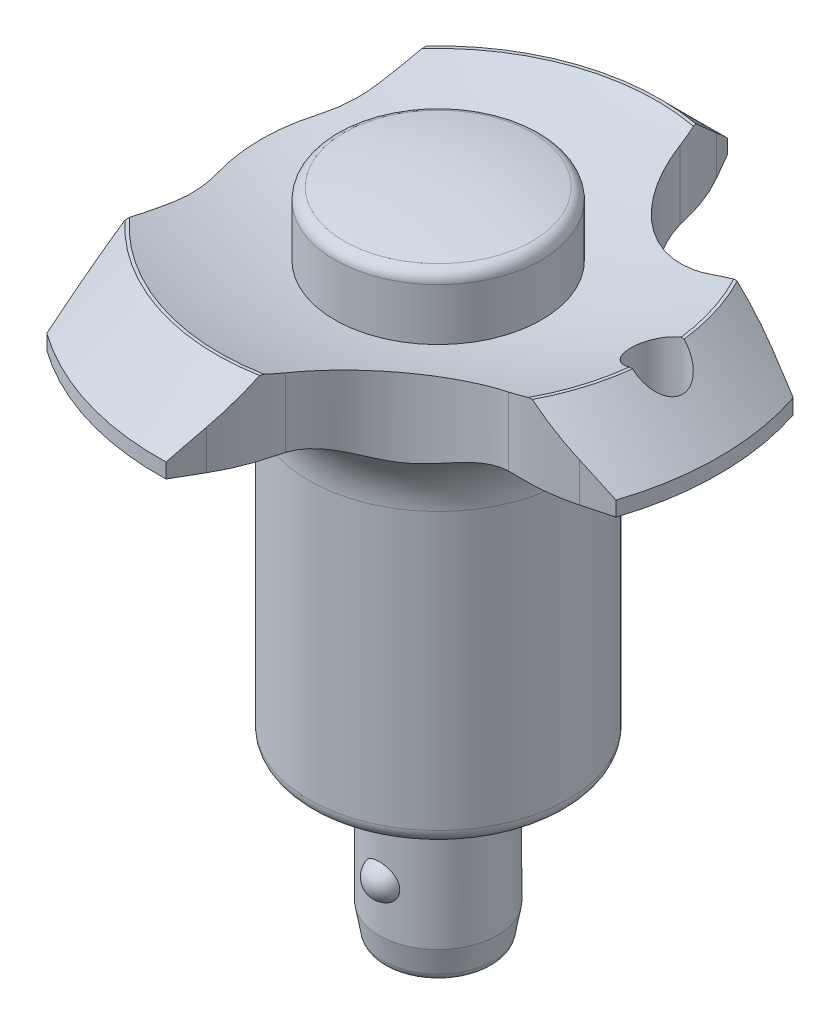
ISO-10303-21;
HEADER;
FILE_DESCRIPTION(('STEP AP214'),'2;1');
FILE_NAME('part.step','',(''),(''),'','','');
FILE_SCHEMA(('AUTOMOTIVE_DESIGN { 1 0 10303 214 1 1 1 1 }'));
ENDSEC;
DATA;
#1=APPLICATION_CONTEXT('core data for automotive mechanical design processes');
#2=APPLICATION_PROTOCOL_DEFINITION('international standard','automotive_design',2000,#1);
#3=PRODUCT_CONTEXT('',#1,'mechanical');
#4=PRODUCT('Part','Part','',(#3));
#5=PRODUCT_RELATED_PRODUCT_CATEGORY('part','',(#4));
#6=PRODUCT_DEFINITION_FORMATION('','',#4);
#7=PRODUCT_DEFINITION_CONTEXT('part definition',#1,'design');
#8=PRODUCT_DEFINITION('design','',#6,#7);
#9=PRODUCT_DEFINITION_SHAPE('','',#8);
#10=(LENGTH_UNIT() NAMED_UNIT(*) SI_UNIT(.MILLI.,.METRE.));
#11=(NAMED_UNIT(*) PLANE_ANGLE_UNIT() SI_UNIT($,.RADIAN.));
#12=(NAMED_UNIT(*) SI_UNIT($,.STERADIAN.) SOLID_ANGLE_UNIT());
#13=UNCERTAINTY_MEASURE_WITH_UNIT(LENGTH_MEASURE(1.E-05),#10,'distance_accuracy_value','');
#14=(GEOMETRIC_REPRESENTATION_CONTEXT(3) GLOBAL_UNCERTAINTY_ASSIGNED_CONTEXT((#13)) GLOBAL_UNIT_ASSIGNED_CONTEXT((#10,
#11,#12)) REPRESENTATION_CONTEXT('',''));
#15=CARTESIAN_POINT('',(0.,0.,0.));
#16=DIRECTION('',(0.,0.,1.));
#17=DIRECTION('',(1.,0.,0.));
#18=AXIS2_PLACEMENT_3D('',#15,#16,#17);
#19=CARTESIAN_POINT('',(0.,33.2,0.));
#20=DIRECTION('',(0.,-1.,0.));
#21=DIRECTION('',(0.,0.,-1.));
#22=AXIS2_PLACEMENT_3D('',#19,#20,#21);
#23=CYLINDRICAL_SURFACE('',#22,7.);
#24=CARTESIAN_POINT('',(0.,31.7572687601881,0.));
#25=DIRECTION('',(0.,-1.,0.));
#26=DIRECTION('',(0.,0.,-1.));
#27=AXIS2_PLACEMENT_3D('',#24,#25,#26);
#28=CIRCLE('',#27,7.);
#29=CARTESIAN_POINT('',(0.,31.7572687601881,-7.));
#30=VERTEX_POINT('',#29);
#31=EDGE_CURVE('P0_E11',#30,#30,#28,.T.);
#32=ORIENTED_EDGE('',*,*,#31,.T.);
#33=EDGE_LOOP('',(#32));
#34=FACE_BOUND('',#33,.T.);
#35=CARTESIAN_POINT('',(0.,15.,0.));
#36=DIRECTION('',(0.,1.,0.));
#37=DIRECTION('',(0.,0.,1.));
#38=AXIS2_PLACEMENT_3D('',#35,#36,#37);
#39=CIRCLE('',#38,7.);
#40=CARTESIAN_POINT('',(0.,15.,7.));
#41=VERTEX_POINT('',#40);
#42=EDGE_CURVE('P0_E48',#41,#41,#39,.T.);
#43=ORIENTED_EDGE('',*,*,#42,.T.);
#44=EDGE_LOOP('',(#43));
#45=FACE_BOUND('',#44,.T.);
#46=ADVANCED_FACE('P0_F16',(#34,#45),#23,.T.);
#47=CARTESIAN_POINT('',(0.,15.,0.));
#48=DIRECTION('',(0.,1.,0.));
#49=DIRECTION('',(0.,0.,1.));
#50=AXIS2_PLACEMENT_3D('',#47,#48,#49);
#51=PLANE('',#50);
#52=ORIENTED_EDGE('',*,*,#42,.F.);
#53=EDGE_LOOP('',(#52));
#54=FACE_BOUND('',#53,.T.);
#55=ADVANCED_FACE('P0_F28',(#54),#51,.F.);
#56=CARTESIAN_POINT('',(0.,2.17499999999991,0.));
#57=DIRECTION('',(0.,1.,0.));
#58=DIRECTION('',(-1.,0.,0.));
#59=AXIS2_PLACEMENT_3D('',#56,#57,#58);
#60=SPHERICAL_SURFACE('',#59,31.0250000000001);
#61=CARTESIAN_POINT('',(0.,32.5402568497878,0.));
#62=DIRECTION('',(0.,-1.,0.));
#63=DIRECTION('',(0.,0.,-1.));
#64=AXIS2_PLACEMENT_3D('',#61,#62,#63);
#65=CIRCLE('',#64,6.36410256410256);
#66=CARTESIAN_POINT('',(0.,32.5402568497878,-6.36410256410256));
#67=VERTEX_POINT('',#66);
#68=EDGE_CURVE('P0_E23',#67,#67,#65,.F.);
#69=ORIENTED_EDGE('',*,*,#68,.T.);
#70=EDGE_LOOP('',(#69));
#71=FACE_BOUND('',#70,.T.);
#72=CARTESIAN_POINT('',(0.,33.2,0.));
#73=VERTEX_POINT('',#72);
#74=VERTEX_LOOP('',#73);
#75=FACE_BOUND('',#74,.T.);
#76=ADVANCED_FACE('P0_F26',(#71,#75),#60,.T.);
#77=CARTESIAN_POINT('',(0.,31.7572687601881,0.));
#78=DIRECTION('',(0.,-1.,0.));
#79=DIRECTION('',(0.,0.,-1.));
#80=AXIS2_PLACEMENT_3D('',#77,#78,#79);
#81=TOROIDAL_SURFACE('',#80,6.2,0.8);
#82=ORIENTED_EDGE('',*,*,#31,.F.);
#83=EDGE_LOOP('',(#82));
#84=FACE_BOUND('',#83,.T.);
#85=ORIENTED_EDGE('',*,*,#68,.F.);
#86=EDGE_LOOP('',(#85));
#87=FACE_BOUND('',#86,.T.);
#88=ADVANCED_FACE('P0_F18',(#84,#87),#81,.T.);
#89=CLOSED_SHELL('',(#46,#55,#76,#88));
#90=MANIFOLD_SOLID_BREP('P0_B1',#89);
#91=CARTESIAN_POINT('',(-19.,30.2,0.));
#92=DIRECTION('',(0.,1.,0.));
#93=DIRECTION('',(-1.,0.,0.));
#94=AXIS2_PLACEMENT_3D('',#91,#92,#93);
#95=PLANE('',#94);
#96=CARTESIAN_POINT('',(0.,30.2,0.));
#97=DIRECTION('',(0.,1.,0.));
#98=DIRECTION('',(-1.,0.,0.));
#99=AXIS2_PLACEMENT_3D('',#96,#97,#98);
#100=CIRCLE('',#99,14.790199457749);
#101=CARTESIAN_POINT('',(14.6866680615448,30.2,-1.74693481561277));
#102=VERTEX_POINT('',#101);
#103=CARTESIAN_POINT('',(13.0598212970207,30.2,-6.94197865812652));
#104=VERTEX_POINT('',#103);
#105=EDGE_CURVE('P1_E287',#102,#104,#100,.T.);
#106=ORIENTED_EDGE('',*,*,#105,.F.);
#107=CARTESIAN_POINT('',(14.790199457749,30.2,0.));
#108=DIRECTION('',(0.,1.,0.));
#109=DIRECTION('',(0.,0.,1.));
#110=AXIS2_PLACEMENT_3D('',#107,#108,#109);
#111=CIRCLE('',#110,1.75);
#112=CARTESIAN_POINT('',(14.8979566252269,30.2,-1.74667924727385));
#113=VERTEX_POINT('',#112);
#114=EDGE_CURVE('P1_E40',#113,#102,#111,.T.);
#115=ORIENTED_EDGE('',*,*,#114,.F.);
#116=CARTESIAN_POINT('',(0.,30.2,0.));
#117=DIRECTION('',(0.,1.,0.));
#118=DIRECTION('',(-1.,0.,0.));
#119=AXIS2_PLACEMENT_3D('',#116,#117,#118);
#120=CIRCLE('',#119,15.);
#121=CARTESIAN_POINT('',(13.300156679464,30.2,-6.93583681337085));
#122=VERTEX_POINT('',#121);
#123=EDGE_CURVE('P1_E231',#113,#122,#120,.T.);
#124=ORIENTED_EDGE('',*,*,#123,.T.);
#125=CARTESIAN_POINT('',(12.8606666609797,30.2,5.55643473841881));
#126=DIRECTION('',(0.,-1.,0.));
#127=DIRECTION('',(0.,0.,-1.));
#128=AXIS2_PLACEMENT_3D('',#125,#126,#127);
#129=CIRCLE('',#128,12.5);
#130=EDGE_CURVE('P1_E520',#104,#122,#129,.T.);
#131=ORIENTED_EDGE('',*,*,#130,.F.);
#132=EDGE_LOOP('',(#106,#115,#124,#131));
#133=FACE_BOUND('',#132,.T.);
#134=ADVANCED_FACE('P1_F16',(#133),#95,.T.);
#135=CARTESIAN_POINT('',(13.3001566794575,30.2,6.9358368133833));
#136=VERTEX_POINT('',#135);
#137=CARTESIAN_POINT('',(14.8979566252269,30.2,1.74667924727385));
#138=VERTEX_POINT('',#137);
#139=EDGE_CURVE('P1_E229',#136,#138,#120,.T.);
#140=ORIENTED_EDGE('',*,*,#139,.T.);
#141=CARTESIAN_POINT('',(14.6866680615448,30.2,1.74693481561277));
#142=VERTEX_POINT('',#141);
#143=EDGE_CURVE('P1_E213',#142,#138,#111,.T.);
#144=ORIENTED_EDGE('',*,*,#143,.F.);
#145=CARTESIAN_POINT('',(13.0598212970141,30.2,6.94197865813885));
#146=VERTEX_POINT('',#145);
#147=EDGE_CURVE('P1_E285',#146,#142,#100,.T.);
#148=ORIENTED_EDGE('',*,*,#147,.F.);
#149=CARTESIAN_POINT('',(12.8606666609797,30.2,-5.55643473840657));
#150=DIRECTION('',(0.,-1.,0.));
#151=DIRECTION('',(0.,0.,1.));
#152=AXIS2_PLACEMENT_3D('',#149,#150,#151);
#153=CIRCLE('',#152,12.5);
#154=EDGE_CURVE('P1_E236',#136,#146,#153,.T.);
#155=ORIENTED_EDGE('',*,*,#154,.F.);
#156=EDGE_LOOP('',(#140,#144,#148,#155));
#157=FACE_BOUND('',#156,.T.);
#158=ADVANCED_FACE('P1_F235',(#157),#95,.T.);
#159=CARTESIAN_POINT('',(-14.25,25.2,0.));
#160=DIRECTION('',(0.,-1.,0.));
#161=DIRECTION('',(1.,0.,0.));
#162=AXIS2_PLACEMENT_3D('',#159,#160,#161);
#163=PLANE('',#162);
#164=CARTESIAN_POINT('',(0.,25.2,0.));
#165=DIRECTION('',(0.,1.,0.));
#166=DIRECTION('',(-1.,0.,0.));
#167=AXIS2_PLACEMENT_3D('',#164,#165,#166);
#168=CIRCLE('',#167,14.25);
#169=CARTESIAN_POINT('',(12.4476557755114,25.2000000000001,6.93674027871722));
#170=VERTEX_POINT('',#169);
#171=CARTESIAN_POINT('',(14.1563337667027,25.2,1.63116960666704));
#172=VERTEX_POINT('',#171);
#173=EDGE_CURVE('P1_E265',#170,#172,#168,.T.);
#174=ORIENTED_EDGE('',*,*,#173,.T.);
#175=CARTESIAN_POINT('',(14.790199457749,25.2,0.));
#176=DIRECTION('',(0.,-1.,0.));
#177=DIRECTION('',(1.,0.,0.));
#178=AXIS2_PLACEMENT_3D('',#175,#176,#177);
#179=CIRCLE('',#178,1.75);
#180=CARTESIAN_POINT('',(14.1563337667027,25.2,-1.63116960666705));
#181=VERTEX_POINT('',#180);
#182=EDGE_CURVE('P1_E32',#172,#181,#179,.F.);
#183=ORIENTED_EDGE('',*,*,#182,.T.);
#184=CARTESIAN_POINT('',(12.4476557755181,25.2,-6.93674027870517));
#185=VERTEX_POINT('',#184);
#186=EDGE_CURVE('P1_E266',#181,#185,#168,.T.);
#187=ORIENTED_EDGE('',*,*,#186,.T.);
#188=CARTESIAN_POINT('',(12.8606666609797,25.2,5.55643473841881));
#189=DIRECTION('',(0.,-1.,0.));
#190=DIRECTION('',(1.,0.,0.));
#191=AXIS2_PLACEMENT_3D('',#188,#189,#190);
#192=CIRCLE('',#191,12.5);
#193=CARTESIAN_POINT('',(16.0959047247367,25.2,-6.51763809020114));
#194=VERTEX_POINT('',#193);
#195=EDGE_CURVE('P1_E1037',#185,#194,#192,.T.);
#196=ORIENTED_EDGE('',*,*,#195,.T.);
#197=DIRECTION('',(0.965925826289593,0.,0.258819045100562));
#198=VECTOR('',#197,1.);
#199=CARTESIAN_POINT('',(-10.5878003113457,25.2,-13.6675153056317));
#200=LINE('',#199,#198);
#201=CARTESIAN_POINT('',(18.0277563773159,25.2,-6.));
#202=VERTEX_POINT('',#201);
#203=EDGE_CURVE('P1_E609',#194,#202,#200,.T.);
#204=ORIENTED_EDGE('',*,*,#203,.T.);
#205=CARTESIAN_POINT('',(0.,25.2,0.));
#206=DIRECTION('',(0.,1.,0.));
#207=DIRECTION('',(-1.,0.,0.));
#208=AXIS2_PLACEMENT_3D('',#205,#206,#207);
#209=CIRCLE('',#208,19.);
#210=CARTESIAN_POINT('',(18.0277563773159,25.2,6.00000000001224));
#211=VERTEX_POINT('',#210);
#212=EDGE_CURVE('P1_E251',#211,#202,#209,.T.);
#213=ORIENTED_EDGE('',*,*,#212,.F.);
#214=DIRECTION('',(-0.965925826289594,0.,0.25881904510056));
#215=VECTOR('',#214,1.);
#216=CARTESIAN_POINT('',(-10.5878003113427,25.2,13.6675153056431));
#217=LINE('',#216,#215);
#218=CARTESIAN_POINT('',(16.0959047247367,25.2,6.51763809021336));
#219=VERTEX_POINT('',#218);
#220=EDGE_CURVE('P1_E512',#211,#219,#217,.T.);
#221=ORIENTED_EDGE('',*,*,#220,.T.);
#222=CARTESIAN_POINT('',(12.8606666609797,25.2,-5.55643473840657));
#223=DIRECTION('',(0.,-1.,0.));
#224=DIRECTION('',(1.,0.,0.));
#225=AXIS2_PLACEMENT_3D('',#222,#223,#224);
#226=CIRCLE('',#225,12.5);
#227=EDGE_CURVE('P1_E679',#219,#170,#226,.T.);
#228=ORIENTED_EDGE('',*,*,#227,.T.);
#229=EDGE_LOOP('',(#174,#183,#187,#196,#204,#213,#221,#228));
#230=FACE_BOUND('',#229,.T.);
#231=ADVANCED_FACE('P1_F733',(#230),#163,.T.);
#232=CARTESIAN_POINT('',(0.,19.7,0.));
#233=DIRECTION('',(0.,1.,0.));
#234=DIRECTION('',(-1.,0.,0.));
#235=AXIS2_PLACEMENT_3D('',#232,#233,#234);
#236=TOROIDAL_SURFACE('',#235,14.25,5.5);
#237=CARTESIAN_POINT('',(0.,19.7,0.));
#238=DIRECTION('',(0.,1.,0.));
#239=DIRECTION('',(-1.,0.,0.));
#240=AXIS2_PLACEMENT_3D('',#237,#238,#239);
#241=CIRCLE('',#240,8.75);
#242=CARTESIAN_POINT('',(-8.75,19.7,0.));
#243=VERTEX_POINT('',#242);
#244=EDGE_CURVE('P1_E274',#243,#243,#241,.T.);
#245=ORIENTED_EDGE('',*,*,#244,.T.);
#246=EDGE_LOOP('',(#245));
#247=FACE_BOUND('',#246,.T.);
#248=ORIENTED_EDGE('',*,*,#186,.F.);
#249=CARTESIAN_POINT('',(14.2502,25.1991429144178,-1.6646022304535));
#250=CARTESIAN_POINT('',(14.2042623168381,25.1999826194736,-1.64970098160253));
#251=CARTESIAN_POINT('',(14.1589561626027,25.2001952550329,-1.63289959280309));
#252=CARTESIAN_POINT('',(14.0699047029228,25.1994597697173,-1.59562095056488));
#253=CARTESIAN_POINT('',(14.0261590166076,25.1985119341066,-1.57514460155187));
#254=CARTESIAN_POINT('',(13.8979419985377,25.1940770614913,-1.5085156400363));
#255=CARTESIAN_POINT('',(13.8162015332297,25.189002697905,-1.4570688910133));
#256=CARTESIAN_POINT('',(13.6625097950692,25.1758106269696,-1.34166462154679));
#257=CARTESIAN_POINT('',(13.5905547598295,25.1676940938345,-1.2777119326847));
#258=CARTESIAN_POINT('',(13.4581285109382,25.1499438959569,-1.13898330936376));
#259=CARTESIAN_POINT('',(13.3976621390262,25.1403095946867,-1.06420283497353));
#260=CARTESIAN_POINT('',(13.2884525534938,25.1209736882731,-0.903822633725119));
#261=CARTESIAN_POINT('',(13.2400286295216,25.1112761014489,-0.818004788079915));
#262=CARTESIAN_POINT('',(13.1581906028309,25.0938088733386,-0.639298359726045));
#263=CARTESIAN_POINT('',(13.1247757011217,25.0860391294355,-0.546410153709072));
#264=CARTESIAN_POINT('',(13.0740128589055,25.0738737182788,-0.356203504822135));
#265=CARTESIAN_POINT('',(13.0566505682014,25.0694750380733,-0.258889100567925));
#266=CARTESIAN_POINT('',(13.0385484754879,25.064883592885,-0.0626413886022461));
#267=CARTESIAN_POINT('',(13.0378045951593,25.0646897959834,0.0362915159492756));
#268=CARTESIAN_POINT('',(13.0527361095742,25.068485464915,0.229974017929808));
#269=CARTESIAN_POINT('',(13.0679443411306,25.0723559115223,0.324762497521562));
#270=CARTESIAN_POINT('',(13.1135594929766,25.0833937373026,0.510409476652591));
#271=CARTESIAN_POINT('',(13.1439686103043,25.0905615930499,0.601267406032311));
#272=CARTESIAN_POINT('',(13.2194330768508,25.1070123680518,0.777474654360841));
#273=CARTESIAN_POINT('',(13.2646222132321,25.1163143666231,0.862764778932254));
#274=CARTESIAN_POINT('',(13.3683648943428,25.1353787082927,1.02476366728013));
#275=CARTESIAN_POINT('',(13.4269226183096,25.1451411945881,1.1014697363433));
#276=CARTESIAN_POINT('',(13.5576641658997,25.1636664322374,1.24624537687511));
#277=CARTESIAN_POINT('',(13.6301729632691,25.1723951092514,1.31402614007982));
#278=CARTESIAN_POINT('',(13.7857547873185,25.1868126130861,1.43644011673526));
#279=CARTESIAN_POINT('',(13.8688152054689,25.1925050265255,1.49108880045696));
#280=CARTESIAN_POINT('',(14.0028942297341,25.1978948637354,1.56381573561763));
#281=CARTESIAN_POINT('',(14.0510697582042,25.1991455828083,1.58715064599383));
#282=CARTESIAN_POINT('',(14.1493071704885,25.2002344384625,1.62929760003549));
#283=CARTESIAN_POINT('',(14.1993667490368,25.200074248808,1.64811497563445));
#284=CARTESIAN_POINT('',(14.2502,25.1991429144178,1.6646022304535));
#285=B_SPLINE_CURVE_WITH_KNOTS('',3,(#249,#250,#251,#252,#253,#254,#255,#256,#257,#258,#259,
#260,#261,#262,#263,#264,#265,#266,#267,#268,#269,#270,#271,#272,#273,#274,#275,#276,#277,#278,
#279,#280,#281,#282,#283,#284),.UNSPECIFIED.,.F.,.F.,(4,2,2,2,2,2,2,2,2,2,2,2,2,2,2,2,2,4),(0.,
0.144809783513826,0.289583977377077,0.578231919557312,0.866768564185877,1.15542654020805,
1.45107354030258,1.74670480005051,2.04207152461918,2.3373657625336,2.6242473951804,
2.91117050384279,3.20076622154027,3.49045259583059,3.78795379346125,4.0851027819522,
4.24551820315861,4.40574334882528),.UNSPECIFIED.);
#286=EDGE_CURVE('P1_E232',#181,#172,#285,.T.);
#287=ORIENTED_EDGE('',*,*,#286,.T.);
#288=ORIENTED_EDGE('',*,*,#173,.F.);
#289=CARTESIAN_POINT('',(14.2502,24.9717309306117,6.86609306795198));
#290=CARTESIAN_POINT('',(14.0793866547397,25.0150346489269,6.88522647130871));
#291=CARTESIAN_POINT('',(13.906667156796,25.0524848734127,6.900953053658));
#292=CARTESIAN_POINT('',(13.5583259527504,25.1151856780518,6.92529634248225));
#293=CARTESIAN_POINT('',(13.3827010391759,25.1404216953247,6.93390457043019));
#294=CARTESIAN_POINT('',(13.0330284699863,25.1777587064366,6.94358053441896));
#295=CARTESIAN_POINT('',(12.8590088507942,25.1900867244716,6.94478048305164));
#296=CARTESIAN_POINT('',(12.5107529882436,25.2018643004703,6.93987786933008));
#297=CARTESIAN_POINT('',(12.3365170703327,25.2013251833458,6.93378173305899));
#298=CARTESIAN_POINT('',(12.0782272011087,25.1906012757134,6.91934094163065));
#299=CARTESIAN_POINT('',(11.9937757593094,25.1855080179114,6.91375527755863));
#300=CARTESIAN_POINT('',(11.824887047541,25.1720758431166,6.90086699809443));
#301=CARTESIAN_POINT('',(11.74045147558,25.1637227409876,6.89355693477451));
#302=CARTESIAN_POINT('',(11.6562800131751,25.1537207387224,6.88540808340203));
#303=B_SPLINE_CURVE_WITH_KNOTS('',3,(#289,#290,#291,#292,#293,#294,#295,#296,#297,#298,#299,
#300,#301,#302),.UNSPECIFIED.,.F.,.F.,(4,2,2,2,2,2,4),(0.,0.5316805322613,1.06399342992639,
1.58677822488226,2.10910291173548,2.36340213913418,2.61882050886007),.UNSPECIFIED.);
#304=CARTESIAN_POINT('',(11.6564800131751,25.1537445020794,6.88542744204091));
#305=VERTEX_POINT('',#304);
#306=EDGE_CURVE('P1_E673',#170,#305,#303,.T.);
#307=ORIENTED_EDGE('',*,*,#306,.T.);
#308=CARTESIAN_POINT('',(11.6566800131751,25.1537682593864,6.88544680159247));
#309=CARTESIAN_POINT('',(11.5594002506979,25.1422170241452,6.87602741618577));
#310=CARTESIAN_POINT('',(11.4622162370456,25.1286218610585,6.8684202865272));
#311=CARTESIAN_POINT('',(11.2682690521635,25.0976778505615,6.85677712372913));
#312=CARTESIAN_POINT('',(11.1715057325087,25.0803304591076,6.85273970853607));
#313=CARTESIAN_POINT('',(10.8826272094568,25.0232534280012,6.8459061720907));
#314=CARTESIAN_POINT('',(10.6913672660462,24.978419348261,6.84833581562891));
#315=CARTESIAN_POINT('',(10.3134871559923,24.8783310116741,6.86648508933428));
#316=CARTESIAN_POINT('',(10.1268470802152,24.8231361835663,6.88213062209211));
#317=CARTESIAN_POINT('',(9.75739324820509,24.7051603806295,6.92601438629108));
#318=CARTESIAN_POINT('',(9.57458205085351,24.6423745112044,6.95426077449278));
#319=CARTESIAN_POINT('',(9.21451205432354,24.5130865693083,7.02261490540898));
#320=CARTESIAN_POINT('',(9.03721777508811,24.4466237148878,7.06261185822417));
#321=CARTESIAN_POINT('',(8.68599997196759,24.3129496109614,7.15446642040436));
#322=CARTESIAN_POINT('',(8.5120767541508,24.2457382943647,7.20632510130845));
#323=CARTESIAN_POINT('',(8.16692767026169,24.1146077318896,7.32220452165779));
#324=CARTESIAN_POINT('',(7.99570322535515,24.0506901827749,7.38623145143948));
#325=CARTESIAN_POINT('',(7.6556057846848,23.9311518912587,7.52704009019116));
#326=CARTESIAN_POINT('',(7.48673142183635,23.8755261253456,7.60381401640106));
#327=CARTESIAN_POINT('',(7.2072473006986,23.794570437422,7.74301998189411));
#328=CARTESIAN_POINT('',(7.09593153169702,23.7653165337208,7.80173499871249));
#329=CARTESIAN_POINT('',(6.87480574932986,23.7149414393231,7.92521803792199));
#330=CARTESIAN_POINT('',(6.76499543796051,23.6938186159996,7.9899848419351));
#331=CARTESIAN_POINT('',(6.54816816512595,23.6613802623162,8.1250385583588));
#332=CARTESIAN_POINT('',(6.4411389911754,23.6500103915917,8.19529247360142));
#333=CARTESIAN_POINT('',(6.23017950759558,23.6378456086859,8.34117425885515));
#334=CARTESIAN_POINT('',(6.12624899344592,23.6370499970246,8.41680177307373));
#335=CARTESIAN_POINT('',(5.92244869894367,23.6461066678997,8.57274294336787));
#336=CARTESIAN_POINT('',(5.82257913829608,23.6559595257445,8.65305685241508));
#337=CARTESIAN_POINT('',(5.62766430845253,23.6854547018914,8.8176065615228));
#338=CARTESIAN_POINT('',(5.53261973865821,23.7050984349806,8.90184292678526));
#339=CARTESIAN_POINT('',(5.25410671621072,23.7768366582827,9.16064349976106));
#340=CARTESIAN_POINT('',(5.07859966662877,23.8416457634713,9.34026674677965));
#341=CARTESIAN_POINT('',(4.76295492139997,23.983991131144,9.69435230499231));
#342=CARTESIAN_POINT('',(4.6210792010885,24.0599787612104,9.86795703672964));
#343=CARTESIAN_POINT('',(4.35338817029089,24.2183718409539,10.2246609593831));
#344=CARTESIAN_POINT('',(4.22759004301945,24.3007840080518,10.4077700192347));
#345=CARTESIAN_POINT('',(3.99189617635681,24.4640334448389,10.783365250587));
#346=CARTESIAN_POINT('',(3.88193483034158,24.5448759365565,10.975808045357));
#347=CARTESIAN_POINT('',(3.67736612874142,24.6990701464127,11.3714451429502));
#348=CARTESIAN_POINT('',(3.58274461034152,24.7724287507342,11.5746292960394));
#349=CARTESIAN_POINT('',(3.4451588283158,24.8787402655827,11.9063480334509));
#350=CARTESIAN_POINT('',(3.39691565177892,24.9159319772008,12.0313525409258));
#351=CARTESIAN_POINT('',(3.30636134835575,24.9847155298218,12.2849736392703));
#352=CARTESIAN_POINT('',(3.26404827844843,25.0163092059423,12.4135890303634));
#353=CARTESIAN_POINT('',(3.18537054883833,25.0730845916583,12.6751677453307));
#354=CARTESIAN_POINT('',(3.14905422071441,25.0982150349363,12.8081569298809));
#355=CARTESIAN_POINT('',(3.08307385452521,25.1407979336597,13.0771429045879));
#356=CARTESIAN_POINT('',(3.05341764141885,25.1582413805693,13.2131430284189));
#357=CARTESIAN_POINT('',(3.02728721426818,25.1713374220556,13.3502980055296));
#358=B_SPLINE_CURVE_WITH_KNOTS('',3,(#308,#309,#310,#311,#312,#313,#314,#315,#316,#317,#318,
#319,#320,#321,#322,#323,#324,#325,#326,#327,#328,#329,#330,#331,#332,#333,#334,#335,#336,#337,
#338,#339,#340,#341,#342,#343,#344,#345,#346,#347,#348,#349,#350,#351,#352,#353,#354,#355,#356,
#357),.UNSPECIFIED.,.F.,.F.,(4,2,2,2,2,2,2,2,2,2,2,2,2,2,2,2,2,2,2,2,2,2,2,2,4),(0.,
0.295159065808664,0.590203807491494,1.17861237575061,1.76374364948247,2.34925424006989,
2.9294124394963,3.50962306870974,4.09012966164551,4.67028311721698,5.05756933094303,
5.44477774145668,5.82981446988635,6.21482572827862,6.5998577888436,6.98494550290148,
7.76013818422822,8.46948591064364,9.17958553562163,9.88665317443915,10.5930642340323,
11.0099916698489,11.4267821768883,11.846783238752,12.2672752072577),.UNSPECIFIED.);
#359=CARTESIAN_POINT('',(3.02732533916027,25.1713182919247,13.3500980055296));
#360=VERTEX_POINT('',#359);
#361=EDGE_CURVE('P1_E505',#305,#360,#358,.T.);
#362=ORIENTED_EDGE('',*,*,#361,.T.);
#363=CARTESIAN_POINT('',(3.02736346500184,25.1712991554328,13.3498980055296));
#364=CARTESIAN_POINT('',(3.01298527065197,25.1785186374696,13.4253331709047));
#365=CARTESIAN_POINT('',(2.99788541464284,25.1843582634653,13.5007611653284));
#366=CARTESIAN_POINT('',(2.96628555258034,25.1933111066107,13.6513637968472));
#367=CARTESIAN_POINT('',(2.9497877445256,25.1964285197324,13.7265386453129));
#368=CARTESIAN_POINT('',(2.91539052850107,25.1999922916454,13.8766301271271));
#369=CARTESIAN_POINT('',(2.8974911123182,25.2004386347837,13.9515467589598));
#370=CARTESIAN_POINT('',(2.86029004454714,25.198702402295,14.1011237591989));
#371=CARTESIAN_POINT('',(2.840986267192,25.19651575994,14.1757835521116));
#372=CARTESIAN_POINT('',(2.82100769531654,25.1930331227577,14.2502));
#373=B_SPLINE_CURVE_WITH_KNOTS('',3,(#363,#364,#365,#366,#367,#368,#369,#370,#371,#372),
.UNSPECIFIED.,.F.,.F.,(4,2,2,2,4),(0.,0.23137741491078,0.462397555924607,0.693419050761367,
0.924797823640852),.UNSPECIFIED.);
#374=CARTESIAN_POINT('',(2.89703894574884,25.2000000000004,13.9524071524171));
#375=VERTEX_POINT('',#374);
#376=EDGE_CURVE('P1_E496',#360,#375,#373,.T.);
#377=ORIENTED_EDGE('',*,*,#376,.T.);
#378=CARTESIAN_POINT('',(-11.,25.2,9.05883546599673));
#379=VERTEX_POINT('',#378);
#380=EDGE_CURVE('P1_E258',#379,#375,#168,.T.);
#381=ORIENTED_EDGE('',*,*,#380,.F.);
#382=CARTESIAN_POINT('',(-11.,24.9921140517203,11.2691840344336));
#383=CARTESIAN_POINT('',(-11.,25.0567843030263,10.9498915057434));
#384=CARTESIAN_POINT('',(-11.,25.1047871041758,10.6273466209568));
#385=CARTESIAN_POINT('',(-11.,25.1717409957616,9.97923980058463));
#386=CARTESIAN_POINT('',(-11.,25.1906796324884,9.65367663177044));
#387=CARTESIAN_POINT('',(-11.,25.2039580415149,8.99956819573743));
#388=CARTESIAN_POINT('',(-11.,25.1981016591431,8.67101974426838));
#389=CARTESIAN_POINT('',(-11.,25.1740146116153,8.17881655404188));
#390=CARTESIAN_POINT('',(-11.,25.1634212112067,8.014726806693));
#391=CARTESIAN_POINT('',(-11.,25.1377182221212,7.68694909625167));
#392=CARTESIAN_POINT('',(-11.,25.122610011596,7.52326102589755));
#393=CARTESIAN_POINT('',(-11.,25.0717669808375,7.03633415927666));
#394=CARTESIAN_POINT('',(-11.,25.0303142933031,6.71369525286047));
#395=CARTESIAN_POINT('',(-11.,24.9367947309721,6.06994764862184));
#396=CARTESIAN_POINT('',(-11.,24.8847251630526,5.74883936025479));
#397=CARTESIAN_POINT('',(-11.,24.7748702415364,5.1068386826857));
#398=CARTESIAN_POINT('',(-11.,24.7170715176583,4.78594864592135));
#399=CARTESIAN_POINT('',(-11.,24.6013192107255,4.14420459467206));
#400=CARTESIAN_POINT('',(-11.,24.5433656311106,3.82335057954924));
#401=CARTESIAN_POINT('',(-11.,24.4336589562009,3.18341475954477));
#402=CARTESIAN_POINT('',(-11.,24.3818564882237,2.86434168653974));
#403=CARTESIAN_POINT('',(-11.,24.2898196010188,2.22446814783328));
#404=CARTESIAN_POINT('',(-11.,24.2495841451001,1.90366783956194));
#405=CARTESIAN_POINT('',(-11.,24.2019503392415,1.42187959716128));
#406=CARTESIAN_POINT('',(-11.,24.1882077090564,1.26151849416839));
#407=CARTESIAN_POINT('',(-11.,24.1653910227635,0.940468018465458));
#408=CARTESIAN_POINT('',(-11.,24.1563167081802,0.779778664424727));
#409=CARTESIAN_POINT('',(-11.,24.143191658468,0.458210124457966));
#410=CARTESIAN_POINT('',(-11.,24.1391403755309,0.297330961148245));
#411=CARTESIAN_POINT('',(-11.,24.1362183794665,-0.0244747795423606));
#412=CARTESIAN_POINT('',(-11.,24.1373476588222,-0.185401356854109));
#413=CARTESIAN_POINT('',(-11.,24.1447228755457,-0.506226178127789));
#414=CARTESIAN_POINT('',(-11.,24.1509398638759,-0.666125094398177));
#415=CARTESIAN_POINT('',(-11.,24.1682055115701,-0.985665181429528));
#416=CARTESIAN_POINT('',(-11.,24.1792544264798,-1.14530633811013));
#417=CARTESIAN_POINT('',(-11.,24.219068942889,-1.62371079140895));
#418=CARTESIAN_POINT('',(-11.,24.2545014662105,-1.94192401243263));
#419=CARTESIAN_POINT('',(-11.,24.3385656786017,-2.57798814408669));
#420=CARTESIAN_POINT('',(-11.,24.3872571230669,-2.89583070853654));
#421=CARTESIAN_POINT('',(-11.,24.4919761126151,-3.5302584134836));
#422=CARTESIAN_POINT('',(-11.,24.548003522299,-3.84684357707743));
#423=CARTESIAN_POINT('',(-11.,24.6620822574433,-4.48207112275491));
#424=CARTESIAN_POINT('',(-11.,24.7201455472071,-4.80071126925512));
#425=CARTESIAN_POINT('',(-11.,24.8324151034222,-5.43871666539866));
#426=CARTESIAN_POINT('',(-11.,24.8866211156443,-5.75808196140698));
#427=CARTESIAN_POINT('',(-11.,24.9859562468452,-6.39733020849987));
#428=CARTESIAN_POINT('',(-11.,25.0311107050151,-6.71720911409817));
#429=CARTESIAN_POINT('',(-11.,25.1077933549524,-7.35857952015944));
#430=CARTESIAN_POINT('',(-11.,25.1393262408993,-7.68007042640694));
#431=CARTESIAN_POINT('',(-11.,25.1697982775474,-8.1171518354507));
#432=CARTESIAN_POINT('',(-11.,25.1766574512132,-8.23220294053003));
#433=CARTESIAN_POINT('',(-11.,25.1878642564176,-8.46246662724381));
#434=CARTESIAN_POINT('',(-11.,25.1922110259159,-8.57767925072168));
#435=CARTESIAN_POINT('',(-11.,25.2011705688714,-8.92329739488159));
#436=CARTESIAN_POINT('',(-11.,25.2017132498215,-9.15382903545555));
#437=CARTESIAN_POINT('',(-11.,25.1903513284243,-9.61413189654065));
#438=CARTESIAN_POINT('',(-11.,25.1784723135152,-9.84390370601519));
#439=CARTESIAN_POINT('',(-11.,25.140740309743,-10.3023467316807));
#440=CARTESIAN_POINT('',(-11.,25.1148864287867,-10.5310178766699));
#441=CARTESIAN_POINT('',(-11.,25.0473132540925,-10.9885778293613));
#442=CARTESIAN_POINT('',(-11.,25.0054249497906,-11.2174421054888));
#443=CARTESIAN_POINT('',(-11.,24.9043006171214,-11.6713763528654));
#444=CARTESIAN_POINT('',(-11.,24.8450629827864,-11.8964459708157));
#445=CARTESIAN_POINT('',(-11.,24.7077839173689,-12.3411322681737));
#446=CARTESIAN_POINT('',(-11.,24.6297189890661,-12.5607417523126));
#447=CARTESIAN_POINT('',(-11.,24.4536618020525,-12.9918183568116));
#448=CARTESIAN_POINT('',(-11.,24.3556774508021,-13.2032886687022));
#449=CARTESIAN_POINT('',(-11.,24.1698924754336,-13.556484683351));
#450=CARTESIAN_POINT('',(-11.,24.0871656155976,-13.7008916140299));
#451=CARTESIAN_POINT('',(-11.,23.9109463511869,-13.9829653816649));
#452=CARTESIAN_POINT('',(-11.,23.8174566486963,-14.1206338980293));
#453=CARTESIAN_POINT('',(-11.,23.6197462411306,-14.3878872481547));
#454=CARTESIAN_POINT('',(-11.,23.5155342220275,-14.5174784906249));
#455=CARTESIAN_POINT('',(-11.,23.2965133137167,-14.7672892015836));
#456=CARTESIAN_POINT('',(-11.,23.1817096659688,-14.887513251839));
#457=CARTESIAN_POINT('',(-11.,22.9406678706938,-15.1183431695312));
#458=CARTESIAN_POINT('',(-11.,22.814331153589,-15.2288464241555));
#459=CARTESIAN_POINT('',(-11.,22.5518429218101,-15.4373981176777));
#460=CARTESIAN_POINT('',(-11.,22.4156964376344,-15.5354528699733));
#461=CARTESIAN_POINT('',(-11.,22.1344061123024,-15.7177182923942));
#462=CARTESIAN_POINT('',(-11.,21.9892620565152,-15.8019286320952));
#463=CARTESIAN_POINT('',(-11.,21.6911496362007,-15.9551204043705));
#464=CARTESIAN_POINT('',(-11.,21.538182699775,-16.0241046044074));
#465=CARTESIAN_POINT('',(-11.,21.2470699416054,-16.1373916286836));
#466=CARTESIAN_POINT('',(-11.,21.1097302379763,-16.1837735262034));
#467=CARTESIAN_POINT('',(-11.,20.8313524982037,-16.2636266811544));
#468=CARTESIAN_POINT('',(-11.,20.6903149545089,-16.2970996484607));
#469=CARTESIAN_POINT('',(-11.,20.405811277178,-16.3506365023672));
#470=CARTESIAN_POINT('',(-11.,20.2623467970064,-16.3707091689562));
#471=CARTESIAN_POINT('',(-11.,19.9741631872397,-16.3971811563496));
#472=CARTESIAN_POINT('',(-11.,19.8294441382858,-16.4035813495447));
#473=CARTESIAN_POINT('',(-11.,19.5542777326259,-16.4026645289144));
#474=CARTESIAN_POINT('',(-11.,19.4238243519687,-16.3966327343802));
#475=CARTESIAN_POINT('',(-11.,19.1638662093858,-16.3734483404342));
#476=CARTESIAN_POINT('',(-11.,19.0343617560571,-16.3562922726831));
#477=CARTESIAN_POINT('',(-11.,18.7773325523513,-16.3110726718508));
#478=CARTESIAN_POINT('',(-11.,18.6498069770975,-16.2830138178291));
#479=CARTESIAN_POINT('',(-11.,18.3975099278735,-16.2163096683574));
#480=CARTESIAN_POINT('',(-11.,18.2727395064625,-16.1776604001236));
#481=CARTESIAN_POINT('',(-11.,18.027459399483,-16.0904491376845));
#482=CARTESIAN_POINT('',(-11.,17.9069305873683,-16.0419409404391));
#483=CARTESIAN_POINT('',(-11.,17.6701345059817,-15.9354155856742));
#484=CARTESIAN_POINT('',(-11.,17.5538687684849,-15.8773950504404));
#485=CARTESIAN_POINT('',(-11.,17.2125645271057,-15.6899905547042));
#486=CARTESIAN_POINT('',(-11.,16.9947530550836,-15.547167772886));
#487=CARTESIAN_POINT('',(-11.,16.5674766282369,-15.2195235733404));
#488=CARTESIAN_POINT('',(-11.,16.3598110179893,-15.0323820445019));
#489=CARTESIAN_POINT('',(-11.,15.9738188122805,-14.6295721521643));
#490=CARTESIAN_POINT('',(-11.,15.7955348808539,-14.4138631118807));
#491=CARTESIAN_POINT('',(-11.,15.5182164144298,-14.0283602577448));
#492=CARTESIAN_POINT('',(-11.,15.4114026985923,-13.8640542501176));
#493=CARTESIAN_POINT('',(-11.,15.2126033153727,-13.5266286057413));
#494=CARTESIAN_POINT('',(-11.,15.1206227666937,-13.3535059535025));
#495=CARTESIAN_POINT('',(-11.,14.9512903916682,-13.0005546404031));
#496=CARTESIAN_POINT('',(-11.,14.8739205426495,-12.8207345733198));
#497=CARTESIAN_POINT('',(-11.,14.7330957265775,-12.4557862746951));
#498=CARTESIAN_POINT('',(-11.,14.669639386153,-12.2706585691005));
#499=CARTESIAN_POINT('',(-11.,14.5325042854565,-11.8193626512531));
#500=CARTESIAN_POINT('',(-11.,14.4653663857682,-11.5511980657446));
#501=CARTESIAN_POINT('',(-11.,14.3550191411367,-11.0098768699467));
#502=CARTESIAN_POINT('',(-11.,14.3118302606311,-10.7367161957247));
#503=CARTESIAN_POINT('',(-11.,14.2466685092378,-10.1861508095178));
#504=CARTESIAN_POINT('',(-11.,14.2248344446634,-9.90873008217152));
#505=CARTESIAN_POINT('',(-11.,14.200147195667,-9.35345519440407));
#506=CARTESIAN_POINT('',(-11.,14.1972707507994,-9.07560198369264));
#507=CARTESIAN_POINT('',(-11.,14.2079234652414,-8.50538399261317));
#508=CARTESIAN_POINT('',(-11.,14.2223389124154,-8.21303845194));
#509=CARTESIAN_POINT('',(-11.,14.2657646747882,-7.62940413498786));
#510=CARTESIAN_POINT('',(-11.,14.2947793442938,-7.33811570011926));
#511=CARTESIAN_POINT('',(-11.,14.3640864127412,-6.75635827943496));
#512=CARTESIAN_POINT('',(-11.,14.4044004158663,-6.46589195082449));
#513=CARTESIAN_POINT('',(-11.,14.4927509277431,-5.88619144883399));
#514=CARTESIAN_POINT('',(-11.,14.5407868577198,-5.59695718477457));
#515=CARTESIAN_POINT('',(-11.,14.6408230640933,-5.01941070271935));
#516=CARTESIAN_POINT('',(-11.,14.692820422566,-4.73109796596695));
#517=CARTESIAN_POINT('',(-11.,14.7968322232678,-4.15446329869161));
#518=CARTESIAN_POINT('',(-11.,14.8488466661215,-3.86614136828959));
#519=CARTESIAN_POINT('',(-11.,14.9485485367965,-3.28921282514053));
#520=CARTESIAN_POINT('',(-11.,14.9962428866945,-3.00060744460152));
#521=CARTESIAN_POINT('',(-11.,15.08301039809,-2.42207235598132));
#522=CARTESIAN_POINT('',(-11.,15.1220839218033,-2.13214270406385));
#523=CARTESIAN_POINT('',(-11.,15.1877312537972,-1.54850674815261));
#524=CARTESIAN_POINT('',(-11.,15.2142043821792,-1.25478867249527));
#525=CARTESIAN_POINT('',(-11.,15.250955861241,-0.666337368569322));
#526=CARTESIAN_POINT('',(-11.,15.26123640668,-0.371604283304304));
#527=CARTESIAN_POINT('',(-11.,15.2642511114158,0.217987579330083));
#528=CARTESIAN_POINT('',(-11.,15.2569833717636,0.512846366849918));
#529=CARTESIAN_POINT('',(-11.,15.2258629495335,1.10168450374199));
#530=CARTESIAN_POINT('',(-11.,15.2020082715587,1.39566374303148));
#531=CARTESIAN_POINT('',(-11.,15.1405496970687,1.98337834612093));
#532=CARTESIAN_POINT('',(-11.,15.102888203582,2.27710744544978));
#533=CARTESIAN_POINT('',(-11.,15.0180025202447,2.8631923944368));
#534=CARTESIAN_POINT('',(-11.,14.9707763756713,3.15554795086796));
#535=CARTESIAN_POINT('',(-11.,14.8712826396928,3.73956613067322));
#536=CARTESIAN_POINT('',(-11.,14.8190118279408,4.03122818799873));
#537=CARTESIAN_POINT('',(-11.,14.713902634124,4.61442779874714));
#538=CARTESIAN_POINT('',(-11.,14.6610642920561,4.90596535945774));
#539=CARTESIAN_POINT('',(-11.,14.5748275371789,5.39900386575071));
#540=CARTESIAN_POINT('',(-11.,14.5404895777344,5.60033768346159));
#541=CARTESIAN_POINT('',(-11.,14.4747988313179,6.00345703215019));
#542=CARTESIAN_POINT('',(-11.,14.4434454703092,6.20524246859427));
#543=CARTESIAN_POINT('',(-11.,14.3850007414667,6.60905235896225));
#544=CARTESIAN_POINT('',(-11.,14.3579014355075,6.81107564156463));
#545=CARTESIAN_POINT('',(-11.,14.3090724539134,7.21577452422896));
#546=CARTESIAN_POINT('',(-11.,14.2873429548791,7.41845014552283));
#547=CARTESIAN_POINT('',(-11.,14.232074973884,8.02591550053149));
#548=CARTESIAN_POINT('',(-11.,14.2082181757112,8.43167372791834));
#549=CARTESIAN_POINT('',(-11.,14.1953179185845,9.24403992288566));
#550=CARTESIAN_POINT('',(-11.,14.2062719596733,9.65064782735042));
#551=CARTESIAN_POINT('',(-11.,14.2565042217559,10.2728500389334));
#552=CARTESIAN_POINT('',(-11.,14.2803170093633,10.4897044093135));
#553=CARTESIAN_POINT('',(-11.,14.3417439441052,10.9213812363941));
#554=CARTESIAN_POINT('',(-11.,14.3793551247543,11.1362041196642));
#555=CARTESIAN_POINT('',(-11.,14.5151208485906,11.7773643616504));
#556=CARTESIAN_POINT('',(-11.,14.6361323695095,12.1992845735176));
#557=CARTESIAN_POINT('',(-11.,14.9237036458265,12.9538158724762));
#558=CARTESIAN_POINT('',(-11.,15.0803198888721,13.2901450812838));
#559=CARTESIAN_POINT('',(-11.,15.3546285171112,13.7715776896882));
#560=CARTESIAN_POINT('',(-11.,15.4525339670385,13.9280947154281));
#561=CARTESIAN_POINT('',(-11.,15.6616620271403,14.2320073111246));
#562=CARTESIAN_POINT('',(-11.,15.7728821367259,14.3794045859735));
#563=CARTESIAN_POINT('',(-11.,15.9868432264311,14.6371402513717));
#564=CARTESIAN_POINT('',(-11.,16.0873843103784,14.7493100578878));
#565=CARTESIAN_POINT('',(-11.,16.2970411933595,14.9653164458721));
#566=CARTESIAN_POINT('',(-11.,16.4061553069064,15.0691546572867));
#567=CARTESIAN_POINT('',(-11.,16.6326933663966,15.2675150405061));
#568=CARTESIAN_POINT('',(-11.,16.7501229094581,15.3620308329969));
#569=CARTESIAN_POINT('',(-11.,16.9926442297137,15.5405531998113));
#570=CARTESIAN_POINT('',(-11.,17.1177322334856,15.6245648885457));
#571=CARTESIAN_POINT('',(-11.,17.3757564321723,15.7816015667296));
#572=CARTESIAN_POINT('',(-11.,17.50873832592,15.8545516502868));
#573=CARTESIAN_POINT('',(-11.,17.7808412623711,15.9877862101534));
#574=CARTESIAN_POINT('',(-11.,17.9199594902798,16.0480764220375));
#575=CARTESIAN_POINT('',(-11.,18.2032644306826,16.1551425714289));
#576=CARTESIAN_POINT('',(-11.,18.3474496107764,16.2019225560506));
#577=CARTESIAN_POINT('',(-11.,18.6396754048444,16.2812716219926));
#578=CARTESIAN_POINT('',(-11.,18.7877155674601,16.3138423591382));
#579=CARTESIAN_POINT('',(-11.,19.0701169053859,16.3615335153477));
#580=CARTESIAN_POINT('',(-11.,19.204225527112,16.3781604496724));
#581=CARTESIAN_POINT('',(-11.,19.4733849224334,16.3994940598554));
#582=CARTESIAN_POINT('',(-11.,19.6084356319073,16.4042015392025));
#583=CARTESIAN_POINT('',(-11.,19.8783792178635,16.4016353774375));
#584=CARTESIAN_POINT('',(-11.,20.0132721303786,16.3943654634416));
#585=CARTESIAN_POINT('',(-11.,20.2818883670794,16.3679469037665));
#586=CARTESIAN_POINT('',(-11.,20.4156117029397,16.3487983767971));
#587=CARTESIAN_POINT('',(-11.,20.6747131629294,16.3000297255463));
#588=CARTESIAN_POINT('',(-11.,20.8001908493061,16.2709359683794));
#589=CARTESIAN_POINT('',(-11.,21.0483588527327,16.2024953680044));
#590=CARTESIAN_POINT('',(-11.,21.1710482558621,16.1631452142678));
#591=CARTESIAN_POINT('',(-11.,21.4128001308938,16.0746424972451));
#592=CARTESIAN_POINT('',(-11.,21.5318634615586,16.0254922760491));
#593=CARTESIAN_POINT('',(-11.,21.7657528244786,15.9178858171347));
#594=CARTESIAN_POINT('',(-11.,21.8805772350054,15.8594260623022));
#595=CARTESIAN_POINT('',(-11.,22.1096769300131,15.7313777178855));
#596=CARTESIAN_POINT('',(-11.,22.2237615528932,15.6614477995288));
#597=CARTESIAN_POINT('',(-11.,22.4461450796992,15.5128978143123));
#598=CARTESIAN_POINT('',(-11.,22.5544418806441,15.4342746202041));
#599=CARTESIAN_POINT('',(-11.,22.8698200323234,15.1865543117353));
#600=CARTESIAN_POINT('',(-11.,23.0676310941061,15.0054694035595));
#601=CARTESIAN_POINT('',(-11.,23.4562962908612,14.5960330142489));
#602=CARTESIAN_POINT('',(-11.,23.6439424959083,14.3646663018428));
#603=CARTESIAN_POINT('',(-11.,23.9849040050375,13.877514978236));
#604=CARTESIAN_POINT('',(-11.,24.1381558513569,13.621686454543));
#605=CARTESIAN_POINT('',(-11.,24.4437796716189,13.0285566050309));
#606=CARTESIAN_POINT('',(-11.,24.5869466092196,12.6865308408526));
#607=CARTESIAN_POINT('',(-11.,24.8244674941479,11.9874225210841));
#608=CARTESIAN_POINT('',(-11.,24.9189557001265,11.6303843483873));
#609=CARTESIAN_POINT('',(-11.,24.9921140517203,11.2691840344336));
#610=B_SPLINE_CURVE_WITH_KNOTS('',3,(#382,#383,#384,#385,#386,#387,#388,#389,#390,#391,#392,
#393,#394,#395,#396,#397,#398,#399,#400,#401,#402,#403,#404,#405,#406,#407,#408,#409,#410,#411,
#412,#413,#414,#415,#416,#417,#418,#419,#420,#421,#422,#423,#424,#425,#426,#427,#428,#429,#430,
#431,#432,#433,#434,#435,#436,#437,#438,#439,#440,#441,#442,#443,#444,#445,#446,#447,#448,#449,
#450,#451,#452,#453,#454,#455,#456,#457,#458,#459,#460,#461,#462,#463,#464,#465,#466,#467,#468,
#469,#470,#471,#472,#473,#474,#475,#476,#477,#478,#479,#480,#481,#482,#483,#484,#485,#486,#487,
#488,#489,#490,#491,#492,#493,#494,#495,#496,#497,#498,#499,#500,#501,#502,#503,#504,#505,#506,
#507,#508,#509,#510,#511,#512,#513,#514,#515,#516,#517,#518,#519,#520,#521,#522,#523,#524,#525,
#526,#527,#528,#529,#530,#531,#532,#533,#534,#535,#536,#537,#538,#539,#540,#541,#542,#543,#544,
#545,#546,#547,#548,#549,#550,#551,#552,#553,#554,#555,#556,#557,#558,#559,#560,#561,#562,#563,
#564,#565,#566,#567,#568,#569,#570,#571,#572,#573,#574,#575,#576,#577,#578,#579,#580,#581,#582,
#583,#584,#585,#586,#587,#588,#589,#590,#591,#592,#593,#594,#595,#596,#597,#598,#599,#600,#601,
#602,#603,#604,#605,#606,#607,#608,#609),.UNSPECIFIED.,.T.,.F.,(4,2,2,2,2,2,2,2,2,2,2,2,2,2,2,2,
2,2,2,2,2,2,2,2,2,2,2,2,2,2,2,2,2,2,2,2,2,2,2,2,2,2,2,2,2,2,2,2,2,2,2,2,2,2,2,2,2,2,2,2,2,2,2,2,
2,2,2,2,2,2,2,2,2,2,2,2,2,2,2,2,2,2,2,2,2,2,2,2,2,2,2,2,2,2,2,2,2,2,2,2,2,2,2,2,2,2,2,2,2,2,2,2,
2,4),(0.,0.976815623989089,1.95404968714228,2.9390290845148,3.43227387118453,3.92536824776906,
4.90094052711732,5.8767605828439,6.85491409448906,7.83304605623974,8.8027031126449,
9.7722732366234,10.2550613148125,10.7378226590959,11.2205313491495,11.7032393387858,
12.1832196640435,12.6632253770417,13.6233298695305,14.5878351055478,15.5523225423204,
16.5239919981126,17.495725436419,18.4646993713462,19.4333391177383,19.7790816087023,
20.1249426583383,20.8162264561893,21.5060890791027,22.1959957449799,22.8933840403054,
23.5908369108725,24.2891647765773,24.9872159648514,25.4860576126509,25.9847742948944,
26.4830901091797,26.981160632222,27.4839791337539,27.9865415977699,28.489116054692,
28.9915990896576,29.4258851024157,29.8601135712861,30.2940572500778,30.7279732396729,
31.1192818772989,31.5107125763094,31.9019754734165,32.2933853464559,32.6827141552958,
33.0721815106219,33.8502776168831,34.6857409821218,35.5224070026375,36.1095976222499,
36.6969904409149,37.2836538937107,37.8702594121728,38.698283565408,39.5270141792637,
40.3610964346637,41.1941551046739,42.071800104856,42.9497070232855,43.8293040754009,
44.708835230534,45.5877246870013,46.4666509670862,47.344143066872,48.2215982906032,
49.105951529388,49.9901848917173,50.8745139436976,51.7589493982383,52.647117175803,
53.5354666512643,54.4243870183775,55.3132451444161,55.9259538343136,56.5385444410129,
57.1499779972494,57.7614316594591,58.9797007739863,60.1978823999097,60.8519467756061,
61.5058706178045,62.8170256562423,63.9253269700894,64.478585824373,65.0317409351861,
65.4832078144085,65.9345861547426,66.3862712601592,66.8377355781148,67.292132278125,
67.7463226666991,68.2003768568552,68.654378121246,69.0592693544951,69.4641332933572,
69.8688712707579,70.2736052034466,70.6595839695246,71.0456874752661,71.4316988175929,
71.8178563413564,72.2188530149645,72.619994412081,73.4214517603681,74.3118469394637,
75.2038716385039,76.3119690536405,77.4169936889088),.UNSPECIFIED.);
#611=CARTESIAN_POINT('',(-11.,25.0560713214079,6.92820323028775));
#612=VERTEX_POINT('',#611);
#613=EDGE_CURVE('P1_E554',#379,#612,#610,.T.);
#614=ORIENTED_EDGE('',*,*,#613,.T.);
#615=CARTESIAN_POINT('',(-11.0000000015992,25.0560961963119,6.92840323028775));
#616=CARTESIAN_POINT('',(-11.0000016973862,25.0375205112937,6.77902194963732));
#617=CARTESIAN_POINT('',(-11.0026732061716,25.0180452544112,6.62978289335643));
#618=CARTESIAN_POINT('',(-11.0133543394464,24.9784592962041,6.33157027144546));
#619=CARTESIAN_POINT('',(-11.0213642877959,24.9583485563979,6.18259672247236));
#620=CARTESIAN_POINT('',(-11.0532604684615,24.8990700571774,5.73800457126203));
#621=CARTESIAN_POINT('',(-11.0850135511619,24.8606847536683,5.44277610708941));
#622=CARTESIAN_POINT('',(-11.1485280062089,24.8111009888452,5.00121455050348));
#623=CARTESIAN_POINT('',(-11.1723663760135,24.7958985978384,4.85415150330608));
#624=CARTESIAN_POINT('',(-11.2253532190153,24.769067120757,4.56065627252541));
#625=CARTESIAN_POINT('',(-11.2545012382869,24.7574377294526,4.41422403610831));
#626=CARTESIAN_POINT('',(-11.3182917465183,24.7384310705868,4.12132175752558));
#627=CARTESIAN_POINT('',(-11.3529670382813,24.7310804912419,3.97485706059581));
#628=CARTESIAN_POINT('',(-11.4089681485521,24.7236838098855,3.75603948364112));
#629=CARTESIAN_POINT('',(-11.4283045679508,24.7218231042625,3.68323096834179));
#630=CARTESIAN_POINT('',(-11.4682967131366,24.7193367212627,3.5379535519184));
#631=CARTESIAN_POINT('',(-11.4889524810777,24.7187110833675,3.46548466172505));
#632=CARTESIAN_POINT('',(-11.5102630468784,24.7187149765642,3.39320566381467));
#633=B_SPLINE_CURVE_WITH_KNOTS('',3,(#615,#616,#617,#618,#619,#620,#621,#622,#623,#624,#625,
#626,#627,#628,#629,#630,#631,#632),.UNSPECIFIED.,.F.,.F.,(4,2,2,2,2,2,2,2,4),(0.,
0.451514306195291,0.903056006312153,1.80027975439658,2.24944035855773,2.69856258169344,
3.15045689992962,3.37650341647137,3.60255715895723),.UNSPECIFIED.);
#634=CARTESIAN_POINT('',(-11.5102040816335,24.7187149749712,3.39340566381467));
#635=VERTEX_POINT('',#634);
#636=EDGE_CURVE('P1_E578',#612,#635,#633,.T.);
#637=ORIENTED_EDGE('',*,*,#636,.T.);
#638=CARTESIAN_POINT('',(0.,24.7187149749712,0.));
#639=DIRECTION('',(0.,-1.,0.));
#640=DIRECTION('',(1.,0.,0.));
#641=AXIS2_PLACEMENT_3D('',#638,#639,#640);
#642=CIRCLE('',#641,12.);
#643=CARTESIAN_POINT('',(-11.5102040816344,24.7187149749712,-3.39340566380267));
#644=VERTEX_POINT('',#643);
#645=EDGE_CURVE('P1_E585',#635,#644,#642,.T.);
#646=ORIENTED_EDGE('',*,*,#645,.T.);
#647=CARTESIAN_POINT('',(-11.5102630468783,24.7187149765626,-3.39320566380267));
#648=CARTESIAN_POINT('',(-11.4889524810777,24.7187110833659,-3.46548466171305));
#649=CARTESIAN_POINT('',(-11.4682967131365,24.7193367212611,-3.53795355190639));
#650=CARTESIAN_POINT('',(-11.4283045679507,24.7218231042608,-3.68323096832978));
#651=CARTESIAN_POINT('',(-11.408968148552,24.7236838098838,-3.7560394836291));
#652=CARTESIAN_POINT('',(-11.3529670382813,24.7310804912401,-3.9748570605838));
#653=CARTESIAN_POINT('',(-11.3182917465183,24.738431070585,-4.12132175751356));
#654=CARTESIAN_POINT('',(-11.2545012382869,24.7574377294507,-4.41422403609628));
#655=CARTESIAN_POINT('',(-11.2253532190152,24.7690671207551,-4.56065627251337));
#656=CARTESIAN_POINT('',(-11.1723663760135,24.7958985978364,-4.85415150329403));
#657=CARTESIAN_POINT('',(-11.1485280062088,24.8111009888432,-5.00121455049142));
#658=CARTESIAN_POINT('',(-11.0850135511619,24.8606847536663,-5.44277610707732));
#659=CARTESIAN_POINT('',(-11.0532604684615,24.8990700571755,-5.73800457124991));
#660=CARTESIAN_POINT('',(-11.0213642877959,24.9583485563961,-6.1825967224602));
#661=CARTESIAN_POINT('',(-11.0133543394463,24.9784592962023,-6.33157027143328));
#662=CARTESIAN_POINT('',(-11.0026732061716,25.0180452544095,-6.62978289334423));
#663=CARTESIAN_POINT('',(-11.0000016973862,25.0375205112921,-6.7790219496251));
#664=CARTESIAN_POINT('',(-11.0000000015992,25.0560961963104,-6.9284032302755));
#665=B_SPLINE_CURVE_WITH_KNOTS('',3,(#647,#648,#649,#650,#651,#652,#653,#654,#655,#656,#657,
#658,#659,#660,#661,#662,#663,#664),.UNSPECIFIED.,.F.,.F.,(4,2,2,2,2,2,2,2,4),(0.,
0.226053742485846,0.452100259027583,0.903994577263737,1.35311680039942,1.80227740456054,
2.69950115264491,3.15104285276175,3.60255715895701),.UNSPECIFIED.);
#666=CARTESIAN_POINT('',(-11.,25.0560713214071,-6.9282032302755));
#667=VERTEX_POINT('',#666);
#668=EDGE_CURVE('P1_E290',#644,#667,#665,.T.);
#669=ORIENTED_EDGE('',*,*,#668,.T.);
#670=CARTESIAN_POINT('',(-11.,24.9921140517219,-11.2691840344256));
#671=CARTESIAN_POINT('',(-11.,24.9457569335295,-11.4980676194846));
#672=CARTESIAN_POINT('',(-11.,24.8908440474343,-11.7252300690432));
#673=CARTESIAN_POINT('',(-11.,24.7625053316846,-12.17419026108));
#674=CARTESIAN_POINT('',(-11.,24.6890897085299,-12.39599088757));
#675=CARTESIAN_POINT('',(-11.,24.5221989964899,-12.8328577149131));
#676=CARTESIAN_POINT('',(-11.,24.4286543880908,-13.047897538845));
#677=CARTESIAN_POINT('',(-11.,24.2207033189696,-13.4676425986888));
#678=CARTESIAN_POINT('',(-11.,24.1063061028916,-13.6723523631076));
#679=CARTESIAN_POINT('',(-11.,23.8961461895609,-14.0049562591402));
#680=CARTESIAN_POINT('',(-11.,23.8061119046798,-14.1364917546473));
#681=CARTESIAN_POINT('',(-11.,23.616143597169,-14.392191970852));
#682=CARTESIAN_POINT('',(-11.,23.5162121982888,-14.5163586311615));
#683=CARTESIAN_POINT('',(-11.,23.3067010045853,-14.7559980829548));
#684=CARTESIAN_POINT('',(-11.,23.1971340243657,-14.8714820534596));
#685=CARTESIAN_POINT('',(-11.,22.9685945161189,-15.0926468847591));
#686=CARTESIAN_POINT('',(-11.,22.8496265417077,-15.1983324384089));
#687=CARTESIAN_POINT('',(-11.,22.6016618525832,-15.3995724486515));
#688=CARTESIAN_POINT('',(-11.,22.4725868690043,-15.4950307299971));
#689=CARTESIAN_POINT('',(-11.,22.2061260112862,-15.673425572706));
#690=CARTESIAN_POINT('',(-11.,22.0687442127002,-15.7563682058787));
#691=CARTESIAN_POINT('',(-11.,21.7865577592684,-15.9085843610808));
#692=CARTESIAN_POINT('',(-11.,21.6417517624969,-15.9778554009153));
#693=CARTESIAN_POINT('',(-11.,21.3459526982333,-16.1016039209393));
#694=CARTESIAN_POINT('',(-11.,21.194960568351,-16.1560836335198));
#695=CARTESIAN_POINT('',(-11.,20.9071439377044,-16.2435849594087));
#696=CARTESIAN_POINT('',(-11.,20.7708698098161,-16.2784247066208));
#697=CARTESIAN_POINT('',(-11.,20.4957225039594,-16.3355713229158));
#698=CARTESIAN_POINT('',(-11.,20.3568496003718,-16.3578795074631));
#699=CARTESIAN_POINT('',(-11.,20.0777210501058,-16.3896449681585));
#700=CARTESIAN_POINT('',(-11.,19.9374662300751,-16.3991095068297));
#701=CARTESIAN_POINT('',(-11.,19.656682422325,-16.4050767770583));
#702=CARTESIAN_POINT('',(-11.,19.5161534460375,-16.4015800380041));
#703=CARTESIAN_POINT('',(-11.,19.2469930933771,-16.3824578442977));
#704=CARTESIAN_POINT('',(-11.,19.1182915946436,-16.3678033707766));
#705=CARTESIAN_POINT('',(-11.,18.8625397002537,-16.3276989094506));
#706=CARTESIAN_POINT('',(-11.,18.7354898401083,-16.3022455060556));
#707=CARTESIAN_POINT('',(-11.,18.4839996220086,-16.2408507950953));
#708=CARTESIAN_POINT('',(-11.,18.3595584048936,-16.2049130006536));
#709=CARTESIAN_POINT('',(-11.,18.1140022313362,-16.1229407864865));
#710=CARTESIAN_POINT('',(-11.,17.9928885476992,-16.076902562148));
#711=CARTESIAN_POINT('',(-11.,17.7534210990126,-15.9746622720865));
#712=CARTESIAN_POINT('',(-11.,17.6351134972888,-15.9183520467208));
#713=CARTESIAN_POINT('',(-11.,17.4033238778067,-15.7965182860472));
#714=CARTESIAN_POINT('',(-11.,17.2898436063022,-15.7309914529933));
#715=CARTESIAN_POINT('',(-11.,16.957655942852,-15.5216176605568));
#716=CARTESIAN_POINT('',(-11.,16.7469352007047,-15.3648620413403));
#717=CARTESIAN_POINT('',(-11.,16.3331427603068,-15.0077586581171));
#718=CARTESIAN_POINT('',(-11.,16.1323510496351,-14.8047976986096));
#719=CARTESIAN_POINT('',(-11.,15.7618900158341,-14.371759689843));
#720=CARTESIAN_POINT('',(-11.,15.5922754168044,-14.141636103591));
#721=CARTESIAN_POINT('',(-11.,15.328022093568,-13.7286856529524));
#722=CARTESIAN_POINT('',(-11.,15.2256941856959,-13.5506829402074));
#723=CARTESIAN_POINT('',(-11.,15.0370895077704,-13.1862961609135));
#724=CARTESIAN_POINT('',(-11.,14.9508183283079,-12.9999092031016));
#725=CARTESIAN_POINT('',(-11.,14.7939632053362,-12.6211292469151));
#726=CARTESIAN_POINT('',(-11.,14.7233482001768,-12.4287490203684));
#727=CARTESIAN_POINT('',(-11.,14.5968014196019,-12.0392643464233));
#728=CARTESIAN_POINT('',(-11.,14.5408694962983,-11.8421599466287));
#729=CARTESIAN_POINT('',(-11.,14.4201946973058,-11.3530346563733));
#730=CARTESIAN_POINT('',(-11.,14.3632442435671,-11.0590802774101));
#731=CARTESIAN_POINT('',(-11.,14.2755590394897,-10.4672921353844));
#732=CARTESIAN_POINT('',(-11.,14.2448377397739,-10.1694564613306));
#733=CARTESIAN_POINT('',(-11.,14.2061265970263,-9.57021366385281));
#734=CARTESIAN_POINT('',(-11.,14.1983022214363,-9.2687962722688));
#735=CARTESIAN_POINT('',(-11.,14.2013060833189,-8.81681702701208));
#736=CARTESIAN_POINT('',(-11.,14.2047665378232,-8.66614798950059));
#737=CARTESIAN_POINT('',(-11.,14.2161509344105,-8.36503238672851));
#738=CARTESIAN_POINT('',(-11.,14.2240732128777,-8.21458575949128));
#739=CARTESIAN_POINT('',(-11.,14.2545912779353,-7.75256728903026));
#740=CARTESIAN_POINT('',(-11.,14.2838090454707,-7.44142878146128));
#741=CARTESIAN_POINT('',(-11.,14.3554051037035,-6.82065099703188));
#742=CARTESIAN_POINT('',(-11.,14.3977875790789,-6.51101222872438));
#743=CARTESIAN_POINT('',(-11.,14.4915738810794,-5.89231944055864));
#744=CARTESIAN_POINT('',(-11.,14.5430008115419,-5.5832690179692));
#745=CARTESIAN_POINT('',(-11.,14.6502529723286,-4.96597868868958));
#746=CARTESIAN_POINT('',(-11.,14.7060779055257,-4.6577387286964));
#747=CARTESIAN_POINT('',(-11.,14.8168556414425,-4.04328609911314));
#748=CARTESIAN_POINT('',(-11.,14.8718118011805,-3.73707405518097));
#749=CARTESIAN_POINT('',(-11.,14.9761002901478,-3.12364936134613));
#750=CARTESIAN_POINT('',(-11.,15.0254324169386,-2.81643667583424));
#751=CARTESIAN_POINT('',(-11.,15.1130261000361,-2.20159636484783));
#752=CARTESIAN_POINT('',(-11.,15.1513300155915,-1.89397501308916));
#753=CARTESIAN_POINT('',(-11.,15.2123990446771,-1.27718555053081));
#754=CARTESIAN_POINT('',(-11.,15.235167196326,-0.968017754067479));
#755=CARTESIAN_POINT('',(-11.,15.2620336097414,-0.348179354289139));
#756=CARTESIAN_POINT('',(-11.,15.2660924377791,-0.0375069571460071));
#757=CARTESIAN_POINT('',(-11.,15.2548302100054,0.583489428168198));
#758=CARTESIAN_POINT('',(-11.,15.2395078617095,0.893813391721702));
#759=CARTESIAN_POINT('',(-11.,15.1916191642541,1.51408899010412));
#760=CARTESIAN_POINT('',(-11.,15.1589964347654,1.82403606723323));
#761=CARTESIAN_POINT('',(-11.,15.0807611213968,2.44225760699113));
#762=CARTESIAN_POINT('',(-11.,15.035146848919,2.7505318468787));
#763=CARTESIAN_POINT('',(-11.,14.9357125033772,3.36836778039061));
#764=CARTESIAN_POINT('',(-11.,14.8818266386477,3.67791849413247));
#765=CARTESIAN_POINT('',(-11.,14.7715309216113,4.29655945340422));
#766=CARTESIAN_POINT('',(-11.,14.715121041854,4.60564969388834));
#767=CARTESIAN_POINT('',(-11.,14.6049519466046,5.22379621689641));
#768=CARTESIAN_POINT('',(-11.,14.5511885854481,5.53285174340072));
#769=CARTESIAN_POINT('',(-11.,14.450911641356,6.15212878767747));
#770=CARTESIAN_POINT('',(-11.,14.4043967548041,6.46235008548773));
#771=CARTESIAN_POINT('',(-11.,14.3451306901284,6.91520870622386));
#772=CARTESIAN_POINT('',(-11.,14.3277739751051,7.05724146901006));
#773=CARTESIAN_POINT('',(-11.,14.2958764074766,7.3416654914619));
#774=CARTESIAN_POINT('',(-11.,14.2813363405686,7.48405683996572));
#775=CARTESIAN_POINT('',(-11.,14.2554979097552,7.76889550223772));
#776=CARTESIAN_POINT('',(-11.,14.2441941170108,7.91134231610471));
#777=CARTESIAN_POINT('',(-11.,14.2251860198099,8.19646392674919));
#778=CARTESIAN_POINT('',(-11.,14.217481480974,8.33913870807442));
#779=CARTESIAN_POINT('',(-11.,14.2003700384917,8.76681920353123));
#780=CARTESIAN_POINT('',(-11.,14.1969057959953,9.05210085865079));
#781=CARTESIAN_POINT('',(-11.,14.2088952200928,9.62242024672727));
#782=CARTESIAN_POINT('',(-11.,14.2243545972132,9.90745788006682));
#783=CARTESIAN_POINT('',(-11.,14.2729063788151,10.4296028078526));
#784=CARTESIAN_POINT('',(-11.,14.3027435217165,10.667008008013));
#785=CARTESIAN_POINT('',(-11.,14.379506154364,11.1390282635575));
#786=CARTESIAN_POINT('',(-11.,14.4264271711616,11.3736440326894));
#787=CARTESIAN_POINT('',(-11.,14.5390768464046,11.8388631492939));
#788=CARTESIAN_POINT('',(-11.,14.6048432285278,12.0694574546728));
#789=CARTESIAN_POINT('',(-11.,14.7565960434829,12.5239051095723));
#790=CARTESIAN_POINT('',(-11.,14.8425759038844,12.7477606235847));
#791=CARTESIAN_POINT('',(-11.,15.0096548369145,13.1264999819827));
#792=CARTESIAN_POINT('',(-11.,15.0857385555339,13.2836053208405));
#793=CARTESIAN_POINT('',(-11.,15.2495757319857,13.5915956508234));
#794=CARTESIAN_POINT('',(-11.,15.3373263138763,13.7424821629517));
#795=CARTESIAN_POINT('',(-11.,15.5245171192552,14.0364330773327));
#796=CARTESIAN_POINT('',(-11.,15.6239344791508,14.1795119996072));
#797=CARTESIAN_POINT('',(-11.,15.8346028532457,14.4566901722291));
#798=CARTESIAN_POINT('',(-11.,15.9458523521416,14.5907905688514));
#799=CARTESIAN_POINT('',(-11.,16.162417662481,14.8291295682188));
#800=CARTESIAN_POINT('',(-11.,16.2661245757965,14.9348317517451));
#801=CARTESIAN_POINT('',(-11.,16.481687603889,15.1376394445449));
#802=CARTESIAN_POINT('',(-11.,16.5935451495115,15.234743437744));
#803=CARTESIAN_POINT('',(-11.,16.8249968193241,15.4193345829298));
#804=CARTESIAN_POINT('',(-11.,16.9445930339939,15.5068191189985));
#805=CARTESIAN_POINT('',(-11.,17.1908938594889,15.6711270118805));
#806=CARTESIAN_POINT('',(-11.,17.3175976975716,15.7479515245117));
#807=CARTESIAN_POINT('',(-11.,17.5781219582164,15.8904037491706));
#808=CARTESIAN_POINT('',(-11.,17.7119794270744,15.9559638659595));
#809=CARTESIAN_POINT('',(-11.,17.9851245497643,16.0744225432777));
#810=CARTESIAN_POINT('',(-11.,18.1244097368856,16.1273267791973));
#811=CARTESIAN_POINT('',(-11.,18.4073252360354,16.2197381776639));
#812=CARTESIAN_POINT('',(-11.,18.5509544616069,16.2592486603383));
#813=CARTESIAN_POINT('',(-11.,18.8413404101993,16.32429043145));
#814=CARTESIAN_POINT('',(-11.,18.9880968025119,16.3498231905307));
#815=CARTESIAN_POINT('',(-11.,19.2682456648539,16.3846369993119));
#816=CARTESIAN_POINT('',(-11.,19.4014661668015,16.3953155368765));
#817=CARTESIAN_POINT('',(-11.,19.668378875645,16.404966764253));
#818=CARTESIAN_POINT('',(-11.,19.8020712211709,16.4039356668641));
#819=CARTESIAN_POINT('',(-11.,20.0687631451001,16.3901748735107));
#820=CARTESIAN_POINT('',(-11.,20.2017631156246,16.3774527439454));
#821=CARTESIAN_POINT('',(-11.,20.4661993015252,16.3404760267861));
#822=CARTESIAN_POINT('',(-11.,20.5976349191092,16.3162171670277));
#823=CARTESIAN_POINT('',(-11.,20.8532660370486,16.2575395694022));
#824=CARTESIAN_POINT('',(-11.,20.9775523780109,16.2235151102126));
#825=CARTESIAN_POINT('',(-11.,21.2229631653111,16.1453975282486));
#826=CARTESIAN_POINT('',(-11.,21.3440864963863,16.1013009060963));
#827=CARTESIAN_POINT('',(-11.,21.5823659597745,16.0035364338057));
#828=CARTESIAN_POINT('',(-11.,21.6995230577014,15.9498709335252));
#829=CARTESIAN_POINT('',(-11.,21.929301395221,15.8334965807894));
#830=CARTESIAN_POINT('',(-11.,22.0419209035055,15.770784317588));
#831=CARTESIAN_POINT('',(-11.,22.2672714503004,15.6337522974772));
#832=CARTESIAN_POINT('',(-11.,22.3797533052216,15.5590224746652));
#833=CARTESIAN_POINT('',(-11.,22.5986003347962,15.4010607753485));
#834=CARTESIAN_POINT('',(-11.,22.7049632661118,15.3178258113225));
#835=CARTESIAN_POINT('',(-11.,23.0141300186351,15.0565831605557));
#836=CARTESIAN_POINT('',(-11.,23.2072230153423,14.8669075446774));
#837=CARTESIAN_POINT('',(-11.,23.5865260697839,14.4387502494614));
#838=CARTESIAN_POINT('',(-11.,23.7691733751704,14.1971460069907));
#839=CARTESIAN_POINT('',(-11.,24.0990041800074,13.6904644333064));
#840=CARTESIAN_POINT('',(-11.,24.2461291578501,13.4253493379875));
#841=CARTESIAN_POINT('',(-11.,24.4753780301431,12.9428045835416));
#842=CARTESIAN_POINT('',(-11.,24.5646577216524,12.7287026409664));
#843=CARTESIAN_POINT('',(-11.,24.7239556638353,12.2933745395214));
#844=CARTESIAN_POINT('',(-11.,24.7939659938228,12.0721454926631));
#845=CARTESIAN_POINT('',(-11.,24.9158178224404,11.6251491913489));
#846=CARTESIAN_POINT('',(-11.,24.9676863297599,11.3993892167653));
#847=CARTESIAN_POINT('',(-11.,25.0548221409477,10.9447367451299));
#848=CARTESIAN_POINT('',(-11.,25.0900889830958,10.7158441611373));
#849=CARTESIAN_POINT('',(-11.,25.1633202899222,10.1087912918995));
#850=CARTESIAN_POINT('',(-11.,25.1885013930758,9.72907286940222));
#851=CARTESIAN_POINT('',(-11.,25.2051903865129,8.96905756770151));
#852=CARTESIAN_POINT('',(-11.,25.1966860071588,8.58876052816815));
#853=CARTESIAN_POINT('',(-11.,25.1530755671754,7.82759344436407));
#854=CARTESIAN_POINT('',(-11.,25.1178139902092,7.44673309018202));
#855=CARTESIAN_POINT('',(-11.,25.050444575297,6.87698164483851));
#856=CARTESIAN_POINT('',(-11.,25.0255495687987,6.68716996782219));
#857=CARTESIAN_POINT('',(-11.,24.9719097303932,6.30811314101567));
#858=CARTESIAN_POINT('',(-11.,24.9431653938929,6.11886792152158));
#859=CARTESIAN_POINT('',(-11.,24.8766469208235,5.70212044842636));
#860=CARTESIAN_POINT('',(-11.,24.8382292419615,5.47472261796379));
#861=CARTESIAN_POINT('',(-11.,24.759088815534,5.02032691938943));
#862=CARTESIAN_POINT('',(-11.,24.7183659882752,4.79332906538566));
#863=CARTESIAN_POINT('',(-11.,24.6365289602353,4.33926514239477));
#864=CARTESIAN_POINT('',(-11.,24.5954145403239,4.11219911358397));
#865=CARTESIAN_POINT('',(-11.,24.5148670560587,3.65775962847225));
#866=CARTESIAN_POINT('',(-11.,24.4754340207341,3.43038616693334));
#867=CARTESIAN_POINT('',(-11.,24.400645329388,2.9765825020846));
#868=CARTESIAN_POINT('',(-11.,24.3652632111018,2.75015674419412));
#869=CARTESIAN_POINT('',(-11.,24.3003614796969,2.29647325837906));
#870=CARTESIAN_POINT('',(-11.,24.2708412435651,2.0692156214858));
#871=CARTESIAN_POINT('',(-11.,24.2196383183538,1.61405414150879));
#872=CARTESIAN_POINT('',(-11.,24.1979469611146,1.38615129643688));
#873=CARTESIAN_POINT('',(-11.,24.1639361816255,0.92963879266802));
#874=CARTESIAN_POINT('',(-11.,24.1516163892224,0.701029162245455));
#875=CARTESIAN_POINT('',(-11.,24.1372814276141,0.242512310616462));
#876=CARTESIAN_POINT('',(-11.,24.1353099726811,0.0126036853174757));
#877=CARTESIAN_POINT('',(-11.,24.1419499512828,-0.447059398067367));
#878=CARTESIAN_POINT('',(-11.,24.1505615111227,-0.676813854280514));
#879=CARTESIAN_POINT('',(-11.,24.1776900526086,-1.13593138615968));
#880=CARTESIAN_POINT('',(-11.,24.1962160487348,-1.36529391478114));
#881=CARTESIAN_POINT('',(-11.,24.2417718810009,-1.82316264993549));
#882=CARTESIAN_POINT('',(-11.,24.2688020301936,-2.05166882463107));
#883=CARTESIAN_POINT('',(-11.,24.3603184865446,-2.73924776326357));
#884=CARTESIAN_POINT('',(-11.,24.4349751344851,-3.19692582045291));
#885=CARTESIAN_POINT('',(-11.,24.5542308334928,-3.88199004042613));
#886=CARTESIAN_POINT('',(-11.,24.5951917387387,-4.11008845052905));
#887=CARTESIAN_POINT('',(-11.,24.6774216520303,-4.56623536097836));
#888=CARTESIAN_POINT('',(-11.,24.7186906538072,-4.79428386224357));
#889=CARTESIAN_POINT('',(-11.,24.8052077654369,-5.28271132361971));
#890=CARTESIAN_POINT('',(-11.,24.8502014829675,-5.54313599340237));
#891=CARTESIAN_POINT('',(-11.,24.9351866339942,-6.06481093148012));
#892=CARTESIAN_POINT('',(-11.,24.9751781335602,-6.32606118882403));
#893=CARTESIAN_POINT('',(-11.,25.0474380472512,-6.84911252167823));
#894=CARTESIAN_POINT('',(-11.,25.0797224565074,-7.11091129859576));
#895=CARTESIAN_POINT('',(-11.,25.1341547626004,-7.63552557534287));
#896=CARTESIAN_POINT('',(-11.,25.1563027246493,-7.89834106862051));
#897=CARTESIAN_POINT('',(-11.,25.2034088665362,-8.68122745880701));
#898=CARTESIAN_POINT('',(-11.,25.2101349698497,-9.20280353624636));
#899=CARTESIAN_POINT('',(-11.,25.1695872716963,-9.98223824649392));
#900=CARTESIAN_POINT('',(-11.,25.1476478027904,-10.2414747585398));
#901=CARTESIAN_POINT('',(-11.,25.0847029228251,-10.7575787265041));
#902=CARTESIAN_POINT('',(-11.,25.0437073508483,-11.0144473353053));
#903=CARTESIAN_POINT('',(-11.,24.9921140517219,-11.2691840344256));
#904=B_SPLINE_CURVE_WITH_KNOTS('',3,(#670,#671,#672,#673,#674,#675,#676,#677,#678,#679,#680,
#681,#682,#683,#684,#685,#686,#687,#688,#689,#690,#691,#692,#693,#694,#695,#696,#697,#698,#699,
#700,#701,#702,#703,#704,#705,#706,#707,#708,#709,#710,#711,#712,#713,#714,#715,#716,#717,#718,
#719,#720,#721,#722,#723,#724,#725,#726,#727,#728,#729,#730,#731,#732,#733,#734,#735,#736,#737,
#738,#739,#740,#741,#742,#743,#744,#745,#746,#747,#748,#749,#750,#751,#752,#753,#754,#755,#756,
#757,#758,#759,#760,#761,#762,#763,#764,#765,#766,#767,#768,#769,#770,#771,#772,#773,#774,#775,
#776,#777,#778,#779,#780,#781,#782,#783,#784,#785,#786,#787,#788,#789,#790,#791,#792,#793,#794,
#795,#796,#797,#798,#799,#800,#801,#802,#803,#804,#805,#806,#807,#808,#809,#810,#811,#812,#813,
#814,#815,#816,#817,#818,#819,#820,#821,#822,#823,#824,#825,#826,#827,#828,#829,#830,#831,#832,
#833,#834,#835,#836,#837,#838,#839,#840,#841,#842,#843,#844,#845,#846,#847,#848,#849,#850,#851,
#852,#853,#854,#855,#856,#857,#858,#859,#860,#861,#862,#863,#864,#865,#866,#867,#868,#869,#870,
#871,#872,#873,#874,#875,#876,#877,#878,#879,#880,#881,#882,#883,#884,#885,#886,#887,#888,#889,
#890,#891,#892,#893,#894,#895,#896,#897,#898,#899,#900,#901,#902,#903),.UNSPECIFIED.,.T.,.F.,(4,
2,2,2,2,2,2,2,2,2,2,2,2,2,2,2,2,2,2,2,2,2,2,2,2,2,2,2,2,2,2,2,2,2,2,2,2,2,2,2,2,2,2,2,2,2,2,2,2,
2,2,2,2,2,2,2,2,2,2,2,2,2,2,2,2,2,2,2,2,2,2,2,2,2,2,2,2,2,2,2,2,2,2,2,2,2,2,2,2,2,2,2,2,2,2,2,2,
2,2,2,2,2,2,2,2,2,2,2,2,2,2,2,2,2,2,2,4),(0.,0.700411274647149,1.4004370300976,2.10292042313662,
2.80509313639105,3.28286437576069,3.76050929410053,4.2375283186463,4.7143176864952,
5.19525653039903,5.67596129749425,6.15675326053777,6.63747261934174,7.05888335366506,
7.48024984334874,7.90137796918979,8.3224888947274,8.71063133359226,9.09889662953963,
9.4870319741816,9.87531377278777,10.2679485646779,10.6607242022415,11.4454138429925,
12.2987173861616,13.1535046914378,13.7686841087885,14.3840773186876,14.9982384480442,
15.6123933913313,16.5092073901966,17.406481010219,18.3102230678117,18.7622968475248,
19.2142021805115,20.1513010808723,21.0886981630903,22.0285255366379,22.9682894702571,
23.9015950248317,24.8349341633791,25.7646390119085,26.6941619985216,27.6256432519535,
28.5571866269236,29.4917846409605,30.426504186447,31.3690856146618,32.3116772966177,
33.2527421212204,34.1936375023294,34.6228819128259,35.0522458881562,35.4808853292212,
35.909496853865,36.7648543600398,37.6204700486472,38.3377407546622,39.0548237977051,
39.7733524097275,40.4916477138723,41.0148791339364,41.5379818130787,42.0600759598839,
42.5821033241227,43.0259058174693,43.4697864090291,43.9137874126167,44.35774023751,
44.8042705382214,45.2506002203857,45.6968191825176,46.1429911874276,46.5434329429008,
46.9440042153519,47.3443164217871,47.7447769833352,48.1309191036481,48.517195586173,
48.9033773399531,49.2897050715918,49.6943973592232,50.0992370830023,50.9081799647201,
51.8135292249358,52.720359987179,53.4153553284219,54.1106359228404,54.8048769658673,
55.4991373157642,56.6387786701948,57.7788351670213,58.9255690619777,59.4998544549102,
60.0740660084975,60.7659045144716,61.4577669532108,62.1500424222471,62.8423298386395,
63.5298001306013,64.2171973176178,64.9038310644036,65.5904376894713,66.2799424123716,
66.969455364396,67.6595963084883,68.3497626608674,69.7404686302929,70.4357348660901,
71.1309869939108,71.923812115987,72.7166267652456,73.5077814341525,74.2989310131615,
75.8598357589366,76.6397629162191,77.4192878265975),.UNSPECIFIED.);
#905=CARTESIAN_POINT('',(-11.,25.2,-9.05883546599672));
#906=VERTEX_POINT('',#905);
#907=EDGE_CURVE('P1_E547',#667,#906,#904,.T.);
#908=ORIENTED_EDGE('',*,*,#907,.T.);
#909=CARTESIAN_POINT('',(2.89703894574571,25.2000000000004,-13.9524071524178));
#910=VERTEX_POINT('',#909);
#911=EDGE_CURVE('P1_E267',#910,#906,#168,.T.);
#912=ORIENTED_EDGE('',*,*,#911,.F.);
#913=CARTESIAN_POINT('',(2.82100769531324,25.1930331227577,-14.2502));
#914=CARTESIAN_POINT('',(2.84098626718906,25.1965157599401,-14.1757835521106));
#915=CARTESIAN_POINT('',(2.86029004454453,25.1987024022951,-14.1011237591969));
#916=CARTESIAN_POINT('',(2.89749111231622,25.2004386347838,-13.9515467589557));
#917=CARTESIAN_POINT('',(2.91539052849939,25.1999922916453,-13.876630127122));
#918=CARTESIAN_POINT('',(2.94978774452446,25.1964285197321,-13.7265386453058));
#919=CARTESIAN_POINT('',(2.96628555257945,25.1933111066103,-13.651363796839));
#920=CARTESIAN_POINT('',(2.99788541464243,25.1843582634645,-13.5007611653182));
#921=CARTESIAN_POINT('',(3.01298527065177,25.1785186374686,-13.4253331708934));
#922=CARTESIAN_POINT('',(3.02736346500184,25.1712991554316,-13.3498980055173));
#923=B_SPLINE_CURVE_WITH_KNOTS('',3,(#913,#914,#915,#916,#917,#918,#919,#920,#921,#922),
.UNSPECIFIED.,.F.,.F.,(4,2,2,2,4),(0.,0.231378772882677,0.462400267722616,0.693420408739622,
0.924797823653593),.UNSPECIFIED.);
#924=CARTESIAN_POINT('',(3.02732533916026,25.1713182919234,-13.3500980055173));
#925=VERTEX_POINT('',#924);
#926=EDGE_CURVE('P1_E613',#910,#925,#923,.T.);
#927=ORIENTED_EDGE('',*,*,#926,.T.);
#928=CARTESIAN_POINT('',(3.02728721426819,25.1713374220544,-13.3502980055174));
#929=CARTESIAN_POINT('',(3.04499625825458,25.1624541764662,-13.2573818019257));
#930=CARTESIAN_POINT('',(3.06431728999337,25.151587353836,-13.1649887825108));
#931=CARTESIAN_POINT('',(3.1060806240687,25.1261737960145,-12.9814555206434));
#932=CARTESIAN_POINT('',(3.12852181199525,25.1116283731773,-12.8903148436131));
#933=CARTESIAN_POINT('',(3.20026172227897,25.0629815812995,-12.6194750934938));
#934=CARTESIAN_POINT('',(3.25407441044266,25.0238181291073,-12.4418499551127));
#935=CARTESIAN_POINT('',(3.37280714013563,24.934571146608,-12.0934385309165));
#936=CARTESIAN_POINT('',(3.43771892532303,24.8844957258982,-11.922647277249));
#937=CARTESIAN_POINT('',(3.57798671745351,24.7760976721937,-11.5880375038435));
#938=CARTESIAN_POINT('',(3.65334903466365,24.7177700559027,-11.4242232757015));
#939=CARTESIAN_POINT('',(3.83679909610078,24.5784349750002,-11.0581516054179));
#940=CARTESIAN_POINT('',(3.94810514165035,24.4956881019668,-10.8581742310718));
#941=CARTESIAN_POINT('',(4.18698964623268,24.3279778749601,-10.4689336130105));
#942=CARTESIAN_POINT('',(4.31458297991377,24.2430125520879,-10.2796803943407));
#943=CARTESIAN_POINT('',(4.58620411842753,24.0793356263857,-9.91190946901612));
#944=CARTESIAN_POINT('',(4.73015449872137,24.0005973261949,-9.73334683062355));
#945=CARTESIAN_POINT('',(5.03633470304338,23.8592354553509,-9.38588554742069));
#946=CARTESIAN_POINT('',(5.19852645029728,23.7965791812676,-9.21696784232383));
#947=CARTESIAN_POINT('',(5.46235208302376,23.7216909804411,-8.96583491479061));
#948=CARTESIAN_POINT('',(5.55735080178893,23.6995361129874,-8.87961298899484));
#949=CARTESIAN_POINT('',(5.75243597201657,23.6649569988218,-8.71102354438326));
#950=CARTESIAN_POINT('',(5.85252156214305,23.6525311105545,-8.62865537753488));
#951=CARTESIAN_POINT('',(6.05665305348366,23.6385160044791,-8.46887267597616));
#952=CARTESIAN_POINT('',(6.16068099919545,23.6368824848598,-8.39143918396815));
#953=CARTESIAN_POINT('',(6.37211692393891,23.6444820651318,-8.24190181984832));
#954=CARTESIAN_POINT('',(6.47952515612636,23.6537159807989,-8.16979834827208));
#955=CARTESIAN_POINT('',(6.69582319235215,23.6821177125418,-8.03203234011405));
#956=CARTESIAN_POINT('',(6.80469340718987,23.701202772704,-7.96632148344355));
#957=CARTESIAN_POINT('',(7.02409068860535,23.7477991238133,-7.84085287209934));
#958=CARTESIAN_POINT('',(7.13461867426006,23.775315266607,-7.78109857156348));
#959=CARTESIAN_POINT('',(7.35760411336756,23.83720669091,-7.66715924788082));
#960=CARTESIAN_POINT('',(7.47006961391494,23.8716279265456,-7.61301543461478));
#961=CARTESIAN_POINT('',(7.6960038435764,23.945394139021,-7.51060573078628));
#962=CARTESIAN_POINT('',(7.80947246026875,23.9847385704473,-7.46233919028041));
#963=CARTESIAN_POINT('',(8.1432448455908,24.104665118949,-7.32928005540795));
#964=CARTESIAN_POINT('',(8.36502639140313,24.1896489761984,-7.25213100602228));
#965=CARTESIAN_POINT('',(8.81388792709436,24.3617313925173,-7.11762394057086));
#966=CARTESIAN_POINT('',(9.04097304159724,24.4488320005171,-7.06028598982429));
#967=CARTESIAN_POINT('',(9.50000074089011,24.6166988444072,-6.96570100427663));
#968=CARTESIAN_POINT('',(9.73190433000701,24.6975011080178,-6.92833123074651));
#969=CARTESIAN_POINT('',(10.2018518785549,24.8465543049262,-6.87401002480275));
#970=CARTESIAN_POINT('',(10.4398862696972,24.9148235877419,-6.85702853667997));
#971=CARTESIAN_POINT('',(10.8410848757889,25.0131431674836,-6.84673303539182));
#972=CARTESIAN_POINT('',(11.0028294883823,25.0483538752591,-6.84742733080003));
#973=CARTESIAN_POINT('',(11.328490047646,25.1089474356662,-6.85880425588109));
#974=CARTESIAN_POINT('',(11.492412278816,25.1342881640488,-6.86952904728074));
#975=CARTESIAN_POINT('',(11.6566800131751,25.1537682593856,-6.88544680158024));
#976=B_SPLINE_CURVE_WITH_KNOTS('',3,(#928,#929,#930,#931,#932,#933,#934,#935,#936,#937,#938,
#939,#940,#941,#942,#943,#944,#945,#946,#947,#948,#949,#950,#951,#952,#953,#954,#955,#956,#957,
#958,#959,#960,#961,#962,#963,#964,#965,#966,#967,#968,#969,#970,#971,#972,#973,#974,#975),
.UNSPECIFIED.,.F.,.F.,(4,2,2,2,2,2,2,2,2,2,2,2,2,2,2,2,2,2,2,2,2,2,2,4),(0.,0.28493487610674,
0.56976824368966,1.13788182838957,1.70557463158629,2.2736117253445,3.00281872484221,
3.732696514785,4.4592531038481,5.18432029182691,5.57445480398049,5.96452347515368,
6.35298994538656,6.74148557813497,7.12676946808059,7.51227549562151,7.90043771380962,
8.28855696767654,9.0366558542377,9.78551023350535,10.5297070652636,11.2728054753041,
11.7688437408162,12.2669764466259),.UNSPECIFIED.);
#977=CARTESIAN_POINT('',(11.6564800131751,25.153744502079,-6.88542744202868));
#978=VERTEX_POINT('',#977);
#979=EDGE_CURVE('P1_E1036',#925,#978,#976,.T.);
#980=ORIENTED_EDGE('',*,*,#979,.T.);
#981=CARTESIAN_POINT('',(11.6562800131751,25.1537207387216,-6.8854080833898));
#982=CARTESIAN_POINT('',(11.8315845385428,25.1745615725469,-6.90241357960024));
#983=CARTESIAN_POINT('',(12.0080531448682,25.1882330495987,-6.91572189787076));
#984=CARTESIAN_POINT('',(12.3619164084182,25.2017619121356,-6.93485822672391));
#985=CARTESIAN_POINT('',(12.5393109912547,25.2016203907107,-6.94068682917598));
#986=CARTESIAN_POINT('',(12.8906975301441,25.1881641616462,-6.94474635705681));
#987=CARTESIAN_POINT('',(13.0646968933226,25.1750691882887,-6.94310237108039));
#988=CARTESIAN_POINT('',(13.4110393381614,25.1365653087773,-6.93264308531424));
#989=CARTESIAN_POINT('',(13.5833831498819,25.1111621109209,-6.92383110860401));
#990=CARTESIAN_POINT('',(13.837539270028,25.064641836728,-6.90561517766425));
#991=CARTESIAN_POINT('',(13.9203969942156,25.0480218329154,-6.89883859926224));
#992=CARTESIAN_POINT('',(14.0857123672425,25.0119702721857,-6.88366897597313));
#993=CARTESIAN_POINT('',(14.1681669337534,24.9925273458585,-6.87526934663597));
#994=CARTESIAN_POINT('',(14.2502,24.9717309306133,-6.86609306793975));
#995=B_SPLINE_CURVE_WITH_KNOTS('',3,(#981,#982,#983,#984,#985,#986,#987,#988,#989,#990,#991,
#992,#993,#994),.UNSPECIFIED.,.F.,.F.,(4,2,2,2,2,2,4),(0.,0.53181813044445,1.06359417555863,
1.58650156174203,2.1091666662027,2.36345226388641,2.61879197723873),.UNSPECIFIED.);
#996=EDGE_CURVE('P1_E369',#978,#185,#995,.T.);
#997=ORIENTED_EDGE('',*,*,#996,.T.);
#998=EDGE_LOOP('',(#248,#287,#288,#307,#362,#377,#381,#614,#637,#646,#669,#908,#912,#927,#980,#997));
#999=FACE_BOUND('',#998,.T.);
#1000=ADVANCED_FACE('P1_F301',(#247,#999),#236,.F.);
#1001=CARTESIAN_POINT('',(0.,30.2,0.));
#1002=DIRECTION('',(0.,-1.,0.));
#1003=DIRECTION('',(1.,0.,0.));
#1004=AXIS2_PLACEMENT_3D('',#1001,#1002,#1003);
#1005=CONICAL_SURFACE('',#1004,15.,0.785398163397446);
#1006=ORIENTED_EDGE('',*,*,#123,.F.);
#1007=CARTESIAN_POINT('',(14.8977537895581,30.2002,-1.74669174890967));
#1008=CARTESIAN_POINT('',(14.9500383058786,30.1486454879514,-1.74346330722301));
#1009=CARTESIAN_POINT('',(15.0023679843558,30.0973137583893,-1.73789294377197));
#1010=CARTESIAN_POINT('',(15.1069445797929,29.9952456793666,-1.7219120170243));
#1011=CARTESIAN_POINT('',(15.1591914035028,29.9445098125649,-1.71149777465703));
#1012=CARTESIAN_POINT('',(15.3162221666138,29.7927709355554,-1.67256996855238));
#1013=CARTESIAN_POINT('',(15.4204917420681,29.693029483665,-1.63641537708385));
#1014=CARTESIAN_POINT('',(15.6131570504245,29.5104076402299,-1.54764224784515));
#1015=CARTESIAN_POINT('',(15.702017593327,29.4268937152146,-1.49733780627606));
#1016=CARTESIAN_POINT('',(15.8734155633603,29.2669898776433,-1.37839489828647));
#1017=CARTESIAN_POINT('',(15.9559711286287,29.1905793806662,-1.30981178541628));
#1018=CARTESIAN_POINT('',(16.0927169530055,29.0648063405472,-1.17176490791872));
#1019=CARTESIAN_POINT('',(16.1490037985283,29.0133159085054,-1.10632756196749));
#1020=CARTESIAN_POINT('',(16.2533632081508,28.9182396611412,-0.964057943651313));
#1021=CARTESIAN_POINT('',(16.3014441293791,28.8746458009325,-0.887237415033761));
#1022=CARTESIAN_POINT('',(16.3787840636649,28.8047426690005,-0.737983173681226));
#1023=CARTESIAN_POINT('',(16.4098764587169,28.7767311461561,-0.667303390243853));
#1024=CARTESIAN_POINT('',(16.4629986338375,28.7289605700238,-0.51996264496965));
#1025=CARTESIAN_POINT('',(16.4850336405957,28.7091967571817,-0.443305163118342));
#1026=CARTESIAN_POINT('',(16.5186620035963,28.6790634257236,-0.285419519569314));
#1027=CARTESIAN_POINT('',(16.5301936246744,28.6687494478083,-0.204167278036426));
#1028=CARTESIAN_POINT('',(16.5416639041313,28.6584902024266,-0.040202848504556));
#1029=CARTESIAN_POINT('',(16.5416070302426,28.6585409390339,0.0425087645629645));
#1030=CARTESIAN_POINT('',(16.5305021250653,28.6684736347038,0.198368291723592));
#1031=CARTESIAN_POINT('',(16.5205304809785,28.6773928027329,0.271659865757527));
#1032=CARTESIAN_POINT('',(16.4918388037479,28.7030962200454,0.415056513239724));
#1033=CARTESIAN_POINT('',(16.4731181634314,28.7198810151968,0.485161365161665));
#1034=CARTESIAN_POINT('',(16.427291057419,28.7610597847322,0.622781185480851));
#1035=CARTESIAN_POINT('',(16.399942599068,28.7856735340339,0.690148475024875));
#1036=CARTESIAN_POINT('',(16.3384348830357,28.841189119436,0.818881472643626));
#1037=CARTESIAN_POINT('',(16.3042720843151,28.872094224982,0.880244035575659));
#1038=CARTESIAN_POINT('',(16.2136473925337,28.9543539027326,1.02289765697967));
#1039=CARTESIAN_POINT('',(16.1541084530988,29.0086179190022,1.10056695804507));
#1040=CARTESIAN_POINT('',(16.0268640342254,29.1252697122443,1.24187135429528));
#1041=CARTESIAN_POINT('',(15.9591412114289,29.1876747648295,1.30547580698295));
#1042=CARTESIAN_POINT('',(15.7942741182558,29.3405844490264,1.43841677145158));
#1043=CARTESIAN_POINT('',(15.6949554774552,29.4334287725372,1.5023491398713));
#1044=CARTESIAN_POINT('',(15.4910670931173,29.6258632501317,1.60763039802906));
#1045=CARTESIAN_POINT('',(15.3864908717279,29.7254617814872,1.64895064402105));
#1046=CARTESIAN_POINT('',(15.2173103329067,29.8882278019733,1.6983711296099));
#1047=CARTESIAN_POINT('',(15.1533421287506,29.9501382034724,1.71314747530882));
#1048=CARTESIAN_POINT('',(15.0254698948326,30.0746647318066,1.73531624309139));
#1049=CARTESIAN_POINT('',(14.9615672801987,30.1372754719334,1.74274689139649));
#1050=CARTESIAN_POINT('',(14.8977537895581,30.2002,1.74669174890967));
#1051=B_SPLINE_CURVE_WITH_KNOTS('',3,(#1007,#1008,#1009,#1010,#1011,#1012,#1013,#1014,#1015,
#1016,#1017,#1018,#1019,#1020,#1021,#1022,#1023,#1024,#1025,#1026,#1027,#1028,#1029,#1030,#1031,
#1032,#1033,#1034,#1035,#1036,#1037,#1038,#1039,#1040,#1041,#1042,#1043,#1044,#1045,#1046,#1047,
#1048,#1049,#1050),.UNSPECIFIED.,.F.,.F.,(4,2,2,2,2,2,2,2,2,2,2,2,2,2,2,2,2,2,2,2,2,4),(0.,
0.220407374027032,0.440982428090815,0.885496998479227,1.27992562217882,1.67317310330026,
1.97362861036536,2.27377627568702,2.51919880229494,2.76447950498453,3.01119274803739,
3.25781087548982,3.48028939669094,3.70278336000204,3.93217533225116,4.16168681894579,
4.49553418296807,4.83010187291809,5.27842586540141,5.72731646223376,5.99776006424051,
6.26678877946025),.UNSPECIFIED.);
#1052=EDGE_CURVE('P1_E216',#113,#138,#1051,.T.);
#1053=ORIENTED_EDGE('',*,*,#1052,.T.);
#1054=ORIENTED_EDGE('',*,*,#139,.F.);
#1055=CARTESIAN_POINT('',(13.29992690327,30.2002,6.93584489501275));
#1056=CARTESIAN_POINT('',(13.5321013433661,29.9981087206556,6.92768357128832));
#1057=CARTESIAN_POINT('',(13.7649910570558,29.7970848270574,6.91301117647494));
#1058=CARTESIAN_POINT('',(14.2310698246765,29.3977504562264,6.8704165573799));
#1059=CARTESIAN_POINT('',(14.4642573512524,29.1994353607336,6.84252086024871));
#1060=CARTESIAN_POINT('',(14.9307409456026,28.8052820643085,6.7732203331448));
#1061=CARTESIAN_POINT('',(15.1640370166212,28.6094439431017,6.73181506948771));
#1062=CARTESIAN_POINT('',(15.6304807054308,28.2200578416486,6.63516023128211));
#1063=CARTESIAN_POINT('',(15.8636270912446,28.0265152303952,6.57988310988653));
#1064=CARTESIAN_POINT('',(16.0961047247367,27.8344163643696,6.5175844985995));
#1065=B_SPLINE_CURVE_WITH_KNOTS('',3,(#1055,#1056,#1057,#1058,#1059,#1060,#1061,#1062,#1063,
#1064),.UNSPECIFIED.,.F.,.F.,(4,2,2,2,4),(0.,0.923694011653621,1.84554280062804,
2.76742118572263,3.69114493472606),.UNSPECIFIED.);
#1066=CARTESIAN_POINT('',(16.0959047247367,27.8345816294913,6.51763809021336));
#1067=VERTEX_POINT('',#1066);
#1068=EDGE_CURVE('P1_E434',#136,#1067,#1065,.T.);
#1069=ORIENTED_EDGE('',*,*,#1068,.T.);
#1070=CARTESIAN_POINT('',(16.0957047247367,27.8347468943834,6.51769168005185));
#1071=CARTESIAN_POINT('',(16.2582431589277,27.7004352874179,6.4741396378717));
#1072=CARTESIAN_POINT('',(16.4203653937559,27.5655849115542,6.4306991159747));
#1073=CARTESIAN_POINT('',(16.743829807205,27.2948952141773,6.34402708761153));
#1074=CARTESIAN_POINT('',(16.905172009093,27.1590559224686,6.30079557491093));
#1075=CARTESIAN_POINT('',(17.2271378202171,26.8864694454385,6.21452509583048));
#1076=CARTESIAN_POINT('',(17.3877614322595,26.7497222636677,6.17148612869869));
#1077=CARTESIAN_POINT('',(17.708345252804,26.4753867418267,6.08558595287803));
#1078=CARTESIAN_POINT('',(17.868305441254,26.3377983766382,6.04272474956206));
#1079=CARTESIAN_POINT('',(18.0279563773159,26.1998271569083,5.99994641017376));
#1080=B_SPLINE_CURVE_WITH_KNOTS('',3,(#1070,#1071,#1072,#1073,#1074,#1075,#1076,#1077,#1078,
#1079),.UNSPECIFIED.,.F.,.F.,(4,2,2,2,4),(0.,0.645905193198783,1.29179099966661,
1.93767428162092,2.58357694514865),.UNSPECIFIED.);
#1081=CARTESIAN_POINT('',(18.0277563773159,26.2,6.00000000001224));
#1082=VERTEX_POINT('',#1081);
#1083=EDGE_CURVE('P1_E453',#1067,#1082,#1080,.T.);
#1084=ORIENTED_EDGE('',*,*,#1083,.T.);
#1085=CARTESIAN_POINT('',(0.,26.2,0.));
#1086=DIRECTION('',(0.,1.,0.));
#1087=DIRECTION('',(-1.,0.,0.));
#1088=AXIS2_PLACEMENT_3D('',#1085,#1086,#1087);
#1089=CIRCLE('',#1088,19.);
#1090=CARTESIAN_POINT('',(18.0277563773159,26.2000000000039,-6.));
#1091=VERTEX_POINT('',#1090);
#1092=EDGE_CURVE('P1_E706',#1091,#1082,#1089,.F.);
#1093=ORIENTED_EDGE('',*,*,#1092,.F.);
#1094=CARTESIAN_POINT('',(18.0279563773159,26.1998271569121,-5.99994641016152));
#1095=CARTESIAN_POINT('',(17.868305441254,26.3377983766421,-6.04272474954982));
#1096=CARTESIAN_POINT('',(17.708345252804,26.4753867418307,-6.08558595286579));
#1097=CARTESIAN_POINT('',(17.3877614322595,26.7497222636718,-6.17148612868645));
#1098=CARTESIAN_POINT('',(17.2271378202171,26.8864694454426,-6.21452509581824));
#1099=CARTESIAN_POINT('',(16.905172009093,27.1590559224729,-6.30079557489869));
#1100=CARTESIAN_POINT('',(16.743829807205,27.2948952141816,-6.34402708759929));
#1101=CARTESIAN_POINT('',(16.4203653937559,27.5655849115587,-6.43069911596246));
#1102=CARTESIAN_POINT('',(16.2582431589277,27.7004352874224,-6.47413963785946));
#1103=CARTESIAN_POINT('',(16.0957047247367,27.834746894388,-6.51769168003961));
#1104=B_SPLINE_CURVE_WITH_KNOTS('',3,(#1094,#1095,#1096,#1097,#1098,#1099,#1100,#1101,#1102,
#1103),.UNSPECIFIED.,.F.,.F.,(4,2,2,2,4),(0.,0.645902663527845,1.29178594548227,
1.93767175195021,2.58357694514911),.UNSPECIFIED.);
#1105=CARTESIAN_POINT('',(16.0959047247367,27.8345816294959,-6.51763809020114));
#1106=VERTEX_POINT('',#1105);
#1107=EDGE_CURVE('P1_E418',#1091,#1106,#1104,.T.);
#1108=ORIENTED_EDGE('',*,*,#1107,.T.);
#1109=CARTESIAN_POINT('',(16.0961047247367,27.8344163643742,-6.51758449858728));
#1110=CARTESIAN_POINT('',(15.8636270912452,28.0265152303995,-6.57988310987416));
#1111=CARTESIAN_POINT('',(15.6304807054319,28.2200578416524,-6.63516023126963));
#1112=CARTESIAN_POINT('',(15.1640370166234,28.6094439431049,-6.73181506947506));
#1113=CARTESIAN_POINT('',(14.9307409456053,28.8052820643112,-6.7732203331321));
#1114=CARTESIAN_POINT('',(14.4642573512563,29.1994353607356,-6.84252086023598));
#1115=CARTESIAN_POINT('',(14.2310698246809,29.397750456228,-6.87041655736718));
#1116=CARTESIAN_POINT('',(13.7649910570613,29.7970848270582,-6.91301117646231));
#1117=CARTESIAN_POINT('',(13.5321013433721,29.998108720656,-6.92768357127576));
#1118=CARTESIAN_POINT('',(13.2999269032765,30.2002,-6.9358448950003));
#1119=B_SPLINE_CURVE_WITH_KNOTS('',3,(#1109,#1110,#1111,#1112,#1113,#1114,#1115,#1116,#1117,
#1118),.UNSPECIFIED.,.F.,.F.,(4,2,2,2,4),(0.,0.923723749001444,1.84560213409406,
2.76745092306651,3.69114493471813),.UNSPECIFIED.);
#1120=EDGE_CURVE('P1_E363',#1106,#122,#1119,.T.);
#1121=ORIENTED_EDGE('',*,*,#1120,.T.);
#1122=EDGE_LOOP('',(#1006,#1053,#1054,#1069,#1084,#1093,#1108,#1121));
#1123=FACE_BOUND('',#1122,.T.);
#1124=ADVANCED_FACE('P1_F227',(#1123),#1005,.T.);
#1125=CARTESIAN_POINT('',(0.,72.7,0.));
#1126=DIRECTION('',(-1.,0.,0.));
#1127=DIRECTION('',(0.,1.,0.));
#1128=AXIS2_PLACEMENT_3D('',#1125,#1126,#1127);
#1129=SPHERICAL_SURFACE('',#1128,45.);
#1130=CARTESIAN_POINT('',(0.,28.2477784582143,0.));
#1131=DIRECTION('',(0.,1.,0.));
#1132=DIRECTION('',(-1.,0.,0.));
#1133=AXIS2_PLACEMENT_3D('',#1130,#1131,#1132);
#1134=CIRCLE('',#1133,7.);
#1135=CARTESIAN_POINT('',(-7.,28.2477784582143,0.));
#1136=VERTEX_POINT('',#1135);
#1137=EDGE_CURVE('P1_E222',#1136,#1136,#1134,.F.);
#1138=ORIENTED_EDGE('',*,*,#1137,.T.);
#1139=EDGE_LOOP('',(#1138));
#1140=FACE_BOUND('',#1139,.T.);
#1141=CARTESIAN_POINT('',(14.6872427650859,30.2002000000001,-1.74696878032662));
#1142=CARTESIAN_POINT('',(14.6361992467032,30.1824364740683,-1.74395854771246));
#1143=CARTESIAN_POINT('',(14.5852929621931,30.1647319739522,-1.73871422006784));
#1144=CARTESIAN_POINT('',(14.4840547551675,30.1295443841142,-1.72377428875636));
#1145=CARTESIAN_POINT('',(14.4337228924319,30.1120613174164,-1.71407822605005));
#1146=CARTESIAN_POINT('',(14.284019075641,30.060092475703,-1.67833093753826));
#1147=CARTESIAN_POINT('',(14.1859757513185,30.0260998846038,-1.64562278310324));
#1148=CARTESIAN_POINT('',(13.9964340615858,29.9604576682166,-1.56305708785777));
#1149=CARTESIAN_POINT('',(13.9049437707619,29.9288109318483,-1.51317881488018));
#1150=CARTESIAN_POINT('',(13.7315622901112,29.8688979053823,-1.39736762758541));
#1151=CARTESIAN_POINT('',(13.6496637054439,29.8406290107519,-1.33144720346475));
#1152=CARTESIAN_POINT('',(13.5008050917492,29.7892910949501,-1.18757074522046));
#1153=CARTESIAN_POINT('',(13.4334418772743,29.7660814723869,-1.11008264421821));
#1154=CARTESIAN_POINT('',(13.3128260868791,29.7245508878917,-0.943621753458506));
#1155=CARTESIAN_POINT('',(13.2595717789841,29.7062293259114,-0.854650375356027));
#1156=CARTESIAN_POINT('',(13.1718654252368,29.676068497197,-0.673116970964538));
#1157=CARTESIAN_POINT('',(13.1365304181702,29.6639246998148,-0.581031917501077));
#1158=CARTESIAN_POINT('',(13.0817647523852,29.6451074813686,-0.391726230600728));
#1159=CARTESIAN_POINT('',(13.0623281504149,29.6384320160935,-0.294507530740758));
#1160=CARTESIAN_POINT('',(13.0406439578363,29.6309848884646,-0.102382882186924));
#1161=CARTESIAN_POINT('',(13.0376651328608,29.6299620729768,-0.00756851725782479));
#1162=CARTESIAN_POINT('',(13.0470433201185,29.6331826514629,0.181200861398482));
#1163=CARTESIAN_POINT('',(13.0593985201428,29.6374254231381,0.275155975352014));
#1164=CARTESIAN_POINT('',(13.0986897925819,29.6509224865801,0.458186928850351));
#1165=CARTESIAN_POINT('',(13.1254184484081,29.6601054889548,0.54731279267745));
#1166=CARTESIAN_POINT('',(13.1923624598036,29.683116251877,0.719700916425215));
#1167=CARTESIAN_POINT('',(13.2325793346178,29.6969445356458,0.802962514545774));
#1168=CARTESIAN_POINT('',(13.326125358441,29.7291301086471,0.963210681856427));
#1169=CARTESIAN_POINT('',(13.3797124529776,29.7475765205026,1.04002848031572));
#1170=CARTESIAN_POINT('',(13.4978019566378,29.7882586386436,1.18357565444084));
#1171=CARTESIAN_POINT('',(13.5623046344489,29.8104944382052,1.25030478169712));
#1172=CARTESIAN_POINT('',(13.7035302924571,29.8592223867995,1.37511162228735));
#1173=CARTESIAN_POINT('',(13.7806795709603,29.8858635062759,1.43264863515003));
#1174=CARTESIAN_POINT('',(13.9426429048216,29.9418505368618,1.53404432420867));
#1175=CARTESIAN_POINT('',(14.0274623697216,29.9711983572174,1.5778932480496));
#1176=CARTESIAN_POINT('',(14.2062544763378,30.0331296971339,1.65265819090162));
#1177=CARTESIAN_POINT('',(14.3004628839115,30.0657977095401,1.68294569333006));
#1178=CARTESIAN_POINT('',(14.4441387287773,30.1156790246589,1.71614868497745));
#1179=CARTESIAN_POINT('',(14.4924264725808,30.1324533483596,1.72517841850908));
#1180=CARTESIAN_POINT('',(14.5895151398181,30.1662004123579,1.73914551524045));
#1181=CARTESIAN_POINT('',(14.6383159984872,30.183173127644,1.74408338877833));
#1182=CARTESIAN_POINT('',(14.6872427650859,30.2002000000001,1.74696878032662));
#1183=B_SPLINE_CURVE_WITH_KNOTS('',3,(#1141,#1142,#1143,#1144,#1145,#1146,#1147,#1148,#1149,
#1150,#1151,#1152,#1153,#1154,#1155,#1156,#1157,#1158,#1159,#1160,#1161,#1162,#1163,#1164,#1165,
#1166,#1167,#1168,#1169,#1170,#1171,#1172,#1173,#1174,#1175,#1176,#1177,#1178,#1179,#1180,#1181,
#1182),.UNSPECIFIED.,.F.,.F.,(4,2,2,2,2,2,2,2,2,2,2,2,2,2,2,2,2,2,2,2,4),(0.,0.162293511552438,
0.324603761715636,0.649340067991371,0.974469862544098,1.29934732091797,1.613524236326,
1.92766256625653,2.22428151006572,2.52078951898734,2.80401057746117,3.08719816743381,
3.36640476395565,3.645642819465,3.93075278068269,4.21586976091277,4.51413172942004,
4.81260571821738,5.12375886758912,5.27934754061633,5.43491680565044),.UNSPECIFIED.);
#1184=EDGE_CURVE('P1_E217',#102,#142,#1183,.T.);
#1185=ORIENTED_EDGE('',*,*,#1184,.F.);
#1186=ORIENTED_EDGE('',*,*,#105,.T.);
#1187=CARTESIAN_POINT('',(11.6562800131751,29.7847079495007,-6.8854080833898));
#1188=CARTESIAN_POINT('',(11.7732586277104,29.8182973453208,-6.8967322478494));
#1189=CARTESIAN_POINT('',(11.8903145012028,29.8521641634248,-6.90639783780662));
#1190=CARTESIAN_POINT('',(12.124410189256,29.9204047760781,-6.92241440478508));
#1191=CARTESIAN_POINT('',(12.2414499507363,29.9547781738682,-6.92876784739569));
#1192=CARTESIAN_POINT('',(12.5926165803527,30.0586815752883,-6.94288797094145));
#1193=CARTESIAN_POINT('',(12.826725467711,30.1289760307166,-6.9457081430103));
#1194=CARTESIAN_POINT('',(13.0604776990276,30.2002,-6.94196818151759));
#1195=B_SPLINE_CURVE_WITH_KNOTS('',3,(#1187,#1188,#1189,#1190,#1191,#1192,#1193,#1194),
.UNSPECIFIED.,.F.,.F.,(4,2,2,4),(0.,0.366675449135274,0.733077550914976,1.46608623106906),.UNSPECIFIED.);
#1196=CARTESIAN_POINT('',(11.6564800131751,29.7847653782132,-6.88542744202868));
#1197=VERTEX_POINT('',#1196);
#1198=EDGE_CURVE('P1_E332',#1197,#104,#1195,.T.);
#1199=ORIENTED_EDGE('',*,*,#1198,.F.);
#1200=CARTESIAN_POINT('',(3.0272872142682,29.8327038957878,-13.3502980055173));
#1201=CARTESIAN_POINT('',(3.06673557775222,29.7709952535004,-13.1432221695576));
#1202=CARTESIAN_POINT('',(3.11455643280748,29.7118265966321,-12.9369560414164));
#1203=CARTESIAN_POINT('',(3.22688924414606,29.5989677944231,-12.5274258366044));
#1204=CARTESIAN_POINT('',(3.29140622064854,29.5452793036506,-12.3241626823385));
#1205=CARTESIAN_POINT('',(3.43715810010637,29.4437442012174,-11.9218589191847));
#1206=CARTESIAN_POINT('',(3.51841686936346,29.3959060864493,-11.7228247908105));
#1207=CARTESIAN_POINT('',(3.69732040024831,29.306556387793,-11.3308109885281));
#1208=CARTESIAN_POINT('',(3.79496338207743,29.2650441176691,-11.1378306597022));
#1209=CARTESIAN_POINT('',(4.00645897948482,29.1886089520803,-10.7589856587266));
#1210=CARTESIAN_POINT('',(4.12034866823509,29.1537015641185,-10.5731385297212));
#1211=CARTESIAN_POINT('',(4.36354550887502,29.0909130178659,-10.210564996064));
#1212=CARTESIAN_POINT('',(4.49285236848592,29.0630317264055,-10.0338384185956));
#1213=CARTESIAN_POINT('',(4.76593527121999,29.014582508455,-9.6911659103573));
#1214=CARTESIAN_POINT('',(4.90969637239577,28.9940071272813,-9.52520913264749));
#1215=CARTESIAN_POINT('',(5.21079831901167,28.9603308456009,-9.20529486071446));
#1216=CARTESIAN_POINT('',(5.36813851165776,28.9472295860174,-9.05133679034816));
#1217=CARTESIAN_POINT('',(5.68865784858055,28.9290035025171,-8.76263406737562));
#1218=CARTESIAN_POINT('',(5.85134920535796,28.9235796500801,-8.62736628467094));
#1219=CARTESIAN_POINT('',(6.18698922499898,28.9197863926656,-8.37011170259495));
#1220=CARTESIAN_POINT('',(6.35993767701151,28.9214168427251,-8.24812463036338));
#1221=CARTESIAN_POINT('',(6.71483591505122,28.9317178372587,-8.018303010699));
#1222=CARTESIAN_POINT('',(6.89678724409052,28.9403895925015,-7.91047090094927));
#1223=CARTESIAN_POINT('',(7.2682871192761,28.9646944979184,-7.70971982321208));
#1224=CARTESIAN_POINT('',(7.45783553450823,28.9803275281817,-7.61680059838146));
#1225=CARTESIAN_POINT('',(7.83967686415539,29.0180745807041,-7.44795344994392));
#1226=CARTESIAN_POINT('',(8.0318613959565,29.0400686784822,-7.37175328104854));
#1227=CARTESIAN_POINT('',(8.42079382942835,29.0904476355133,-7.23466151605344));
#1228=CARTESIAN_POINT('',(8.61754176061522,29.1188325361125,-7.17377001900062));
#1229=CARTESIAN_POINT('',(9.01421753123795,29.1817598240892,-7.06751689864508));
#1230=CARTESIAN_POINT('',(9.2141453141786,29.216302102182,-7.02215499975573));
#1231=CARTESIAN_POINT('',(9.61574941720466,29.2912539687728,-6.94703439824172));
#1232=CARTESIAN_POINT('',(9.81742539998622,29.3316624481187,-6.91727275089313));
#1233=CARTESIAN_POINT('',(10.2937369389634,29.433559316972,-6.86539186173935));
#1234=CARTESIAN_POINT('',(10.5686216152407,29.497412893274,-6.84983221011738));
#1235=CARTESIAN_POINT('',(10.9788271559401,29.6001658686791,-6.84759185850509));
#1236=CARTESIAN_POINT('',(11.1150820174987,29.6355425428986,-6.85034915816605));
#1237=CARTESIAN_POINT('',(11.3866532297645,29.7085301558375,-6.86275724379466));
#1238=CARTESIAN_POINT('',(11.5219697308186,29.7461407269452,-6.87240689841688));
#1239=CARTESIAN_POINT('',(11.6566800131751,29.7848228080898,-6.88544680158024));
#1240=B_SPLINE_CURVE_WITH_KNOTS('',3,(#1200,#1201,#1202,#1203,#1204,#1205,#1206,#1207,#1208,
#1209,#1210,#1211,#1212,#1213,#1214,#1215,#1216,#1217,#1218,#1219,#1220,#1221,#1222,#1223,#1224,
#1225,#1226,#1227,#1228,#1229,#1230,#1231,#1232,#1233,#1234,#1235,#1236,#1237,#1238,#1239),
.UNSPECIFIED.,.F.,.F.,(4,2,2,2,2,2,2,2,2,2,2,2,2,2,2,2,2,2,2,4),(0.,0.658805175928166,
1.31780867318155,1.97775819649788,2.63763607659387,3.29904455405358,3.96044049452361,
4.62115961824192,5.28184699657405,5.91601787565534,6.55017572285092,7.18444263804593,
7.81869862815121,8.44170004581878,9.06470549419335,9.68769988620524,10.3105766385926,
11.1566419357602,11.5788836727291,12.0010561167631),.UNSPECIFIED.);
#1241=CARTESIAN_POINT('',(3.02732533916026,29.8326443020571,-13.3500980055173));
#1242=VERTEX_POINT('',#1241);
#1243=EDGE_CURVE('P1_E340',#1242,#1197,#1240,.T.);
#1244=ORIENTED_EDGE('',*,*,#1243,.F.);
#1245=CARTESIAN_POINT('',(2.7410547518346,30.2002,-14.5345663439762));
#1246=CARTESIAN_POINT('',(2.79829048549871,30.1373258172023,-14.3399198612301));
#1247=CARTESIAN_POINT('',(2.85076741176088,30.0752541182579,-14.1438742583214));
#1248=CARTESIAN_POINT('',(2.94620364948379,29.9527156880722,-13.7489848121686));
#1249=CARTESIAN_POINT('',(2.98916296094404,29.8922489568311,-13.5501409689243));
#1250=CARTESIAN_POINT('',(3.02736346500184,29.8325847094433,-13.3498980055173));
#1251=B_SPLINE_CURVE_WITH_KNOTS('',3,(#1245,#1246,#1247,#1248,#1249,#1250),.UNSPECIFIED.,.F.,
.F.,(4,2,4),(0.,0.636683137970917,1.27336627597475),.UNSPECIFIED.);
#1252=CARTESIAN_POINT('',(2.74123673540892,30.2,-14.533947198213));
#1253=VERTEX_POINT('',#1252);
#1254=EDGE_CURVE('P1_E626',#1253,#1242,#1251,.T.);
#1255=ORIENTED_EDGE('',*,*,#1254,.F.);
#1256=CARTESIAN_POINT('',(-11.,30.2,-9.88685996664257));
#1257=VERTEX_POINT('',#1256);
#1258=EDGE_CURVE('P1_E288',#1253,#1257,#100,.T.);
#1259=ORIENTED_EDGE('',*,*,#1258,.T.);
#1260=CARTESIAN_POINT('',(-11.,72.7,0.));
#1261=DIRECTION('',(-1.,0.,0.));
#1262=DIRECTION('',(0.,0.,1.));
#1263=AXIS2_PLACEMENT_3D('',#1260,#1261,#1262);
#1264=CIRCLE('',#1263,43.6348484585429);
#1265=CARTESIAN_POINT('',(-11.,29.618681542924,-6.9282032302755));
#1266=VERTEX_POINT('',#1265);
#1267=EDGE_CURVE('P1_E327',#1266,#1257,#1264,.F.);
#1268=ORIENTED_EDGE('',*,*,#1267,.F.);
#1269=CARTESIAN_POINT('',(-11.5102630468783,29.3295031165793,-3.39320566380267));
#1270=CARTESIAN_POINT('',(-11.4251052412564,29.3294814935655,-3.68188771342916));
#1271=CARTESIAN_POINT('',(-11.3504591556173,29.3356380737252,-3.97365458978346));
#1272=CARTESIAN_POINT('',(-11.2228846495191,29.3600842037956,-4.55936247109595));
#1273=CARTESIAN_POINT('',(-11.1698150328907,29.3782927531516,-4.85327609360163));
#1274=CARTESIAN_POINT('',(-11.0849495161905,29.4266227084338,-5.44316934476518));
#1275=CARTESIAN_POINT('',(-11.0531530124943,29.4567437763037,-5.73914891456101));
#1276=CARTESIAN_POINT('',(-11.0105852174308,29.5288487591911,-6.33320147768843));
#1277=CARTESIAN_POINT('',(-10.9999561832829,29.5709107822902,-6.63127521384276));
#1278=CARTESIAN_POINT('',(-11.0000000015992,29.6187137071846,-6.9284032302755));
#1279=B_SPLINE_CURVE_WITH_KNOTS('',3,(#1269,#1270,#1271,#1272,#1273,#1274,#1275,#1276,#1277,
#1278),.UNSPECIFIED.,.F.,.F.,(4,2,2,2,4),(0.,0.902658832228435,1.79931172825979,
2.69593918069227,3.59857240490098),.UNSPECIFIED.);
#1280=CARTESIAN_POINT('',(-11.5102040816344,29.3295031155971,-3.39340566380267));
#1281=VERTEX_POINT('',#1280);
#1282=EDGE_CURVE('P1_E320',#1281,#1266,#1279,.T.);
#1283=ORIENTED_EDGE('',*,*,#1282,.F.);
#1284=CARTESIAN_POINT('',(0.,29.3295031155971,0.));
#1285=DIRECTION('',(0.,1.,0.));
#1286=DIRECTION('',(0.,0.,1.));
#1287=AXIS2_PLACEMENT_3D('',#1284,#1285,#1286);
#1288=CIRCLE('',#1287,12.);
#1289=CARTESIAN_POINT('',(-11.5102040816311,29.3295031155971,3.39340566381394));
#1290=VERTEX_POINT('',#1289);
#1291=EDGE_CURVE('P1_E703',#1290,#1281,#1288,.F.);
#1292=ORIENTED_EDGE('',*,*,#1291,.F.);
#1293=CARTESIAN_POINT('',(-11.0000000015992,29.6187137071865,6.92840323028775));
#1294=CARTESIAN_POINT('',(-10.9999561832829,29.5709107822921,6.631275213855));
#1295=CARTESIAN_POINT('',(-11.0105852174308,29.5288487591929,6.33320147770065));
#1296=CARTESIAN_POINT('',(-11.0531530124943,29.4567437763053,5.7391489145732));
#1297=CARTESIAN_POINT('',(-11.0849495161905,29.4266227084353,5.44316934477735));
#1298=CARTESIAN_POINT('',(-11.1698150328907,29.378292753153,4.85327609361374));
#1299=CARTESIAN_POINT('',(-11.2228846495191,29.3600842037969,4.55936247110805));
#1300=CARTESIAN_POINT('',(-11.3504591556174,29.3356380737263,3.97365458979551));
#1301=CARTESIAN_POINT('',(-11.4251052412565,29.3294814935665,3.68188771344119));
#1302=CARTESIAN_POINT('',(-11.5102630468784,29.3295031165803,3.39320566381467));
#1303=B_SPLINE_CURVE_WITH_KNOTS('',3,(#1293,#1294,#1295,#1296,#1297,#1298,#1299,#1300,#1301,
#1302),.UNSPECIFIED.,.F.,.F.,(4,2,2,2,4),(0.,0.9026332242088,1.79926067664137,2.69591357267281,
3.59857240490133),.UNSPECIFIED.);
#1304=CARTESIAN_POINT('',(-11.,29.6186815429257,6.92820323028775));
#1305=VERTEX_POINT('',#1304);
#1306=EDGE_CURVE('P1_E572',#1305,#1290,#1303,.T.);
#1307=ORIENTED_EDGE('',*,*,#1306,.F.);
#1308=CARTESIAN_POINT('',(-11.,72.7,0.));
#1309=DIRECTION('',(-1.,0.,0.));
#1310=DIRECTION('',(0.,0.,1.));
#1311=AXIS2_PLACEMENT_3D('',#1308,#1309,#1310);
#1312=CIRCLE('',#1311,43.6348484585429);
#1313=CARTESIAN_POINT('',(-11.,30.2,9.88685996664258));
#1314=VERTEX_POINT('',#1313);
#1315=EDGE_CURVE('P1_E328',#1314,#1305,#1312,.F.);
#1316=ORIENTED_EDGE('',*,*,#1315,.F.);
#1317=CARTESIAN_POINT('',(2.74123673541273,30.2,14.5339471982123));
#1318=VERTEX_POINT('',#1317);
#1319=EDGE_CURVE('P1_E281',#1314,#1318,#100,.T.);
#1320=ORIENTED_EDGE('',*,*,#1319,.T.);
#1321=CARTESIAN_POINT('',(3.02736346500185,29.8325847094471,13.3498980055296));
#1322=CARTESIAN_POINT('',(2.98916296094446,29.8922489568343,13.5501409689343));
#1323=CARTESIAN_POINT('',(2.94620364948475,29.9527156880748,13.7489848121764));
#1324=CARTESIAN_POINT('',(2.85076741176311,30.0752541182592,14.1438742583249));
#1325=CARTESIAN_POINT('',(2.79829048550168,30.137325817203,14.3399198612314));
#1326=CARTESIAN_POINT('',(2.74105475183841,30.2002,14.5345663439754));
#1327=B_SPLINE_CURVE_WITH_KNOTS('',3,(#1321,#1322,#1323,#1324,#1325,#1326),.UNSPECIFIED.,.F.,
.F.,(4,2,4),(0.,0.636683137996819,1.27336627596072),.UNSPECIFIED.);
#1328=CARTESIAN_POINT('',(3.02732533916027,29.8326443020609,13.3500980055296));
#1329=VERTEX_POINT('',#1328);
#1330=EDGE_CURVE('P1_E490',#1329,#1318,#1327,.T.);
#1331=ORIENTED_EDGE('',*,*,#1330,.F.);
#1332=CARTESIAN_POINT('',(11.6566800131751,29.7848228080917,6.88544680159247));
#1333=CARTESIAN_POINT('',(11.4473323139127,29.724699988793,6.86515712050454));
#1334=CARTESIAN_POINT('',(11.2364201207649,29.6671530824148,6.85309437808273));
#1335=CARTESIAN_POINT('',(10.8128097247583,29.5576007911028,6.84575295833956));
#1336=CARTESIAN_POINT('',(10.6001110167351,29.5055970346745,6.85047919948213));
#1337=CARTESIAN_POINT('',(10.1741131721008,29.4074915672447,6.8770758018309));
#1338=CARTESIAN_POINT('',(9.96081361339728,29.3613977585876,6.89896884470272));
#1339=CARTESIAN_POINT('',(9.53543669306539,29.2755751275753,6.96008415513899));
#1340=CARTESIAN_POINT('',(9.32335920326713,29.2358456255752,6.9993045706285));
#1341=CARTESIAN_POINT('',(8.9014995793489,29.1630065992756,7.09519110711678));
#1342=CARTESIAN_POINT('',(8.69172375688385,29.1299123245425,7.15189667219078));
#1343=CARTESIAN_POINT('',(8.27659229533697,29.0707582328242,7.28254807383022));
#1344=CARTESIAN_POINT('',(8.07123658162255,29.0446982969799,7.35649361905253));
#1345=CARTESIAN_POINT('',(7.66678422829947,28.9998803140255,7.52117605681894));
#1346=CARTESIAN_POINT('',(7.46768158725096,28.9811150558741,7.61189623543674));
#1347=CARTESIAN_POINT('',(7.07714465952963,28.9510324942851,7.80960879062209));
#1348=CARTESIAN_POINT('',(6.88571002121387,28.9397148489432,7.91660041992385));
#1349=CARTESIAN_POINT('',(6.51924810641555,28.9249277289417,8.1416799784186));
#1350=CARTESIAN_POINT('',(6.34387301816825,28.9211733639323,8.25918346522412));
#1351=CARTESIAN_POINT('',(6.00295478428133,28.9206871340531,8.50769013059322));
#1352=CARTESIAN_POINT('',(5.83741146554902,28.9239551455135,8.63869307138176));
#1353=CARTESIAN_POINT('',(5.51733111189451,28.937484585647,8.9132380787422));
#1354=CARTESIAN_POINT('',(5.36279596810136,28.9477472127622,9.05678229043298));
#1355=CARTESIAN_POINT('',(5.0658396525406,28.975172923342,9.35528053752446));
#1356=CARTESIAN_POINT('',(4.92341830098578,28.9923359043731,9.51023440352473));
#1357=CARTESIAN_POINT('',(4.65364430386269,29.0331016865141,9.82795903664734));
#1358=CARTESIAN_POINT('',(4.5260988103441,29.0566047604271,9.99057899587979));
#1359=CARTESIAN_POINT('',(4.28440539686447,29.1099571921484,10.3244967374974));
#1360=CARTESIAN_POINT('',(4.17025760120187,29.1398066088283,10.4957946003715));
#1361=CARTESIAN_POINT('',(3.9559490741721,29.2056094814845,10.845812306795));
#1362=CARTESIAN_POINT('',(3.85578860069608,29.2415630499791,11.0245322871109));
#1363=CARTESIAN_POINT('',(3.66992513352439,29.3192741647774,11.3880409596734));
#1364=CARTESIAN_POINT('',(3.58421951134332,29.3610306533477,11.5728285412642));
#1365=CARTESIAN_POINT('',(3.39779241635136,29.4669592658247,12.0183719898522));
#1366=CARTESIAN_POINT('',(3.30370460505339,29.5336264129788,12.2813590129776));
#1367=CARTESIAN_POINT('',(3.18401989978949,29.6406941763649,12.67985417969));
#1368=CARTESIAN_POINT('',(3.14772348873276,29.6775234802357,12.8132282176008));
#1369=CARTESIAN_POINT('',(3.08220756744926,29.7534426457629,13.0810409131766));
#1370=CARTESIAN_POINT('',(3.05298681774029,29.7925321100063,13.2154793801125));
#1371=CARTESIAN_POINT('',(3.02728721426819,29.8327038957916,13.3502980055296));
#1372=B_SPLINE_CURVE_WITH_KNOTS('',3,(#1332,#1333,#1334,#1335,#1336,#1337,#1338,#1339,#1340,
#1341,#1342,#1343,#1344,#1345,#1346,#1347,#1348,#1349,#1350,#1351,#1352,#1353,#1354,#1355,#1356,
#1357,#1358,#1359,#1360,#1361,#1362,#1363,#1364,#1365,#1366,#1367,#1368,#1369,#1370,#1371),
.UNSPECIFIED.,.F.,.F.,(4,2,2,2,2,2,2,2,2,2,2,2,2,2,2,2,2,2,2,4),(0.,0.65612460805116,
1.31244144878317,1.96962691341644,2.62674215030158,3.28535072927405,3.94394817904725,
4.60189291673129,5.25980744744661,5.89243834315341,6.52505809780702,7.15778627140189,
7.79050505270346,8.41379964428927,9.03710001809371,9.66041188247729,10.2836102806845,
11.143173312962,11.5721520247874,12.0010555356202),.UNSPECIFIED.);
#1373=CARTESIAN_POINT('',(11.6564800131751,29.7847653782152,6.88542744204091));
#1374=VERTEX_POINT('',#1373);
#1375=EDGE_CURVE('P1_E718',#1374,#1329,#1372,.T.);
#1376=ORIENTED_EDGE('',*,*,#1375,.F.);
#1377=CARTESIAN_POINT('',(13.060477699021,30.2002,6.94196818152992));
#1378=CARTESIAN_POINT('',(12.8267254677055,30.128976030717,6.94570814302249));
#1379=CARTESIAN_POINT('',(12.5926165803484,30.0586815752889,6.94288797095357));
#1380=CARTESIAN_POINT('',(12.2414499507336,29.9547781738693,6.92876784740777));
#1381=CARTESIAN_POINT('',(12.1244101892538,29.9204047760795,6.92241440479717));
#1382=CARTESIAN_POINT('',(11.8903145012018,29.8521641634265,6.90639783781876));
#1383=CARTESIAN_POINT('',(11.7732586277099,29.8182973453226,6.89673224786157));
#1384=CARTESIAN_POINT('',(11.6562800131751,29.7847079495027,6.88540808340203));
#1385=B_SPLINE_CURVE_WITH_KNOTS('',3,(#1377,#1378,#1379,#1380,#1381,#1382,#1383,#1384),
.UNSPECIFIED.,.F.,.F.,(4,2,2,4),(0.,0.733008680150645,1.09941078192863,1.46608623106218),.UNSPECIFIED.);
#1386=EDGE_CURVE('P1_E668',#146,#1374,#1385,.T.);
#1387=ORIENTED_EDGE('',*,*,#1386,.F.);
#1388=ORIENTED_EDGE('',*,*,#147,.T.);
#1389=EDGE_LOOP('',(#1185,#1186,#1199,#1244,#1255,#1259,#1268,#1283,#1292,#1307,#1316,#1320,
#1331,#1376,#1387,#1388));
#1390=FACE_BOUND('',#1389,.T.);
#1391=ADVANCED_FACE('P1_F315',(#1140,#1390),#1129,.F.);
#1392=CARTESIAN_POINT('',(-11.,30.2,10.1980390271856));
#1393=VERTEX_POINT('',#1392);
#1394=CARTESIAN_POINT('',(2.67246921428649,30.2,14.7600104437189));
#1395=VERTEX_POINT('',#1394);
#1396=EDGE_CURVE('P1_E237',#1393,#1395,#120,.T.);
#1397=ORIENTED_EDGE('',*,*,#1396,.T.);
#1398=CARTESIAN_POINT('',(-9.25154219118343,30.2,11.0092835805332));
#1399=DIRECTION('',(0.,-1.,0.));
#1400=DIRECTION('',(0.,0.,1.));
#1401=AXIS2_PLACEMENT_3D('',#1398,#1399,#1400);
#1402=CIRCLE('',#1401,12.5);
#1403=EDGE_CURVE('P1_E695',#1318,#1395,#1402,.T.);
#1404=ORIENTED_EDGE('',*,*,#1403,.F.);
#1405=ORIENTED_EDGE('',*,*,#1319,.F.);
#1406=DIRECTION('',(0.,0.,-1.));
#1407=VECTOR('',#1406,1.);
#1408=CARTESIAN_POINT('',(-11.,30.2,15.4919333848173));
#1409=LINE('',#1408,#1407);
#1410=EDGE_CURVE('P1_E604',#1393,#1314,#1409,.T.);
#1411=ORIENTED_EDGE('',*,*,#1410,.F.);
#1412=EDGE_LOOP('',(#1397,#1404,#1405,#1411));
#1413=FACE_BOUND('',#1412,.T.);
#1414=ADVANCED_FACE('P1_F693',(#1413),#95,.T.);
#1415=CARTESIAN_POINT('',(0.,30.2,0.));
#1416=DIRECTION('',(0.,1.,0.));
#1417=DIRECTION('',(-1.,0.,0.));
#1418=AXIS2_PLACEMENT_3D('',#1415,#1416,#1417);
#1419=CYLINDRICAL_SURFACE('',#1418,19.);
#1420=CARTESIAN_POINT('',(-10.9999999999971,25.2,15.4919333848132));
#1421=VERTEX_POINT('',#1420);
#1422=CARTESIAN_POINT('',(0.573775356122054,25.2,18.991334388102));
#1423=VERTEX_POINT('',#1422);
#1424=EDGE_CURVE('P1_E244',#1421,#1423,#209,.T.);
#1425=ORIENTED_EDGE('',*,*,#1424,.T.);
#1426=DIRECTION('',(0.,-1.,0.));
#1427=VECTOR('',#1426,1.);
#1428=CARTESIAN_POINT('',(0.573775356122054,30.2,18.991334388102));
#1429=LINE('',#1428,#1427);
#1430=CARTESIAN_POINT('',(0.573775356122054,26.2,18.991334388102));
#1431=VERTEX_POINT('',#1430);
#1432=EDGE_CURVE('P1_E709',#1431,#1423,#1429,.T.);
#1433=ORIENTED_EDGE('',*,*,#1432,.F.);
#1434=CARTESIAN_POINT('',(-10.9999999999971,26.2000000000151,15.4919333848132));
#1435=VERTEX_POINT('',#1434);
#1436=EDGE_CURVE('P1_E241',#1431,#1435,#1089,.F.);
#1437=ORIENTED_EDGE('',*,*,#1436,.T.);
#1438=DIRECTION('',(0.,-1.,0.));
#1439=VECTOR('',#1438,1.);
#1440=CARTESIAN_POINT('',(-10.9999999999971,30.2,15.4919333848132));
#1441=LINE('',#1440,#1439);
#1442=EDGE_CURVE('P1_E593',#1435,#1421,#1441,.T.);
#1443=ORIENTED_EDGE('',*,*,#1442,.T.);
#1444=EDGE_LOOP('',(#1425,#1433,#1437,#1443));
#1445=FACE_BOUND('',#1444,.T.);
#1446=ADVANCED_FACE('P1_F708',(#1445),#1419,.T.);
#1447=ORIENTED_EDGE('',*,*,#1092,.T.);
#1448=DIRECTION('',(0.,-1.,0.));
#1449=VECTOR('',#1448,1.);
#1450=CARTESIAN_POINT('',(18.0277563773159,30.2,6.00000000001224));
#1451=LINE('',#1450,#1449);
#1452=EDGE_CURVE('P1_E723',#1082,#211,#1451,.T.);
#1453=ORIENTED_EDGE('',*,*,#1452,.T.);
#1454=ORIENTED_EDGE('',*,*,#212,.T.);
#1455=DIRECTION('',(0.,-1.,0.));
#1456=VECTOR('',#1455,1.);
#1457=CARTESIAN_POINT('',(18.0277563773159,30.2,-6.));
#1458=LINE('',#1457,#1456);
#1459=EDGE_CURVE('P1_E523',#1091,#202,#1458,.T.);
#1460=ORIENTED_EDGE('',*,*,#1459,.F.);
#1461=EDGE_LOOP('',(#1447,#1453,#1454,#1460));
#1462=FACE_BOUND('',#1461,.T.);
#1463=ADVANCED_FACE('P1_F742',(#1462),#1419,.T.);
#1464=ORIENTED_EDGE('',*,*,#380,.T.);
#1465=CARTESIAN_POINT('',(-9.25154219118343,25.2,11.0092835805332));
#1466=DIRECTION('',(0.,-1.,0.));
#1467=DIRECTION('',(1.,0.,0.));
#1468=AXIS2_PLACEMENT_3D('',#1465,#1466,#1467);
#1469=CIRCLE('',#1468,12.5);
#1470=CARTESIAN_POINT('',(1.57377535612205,25.2,17.2592835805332));
#1471=VERTEX_POINT('',#1470);
#1472=EDGE_CURVE('P1_E503',#375,#1471,#1469,.T.);
#1473=ORIENTED_EDGE('',*,*,#1472,.T.);
#1474=DIRECTION('',(-0.5,0.,0.866025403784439));
#1475=VECTOR('',#1474,1.);
#1476=CARTESIAN_POINT('',(5.09132053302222,25.2,11.1667166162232));
#1477=LINE('',#1476,#1475);
#1478=EDGE_CURVE('P1_E515',#1471,#1423,#1477,.T.);
#1479=ORIENTED_EDGE('',*,*,#1478,.T.);
#1480=ORIENTED_EDGE('',*,*,#1424,.F.);
#1481=DIRECTION('',(0.,0.,-1.));
#1482=VECTOR('',#1481,1.);
#1483=CARTESIAN_POINT('',(-11.,25.2,0.));
#1484=LINE('',#1483,#1482);
#1485=EDGE_CURVE('P1_E550',#1421,#379,#1484,.T.);
#1486=ORIENTED_EDGE('',*,*,#1485,.T.);
#1487=EDGE_LOOP('',(#1464,#1473,#1479,#1480,#1486));
#1488=FACE_BOUND('',#1487,.T.);
#1489=ADVANCED_FACE('P1_F735',(#1488),#163,.T.);
#1490=CARTESIAN_POINT('',(0.573657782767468,26.1998000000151,18.9915380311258));
#1491=CARTESIAN_POINT('',(0.65635941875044,26.3404794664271,18.8482945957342));
#1492=CARTESIAN_POINT('',(0.739207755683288,26.4808145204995,18.7047970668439));
#1493=CARTESIAN_POINT('',(0.905219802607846,26.7607281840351,18.4172557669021));
#1494=CARTESIAN_POINT('',(0.988383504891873,26.9003068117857,18.2732120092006));
#1495=CARTESIAN_POINT('',(1.15505253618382,27.1786472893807,17.9845327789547));
#1496=CARTESIAN_POINT('',(1.23855786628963,27.3174091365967,17.8398973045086));
#1497=CARTESIAN_POINT('',(1.40593960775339,27.5940428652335,17.549983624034));
#1498=CARTESIAN_POINT('',(1.48981602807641,27.7319147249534,17.4047054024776));
#1499=CARTESIAN_POINT('',(1.57389082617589,27.869301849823,17.2590835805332));
#1500=B_SPLINE_CURVE_WITH_KNOTS('',3,(#1490,#1491,#1492,#1493,#1494,#1495,#1496,#1497,#1498,
#1499),.UNSPECIFIED.,.F.,.F.,(4,2,2,2,4),(0.,0.651414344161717,1.30281286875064,
1.95421348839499,2.60562993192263),.UNSPECIFIED.);
#1501=CARTESIAN_POINT('',(1.57377535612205,27.8691131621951,17.2592835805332));
#1502=VERTEX_POINT('',#1501);
#1503=EDGE_CURVE('P1_E461',#1431,#1502,#1500,.T.);
#1504=ORIENTED_EDGE('',*,*,#1503,.T.);
#1505=CARTESIAN_POINT('',(1.57365988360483,27.8689244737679,17.2594835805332));
#1506=CARTESIAN_POINT('',(1.68976648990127,28.0586396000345,17.0583931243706));
#1507=CARTESIAN_POINT('',(1.79972670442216,28.2496572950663,16.8550017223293));
#1508=CARTESIAN_POINT('',(2.00720301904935,28.6337691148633,16.4446678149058));
#1509=CARTESIAN_POINT('',(2.10474149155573,28.8268588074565,16.237732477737));
#1510=CARTESIAN_POINT('',(2.28764452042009,29.2152752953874,15.8206272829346));
#1511=CARTESIAN_POINT('',(2.37300940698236,29.4106020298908,15.6104575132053));
#1512=CARTESIAN_POINT('',(2.53178771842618,29.8036956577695,15.187123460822));
#1513=CARTESIAN_POINT('',(2.60517897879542,30.0014663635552,14.9739544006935));
#1514=CARTESIAN_POINT('',(2.67253700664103,30.2002,14.7597949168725));
#1515=B_SPLINE_CURVE_WITH_KNOTS('',3,(#1505,#1506,#1507,#1508,#1509,#1510,#1511,#1512,#1513,
#1514),.UNSPECIFIED.,.F.,.F.,(4,2,2,2,4),(0.,0.899456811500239,1.79727001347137,
2.69505885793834,3.59449120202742),.UNSPECIFIED.);
#1516=EDGE_CURVE('P1_E444',#1502,#1395,#1515,.T.);
#1517=ORIENTED_EDGE('',*,*,#1516,.T.);
#1518=ORIENTED_EDGE('',*,*,#1396,.F.);
#1519=CARTESIAN_POINT('',(-11.,33.9194421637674,2.50019701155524));
#1520=CARTESIAN_POINT('',(-11.,33.8225191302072,2.93756103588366));
#1521=CARTESIAN_POINT('',(-11.,33.7026589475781,3.36905692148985));
#1522=CARTESIAN_POINT('',(-11.,33.4256015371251,4.21868721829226));
#1523=CARTESIAN_POINT('',(-11.,33.268508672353,4.63685533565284));
#1524=CARTESIAN_POINT('',(-11.,32.9265207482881,5.45673716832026));
#1525=CARTESIAN_POINT('',(-11.,32.7419027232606,5.85856911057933));
#1526=CARTESIAN_POINT('',(-11.,32.3500491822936,6.6513189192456));
#1527=CARTESIAN_POINT('',(-11.,32.1427977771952,7.04222887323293));
#1528=CARTESIAN_POINT('',(-11.,31.7733693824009,7.70233201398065));
#1529=CARTESIAN_POINT('',(-11.,31.6155272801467,7.97398019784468));
#1530=CARTESIAN_POINT('',(-11.,31.2924456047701,8.51272823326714));
#1531=CARTESIAN_POINT('',(-11.,31.1272082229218,8.77982940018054));
#1532=CARTESIAN_POINT('',(-11.,30.7896699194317,9.31127978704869));
#1533=CARTESIAN_POINT('',(-11.,30.6173394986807,9.57561021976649));
#1534=CARTESIAN_POINT('',(-11.,30.3548101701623,9.96941418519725));
#1535=CARTESIAN_POINT('',(-11.,30.2666258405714,10.1002368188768));
#1536=CARTESIAN_POINT('',(-11.,30.0890131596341,10.3610345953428));
#1537=CARTESIAN_POINT('',(-11.,29.9995848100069,10.4910097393));
#1538=CARTESIAN_POINT('',(-11.,29.6813748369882,10.9491397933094));
#1539=CARTESIAN_POINT('',(-11.,29.4494769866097,11.2751344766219));
#1540=CARTESIAN_POINT('',(-11.,28.9795948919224,11.9227155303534));
#1541=CARTESIAN_POINT('',(-11.,28.7416103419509,12.2443016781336));
#1542=CARTESIAN_POINT('',(-11.,28.2605305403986,12.8837104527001));
#1543=CARTESIAN_POINT('',(-11.,28.0174344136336,13.201532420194));
#1544=CARTESIAN_POINT('',(-11.,27.5269679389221,13.8338645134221));
#1545=CARTESIAN_POINT('',(-11.,27.2795975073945,14.1483745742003));
#1546=CARTESIAN_POINT('',(-11.,26.5315995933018,15.0881960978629));
#1547=CARTESIAN_POINT('',(-11.,26.0255470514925,15.7091907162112));
#1548=CARTESIAN_POINT('',(-11.,25.0028280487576,16.9423765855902));
#1549=CARTESIAN_POINT('',(-11.,24.4861611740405,17.5545674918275));
#1550=CARTESIAN_POINT('',(-11.,23.7123780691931,18.4591778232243));
#1551=CARTESIAN_POINT('',(-11.,23.4583397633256,18.7542377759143));
#1552=CARTESIAN_POINT('',(-11.,22.948580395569,19.3428890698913));
#1553=CARTESIAN_POINT('',(-11.,22.6928593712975,19.6364804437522));
#1554=CARTESIAN_POINT('',(-11.,21.9234417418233,20.515321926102));
#1555=CARTESIAN_POINT('',(-11.,21.4075104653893,21.0986162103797));
#1556=CARTESIAN_POINT('',(-11.,20.3722480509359,22.2595189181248));
#1557=CARTESIAN_POINT('',(-11.,19.8529288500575,22.8371380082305));
#1558=CARTESIAN_POINT('',(-11.,18.8104848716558,23.9888628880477));
#1559=CARTESIAN_POINT('',(-11.,18.2873603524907,24.5629689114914));
#1560=CARTESIAN_POINT('',(-11.,17.7627404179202,25.1356959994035));
#1561=B_SPLINE_CURVE_WITH_KNOTS('',3,(#1519,#1520,#1521,#1522,#1523,#1524,#1525,#1526,#1527,
#1528,#1529,#1530,#1531,#1532,#1533,#1534,#1535,#1536,#1537,#1538,#1539,#1540,#1541,#1542,#1543,
#1544,#1545,#1546,#1547,#1548,#1549,#1550,#1551,#1552,#1553,#1554,#1555,#1556,#1557,#1558,#1559,
#1560),.UNSPECIFIED.,.F.,.F.,(4,2,2,2,2,2,2,2,2,2,2,2,2,2,2,2,2,2,2,2,4),(0.,1.34220094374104,
2.68068329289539,4.00650503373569,5.33326358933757,6.27567530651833,7.21780960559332,
8.16436348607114,8.63766425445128,9.11096436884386,10.3110522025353,11.5112004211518,
12.7115558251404,13.911934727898,16.3149824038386,18.718123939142,19.8861778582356,
21.0542057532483,23.3903531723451,25.7205772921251,28.0506446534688),.UNSPECIFIED.);
#1562=EDGE_CURVE('P1_E390',#1393,#1435,#1561,.T.);
#1563=ORIENTED_EDGE('',*,*,#1562,.T.);
#1564=ORIENTED_EDGE('',*,*,#1436,.F.);
#1565=EDGE_LOOP('',(#1504,#1517,#1518,#1563,#1564));
#1566=FACE_BOUND('',#1565,.T.);
#1567=ADVANCED_FACE('P1_F384',(#1566),#1005,.T.);
#1568=ORIENTED_EDGE('',*,*,#1258,.F.);
#1569=CARTESIAN_POINT('',(-9.25154219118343,30.2,-11.0092835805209));
#1570=DIRECTION('',(0.,-1.,0.));
#1571=DIRECTION('',(0.,0.,-1.));
#1572=AXIS2_PLACEMENT_3D('',#1569,#1570,#1571);
#1573=CIRCLE('',#1572,12.5);
#1574=CARTESIAN_POINT('',(2.6724692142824,30.2,-14.7600104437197));
#1575=VERTEX_POINT('',#1574);
#1576=EDGE_CURVE('P1_E518',#1575,#1253,#1573,.T.);
#1577=ORIENTED_EDGE('',*,*,#1576,.F.);
#1578=CARTESIAN_POINT('',(-11.,30.2,-10.1980390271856));
#1579=VERTEX_POINT('',#1578);
#1580=EDGE_CURVE('P1_E239',#1575,#1579,#120,.T.);
#1581=ORIENTED_EDGE('',*,*,#1580,.T.);
#1582=DIRECTION('',(0.,0.,-1.));
#1583=VECTOR('',#1582,1.);
#1584=CARTESIAN_POINT('',(-11.,30.2,-15.4919333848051));
#1585=LINE('',#1584,#1583);
#1586=EDGE_CURVE('P1_E606',#1257,#1579,#1585,.T.);
#1587=ORIENTED_EDGE('',*,*,#1586,.F.);
#1588=EDGE_LOOP('',(#1568,#1577,#1581,#1587));
#1589=FACE_BOUND('',#1588,.T.);
#1590=ADVANCED_FACE('P1_F385',(#1589),#95,.T.);
#1591=CARTESIAN_POINT('',(-11.,26.2000000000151,-15.4919333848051));
#1592=VERTEX_POINT('',#1591);
#1593=CARTESIAN_POINT('',(0.57377535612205,26.2000000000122,-18.9913343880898));
#1594=VERTEX_POINT('',#1593);
#1595=EDGE_CURVE('P1_E542',#1592,#1594,#1089,.F.);
#1596=ORIENTED_EDGE('',*,*,#1595,.T.);
#1597=DIRECTION('',(0.,-1.,0.));
#1598=VECTOR('',#1597,1.);
#1599=CARTESIAN_POINT('',(0.57377535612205,30.2,-18.9913343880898));
#1600=LINE('',#1599,#1598);
#1601=CARTESIAN_POINT('',(0.57377535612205,25.2,-18.9913343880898));
#1602=VERTEX_POINT('',#1601);
#1603=EDGE_CURVE('P1_E370',#1594,#1602,#1600,.T.);
#1604=ORIENTED_EDGE('',*,*,#1603,.T.);
#1605=CARTESIAN_POINT('',(-11.,25.2,-15.4919333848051));
#1606=VERTEX_POINT('',#1605);
#1607=EDGE_CURVE('P1_E252',#1602,#1606,#209,.T.);
#1608=ORIENTED_EDGE('',*,*,#1607,.T.);
#1609=DIRECTION('',(0.,-1.,0.));
#1610=VECTOR('',#1609,1.);
#1611=CARTESIAN_POINT('',(-11.,30.2,-15.4919333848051));
#1612=LINE('',#1611,#1610);
#1613=EDGE_CURVE('P1_E591',#1592,#1606,#1612,.T.);
#1614=ORIENTED_EDGE('',*,*,#1613,.F.);
#1615=EDGE_LOOP('',(#1596,#1604,#1608,#1614));
#1616=FACE_BOUND('',#1615,.T.);
#1617=ADVANCED_FACE('P1_F540',(#1616),#1419,.T.);
#1618=ORIENTED_EDGE('',*,*,#1607,.F.);
#1619=DIRECTION('',(0.5,0.,0.866025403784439));
#1620=VECTOR('',#1619,1.);
#1621=CARTESIAN_POINT('',(5.09132053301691,25.2,-11.1667166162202));
#1622=LINE('',#1621,#1620);
#1623=CARTESIAN_POINT('',(1.57377535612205,25.2,-17.2592835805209));
#1624=VERTEX_POINT('',#1623);
#1625=EDGE_CURVE('P1_E544',#1602,#1624,#1622,.T.);
#1626=ORIENTED_EDGE('',*,*,#1625,.T.);
#1627=CARTESIAN_POINT('',(-9.25154219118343,25.2,-11.0092835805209));
#1628=DIRECTION('',(0.,-1.,0.));
#1629=DIRECTION('',(1.,0.,0.));
#1630=AXIS2_PLACEMENT_3D('',#1627,#1628,#1629);
#1631=CIRCLE('',#1630,12.5);
#1632=EDGE_CURVE('P1_E612',#1624,#910,#1631,.T.);
#1633=ORIENTED_EDGE('',*,*,#1632,.T.);
#1634=ORIENTED_EDGE('',*,*,#911,.T.);
#1635=DIRECTION('',(0.,0.,-1.));
#1636=VECTOR('',#1635,1.);
#1637=CARTESIAN_POINT('',(-11.,25.2,0.));
#1638=LINE('',#1637,#1636);
#1639=EDGE_CURVE('P1_E299',#906,#1606,#1638,.T.);
#1640=ORIENTED_EDGE('',*,*,#1639,.T.);
#1641=EDGE_LOOP('',(#1618,#1626,#1633,#1634,#1640));
#1642=FACE_BOUND('',#1641,.T.);
#1643=ADVANCED_FACE('P1_F382',(#1642),#163,.T.);
#1644=CARTESIAN_POINT('',(2.67253700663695,30.2002,-14.7597949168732));
#1645=CARTESIAN_POINT('',(2.60517897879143,30.0014663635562,-14.9739544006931));
#1646=CARTESIAN_POINT('',(2.53178771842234,29.8036956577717,-15.1871234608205));
#1647=CARTESIAN_POINT('',(2.37300940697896,29.410602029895,-15.6104575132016));
#1648=CARTESIAN_POINT('',(2.28764452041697,29.2152752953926,-15.8206272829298));
#1649=CARTESIAN_POINT('',(2.10474149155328,28.8268588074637,-16.23773247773));
#1650=CARTESIAN_POINT('',(2.00720301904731,28.6337691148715,-16.4446678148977));
#1651=CARTESIAN_POINT('',(1.79972670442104,28.2496572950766,-16.8550017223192));
#1652=CARTESIAN_POINT('',(1.68976648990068,28.0586396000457,-17.0583931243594));
#1653=CARTESIAN_POINT('',(1.57365988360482,27.8689244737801,-17.2594835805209));
#1654=B_SPLINE_CURVE_WITH_KNOTS('',3,(#1644,#1645,#1646,#1647,#1648,#1649,#1650,#1651,#1652,
#1653),.UNSPECIFIED.,.F.,.F.,(4,2,2,2,4),(0.,0.899432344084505,1.79722118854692,2.6950343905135,
3.59449120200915),.UNSPECIFIED.);
#1655=CARTESIAN_POINT('',(1.57377535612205,27.8691131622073,-17.2592835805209));
#1656=VERTEX_POINT('',#1655);
#1657=EDGE_CURVE('P1_E409',#1575,#1656,#1654,.T.);
#1658=ORIENTED_EDGE('',*,*,#1657,.T.);
#1659=CARTESIAN_POINT('',(1.57389082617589,27.8693018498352,-17.2590835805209));
#1660=CARTESIAN_POINT('',(1.4898160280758,27.7319147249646,-17.4047054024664));
#1661=CARTESIAN_POINT('',(1.40593960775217,27.5940428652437,-17.5499836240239));
#1662=CARTESIAN_POINT('',(1.2385578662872,27.3174091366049,-17.8398973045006));
#1663=CARTESIAN_POINT('',(1.15505253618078,27.1786472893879,-17.9845327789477));
#1664=CARTESIAN_POINT('',(0.988383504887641,26.9003068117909,-18.2732120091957));
#1665=CARTESIAN_POINT('',(0.905219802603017,26.7607281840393,-18.4172557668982));
#1666=CARTESIAN_POINT('',(0.739207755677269,26.4808145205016,-18.7047970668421));
#1667=CARTESIAN_POINT('',(0.656359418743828,26.3404794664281,-18.8482945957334));
#1668=CARTESIAN_POINT('',(0.573657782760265,26.1998000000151,-18.991538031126));
#1669=B_SPLINE_CURVE_WITH_KNOTS('',3,(#1659,#1660,#1661,#1662,#1663,#1664,#1665,#1666,#1667,
#1668),.UNSPECIFIED.,.F.,.F.,(4,2,2,2,4),(0.,0.651416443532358,1.30281706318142,
1.95421558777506,2.60562993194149),.UNSPECIFIED.);
#1670=EDGE_CURVE('P1_E425',#1656,#1594,#1669,.T.);
#1671=ORIENTED_EDGE('',*,*,#1670,.T.);
#1672=ORIENTED_EDGE('',*,*,#1595,.F.);
#1673=CARTESIAN_POINT('',(-11.,14.6358237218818,-28.5161159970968));
#1674=CARTESIAN_POINT('',(-11.,15.1608212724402,-27.9533755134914));
#1675=CARTESIAN_POINT('',(-11.,15.684780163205,-27.3896618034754));
#1676=CARTESIAN_POINT('',(-11.,16.7301388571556,-26.2598453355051));
#1677=CARTESIAN_POINT('',(-11.,17.2515386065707,-25.6937425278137));
#1678=CARTESIAN_POINT('',(-11.,18.2917126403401,-24.5582512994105));
#1679=CARTESIAN_POINT('',(-11.,18.8104843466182,-23.9888605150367));
#1680=CARTESIAN_POINT('',(-11.,19.8442821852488,-22.8466942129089));
#1681=CARTESIAN_POINT('',(-11.,20.3593083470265,-22.2739187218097));
#1682=CARTESIAN_POINT('',(-11.,21.4069287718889,-21.0993797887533));
#1683=CARTESIAN_POINT('',(-11.,21.9393191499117,-20.4974342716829));
#1684=CARTESIAN_POINT('',(-11.,22.9977397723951,-19.2879777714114));
#1685=CARTESIAN_POINT('',(-11.,23.5237700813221,-18.6804668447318));
#1686=CARTESIAN_POINT('',(-11.,24.5674162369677,-17.4586492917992));
#1687=CARTESIAN_POINT('',(-11.,25.0850352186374,-16.8443453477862));
#1688=CARTESIAN_POINT('',(-11.,26.1094243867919,-15.6067624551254));
#1689=CARTESIAN_POINT('',(-11.,26.6161950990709,-14.9834839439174));
#1690=CARTESIAN_POINT('',(-11.,27.3710718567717,-14.0324180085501));
#1691=CARTESIAN_POINT('',(-11.,27.6246419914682,-13.7089668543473));
#1692=CARTESIAN_POINT('',(-11.,28.1271642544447,-13.0585009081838));
#1693=CARTESIAN_POINT('',(-11.,28.376116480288,-12.7314861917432));
#1694=CARTESIAN_POINT('',(-11.,28.8686259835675,-12.0731726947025));
#1695=CARTESIAN_POINT('',(-11.,29.1121806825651,-11.7418719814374));
#1696=CARTESIAN_POINT('',(-11.,29.5926248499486,-11.0744676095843));
#1697=CARTESIAN_POINT('',(-11.,29.8295144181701,-10.7383640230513));
#1698=CARTESIAN_POINT('',(-11.,30.2916407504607,-10.0656850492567));
#1699=CARTESIAN_POINT('',(-11.,30.516999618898,-9.72919380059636));
#1700=CARTESIAN_POINT('',(-11.,30.9580429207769,-9.04986805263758));
#1701=CARTESIAN_POINT('',(-11.,31.1737266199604,-8.70703307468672));
#1702=CARTESIAN_POINT('',(-11.,31.592933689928,-8.01425462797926));
#1703=CARTESIAN_POINT('',(-11.,31.7964643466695,-7.66431559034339));
#1704=CARTESIAN_POINT('',(-11.,32.1884369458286,-6.95613035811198));
#1705=CARTESIAN_POINT('',(-11.,32.3768823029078,-6.59788606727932));
#1706=CARTESIAN_POINT('',(-11.,32.7223173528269,-5.89735271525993));
#1707=CARTESIAN_POINT('',(-11.,32.8805850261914,-5.55569860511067));
#1708=CARTESIAN_POINT('',(-11.,33.1767068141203,-4.86387147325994));
#1709=CARTESIAN_POINT('',(-11.,33.314575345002,-4.5137046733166));
#1710=CARTESIAN_POINT('',(-11.,33.5669072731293,-3.80017959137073));
#1711=CARTESIAN_POINT('',(-11.,33.6810732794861,-3.43671403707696));
#1712=CARTESIAN_POINT('',(-11.,33.8293712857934,-2.88490863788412));
#1713=CARTESIAN_POINT('',(-11.,33.8750219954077,-2.69963347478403));
#1714=CARTESIAN_POINT('',(-11.,33.9579959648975,-2.32716256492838));
#1715=CARTESIAN_POINT('',(-11.,33.9953162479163,-2.13996615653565));
#1716=CARTESIAN_POINT('',(-11.,34.028156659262,-1.95194355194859));
#1717=B_SPLINE_CURVE_WITH_KNOTS('',3,(#1673,#1674,#1675,#1676,#1677,#1678,#1679,#1680,#1681,
#1682,#1683,#1684,#1685,#1686,#1687,#1688,#1689,#1690,#1691,#1692,#1693,#1694,#1695,#1696,#1697,
#1698,#1699,#1700,#1701,#1702,#1703,#1704,#1705,#1706,#1707,#1708,#1709,#1710,#1711,#1712,#1713,
#1714,#1715,#1716),.UNSPECIFIED.,.F.,.F.,(4,2,2,2,2,2,2,2,2,2,2,2,2,2,2,2,2,2,2,2,2,4),(0.,
2.30883276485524,4.61771383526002,6.92853752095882,9.23934303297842,11.6501180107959,
14.0608685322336,16.4706989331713,18.8804122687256,20.1133704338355,21.3463025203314,
22.5798114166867,23.8133018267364,25.028122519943,26.243035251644,27.4572121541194,
28.6711134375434,29.8001688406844,30.9284224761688,32.0700746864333,32.6423521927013,
33.214833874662),.UNSPECIFIED.);
#1718=EDGE_CURVE('P1_E400',#1592,#1579,#1717,.T.);
#1719=ORIENTED_EDGE('',*,*,#1718,.T.);
#1720=ORIENTED_EDGE('',*,*,#1580,.F.);
#1721=EDGE_LOOP('',(#1658,#1671,#1672,#1719,#1720));
#1722=FACE_BOUND('',#1721,.T.);
#1723=ADVANCED_FACE('P1_F377',(#1722),#1005,.T.);
#1724=CARTESIAN_POINT('',(0.,30.2,0.));
#1725=DIRECTION('',(0.,1.,0.));
#1726=DIRECTION('',(-1.,0.,0.));
#1727=AXIS2_PLACEMENT_3D('',#1724,#1725,#1726);
#1728=CYLINDRICAL_SURFACE('',#1727,8.75);
#1729=CARTESIAN_POINT('',(0.,1.,0.));
#1730=DIRECTION('',(0.,-1.,0.));
#1731=DIRECTION('',(1.,0.,0.));
#1732=AXIS2_PLACEMENT_3D('',#1729,#1730,#1731);
#1733=CIRCLE('',#1732,8.75);
#1734=CARTESIAN_POINT('',(8.75,1.,0.));
#1735=VERTEX_POINT('',#1734);
#1736=EDGE_CURVE('P1_E25',#1735,#1735,#1733,.F.);
#1737=ORIENTED_EDGE('',*,*,#1736,.T.);
#1738=EDGE_LOOP('',(#1737));
#1739=FACE_BOUND('',#1738,.T.);
#1740=ORIENTED_EDGE('',*,*,#244,.F.);
#1741=EDGE_LOOP('',(#1740));
#1742=FACE_BOUND('',#1741,.T.);
#1743=ADVANCED_FACE('P1_F381',(#1739,#1742),#1728,.T.);
#1744=CARTESIAN_POINT('',(0.,0.,0.));
#1745=DIRECTION('',(0.,-1.,0.));
#1746=DIRECTION('',(1.,0.,0.));
#1747=AXIS2_PLACEMENT_3D('',#1744,#1745,#1746);
#1748=PLANE('',#1747);
#1749=CARTESIAN_POINT('',(0.,0.,0.));
#1750=DIRECTION('',(0.,-1.,0.));
#1751=DIRECTION('',(1.,0.,0.));
#1752=AXIS2_PLACEMENT_3D('',#1749,#1750,#1751);
#1753=CIRCLE('',#1752,4.);
#1754=CARTESIAN_POINT('',(4.,0.,0.));
#1755=VERTEX_POINT('',#1754);
#1756=EDGE_CURVE('P1_E787',#1755,#1755,#1753,.T.);
#1757=ORIENTED_EDGE('',*,*,#1756,.F.);
#1758=EDGE_LOOP('',(#1757));
#1759=FACE_BOUND('',#1758,.T.);
#1760=CARTESIAN_POINT('',(0.,0.,0.));
#1761=DIRECTION('',(0.,-1.,0.));
#1762=DIRECTION('',(1.,0.,0.));
#1763=AXIS2_PLACEMENT_3D('',#1760,#1761,#1762);
#1764=CIRCLE('',#1763,7.75);
#1765=CARTESIAN_POINT('',(7.75,0.,0.));
#1766=VERTEX_POINT('',#1765);
#1767=EDGE_CURVE('P1_E11',#1766,#1766,#1764,.T.);
#1768=ORIENTED_EDGE('',*,*,#1767,.T.);
#1769=EDGE_LOOP('',(#1768));
#1770=FACE_BOUND('',#1769,.T.);
#1771=ADVANCED_FACE('P1_F311',(#1759,#1770),#1748,.T.);
#1772=CARTESIAN_POINT('',(-23.5,30.2,-6.9282032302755));
#1773=DIRECTION('',(0.,-1.,0.));
#1774=DIRECTION('',(0.,0.,-1.));
#1775=AXIS2_PLACEMENT_3D('',#1772,#1773,#1774);
#1776=CYLINDRICAL_SURFACE('',#1775,12.5000000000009);
#1777=DIRECTION('',(0.,-1.,0.));
#1778=VECTOR('',#1777,1.);
#1779=CARTESIAN_POINT('',(-11.5102040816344,30.2,-3.39340566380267));
#1780=LINE('',#1779,#1778);
#1781=EDGE_CURVE('P1_E601',#1281,#644,#1780,.T.);
#1782=ORIENTED_EDGE('',*,*,#1781,.F.);
#1783=ORIENTED_EDGE('',*,*,#1282,.T.);
#1784=DIRECTION('',(0.,-1.,0.));
#1785=VECTOR('',#1784,1.);
#1786=CARTESIAN_POINT('',(-11.,30.2,-6.9282032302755));
#1787=LINE('',#1786,#1785);
#1788=EDGE_CURVE('P1_E588',#1266,#667,#1787,.T.);
#1789=ORIENTED_EDGE('',*,*,#1788,.T.);
#1790=ORIENTED_EDGE('',*,*,#668,.F.);
#1791=EDGE_LOOP('',(#1782,#1783,#1789,#1790));
#1792=FACE_BOUND('',#1791,.T.);
#1793=ADVANCED_FACE('P1_F305',(#1792),#1776,.F.);
#1794=CARTESIAN_POINT('',(-11.,30.2,-15.4919333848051));
#1795=DIRECTION('',(-1.,0.,0.));
#1796=DIRECTION('',(0.,0.,1.));
#1797=AXIS2_PLACEMENT_3D('',#1794,#1795,#1796);
#1798=PLANE('',#1797);
#1799=ORIENTED_EDGE('',*,*,#907,.F.);
#1800=ORIENTED_EDGE('',*,*,#1788,.F.);
#1801=ORIENTED_EDGE('',*,*,#1267,.T.);
#1802=ORIENTED_EDGE('',*,*,#1586,.T.);
#1803=ORIENTED_EDGE('',*,*,#1718,.F.);
#1804=ORIENTED_EDGE('',*,*,#1613,.T.);
#1805=ORIENTED_EDGE('',*,*,#1639,.F.);
#1806=EDGE_LOOP('',(#1799,#1800,#1801,#1802,#1803,#1804,#1805));
#1807=FACE_BOUND('',#1806,.T.);
#1808=ADVANCED_FACE('P1_F310',(#1807),#1798,.T.);
#1809=CARTESIAN_POINT('',(-11.,30.2,15.4919333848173));
#1810=DIRECTION('',(-1.,0.,0.));
#1811=DIRECTION('',(0.,0.,1.));
#1812=AXIS2_PLACEMENT_3D('',#1809,#1810,#1811);
#1813=PLANE('',#1812);
#1814=ORIENTED_EDGE('',*,*,#1442,.F.);
#1815=ORIENTED_EDGE('',*,*,#1562,.F.);
#1816=ORIENTED_EDGE('',*,*,#1410,.T.);
#1817=ORIENTED_EDGE('',*,*,#1315,.T.);
#1818=DIRECTION('',(0.,-1.,0.));
#1819=VECTOR('',#1818,1.);
#1820=CARTESIAN_POINT('',(-11.,30.2,6.92820323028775));
#1821=LINE('',#1820,#1819);
#1822=EDGE_CURVE('P1_E595',#1305,#612,#1821,.T.);
#1823=ORIENTED_EDGE('',*,*,#1822,.T.);
#1824=ORIENTED_EDGE('',*,*,#613,.F.);
#1825=ORIENTED_EDGE('',*,*,#1485,.F.);
#1826=EDGE_LOOP('',(#1814,#1815,#1816,#1817,#1823,#1824,#1825));
#1827=FACE_BOUND('',#1826,.T.);
#1828=ADVANCED_FACE('P1_F559',(#1827),#1813,.T.);
#1829=CARTESIAN_POINT('',(-23.5,30.2,6.92820323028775));
#1830=DIRECTION('',(0.,-1.,0.));
#1831=DIRECTION('',(0.,0.,-1.));
#1832=AXIS2_PLACEMENT_3D('',#1829,#1830,#1831);
#1833=CYLINDRICAL_SURFACE('',#1832,12.5000000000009);
#1834=ORIENTED_EDGE('',*,*,#1822,.F.);
#1835=ORIENTED_EDGE('',*,*,#1306,.T.);
#1836=DIRECTION('',(0.,-1.,0.));
#1837=VECTOR('',#1836,1.);
#1838=CARTESIAN_POINT('',(-11.5102040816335,30.2,3.39340566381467));
#1839=LINE('',#1838,#1837);
#1840=EDGE_CURVE('P1_E598',#1290,#635,#1839,.T.);
#1841=ORIENTED_EDGE('',*,*,#1840,.T.);
#1842=ORIENTED_EDGE('',*,*,#636,.F.);
#1843=EDGE_LOOP('',(#1834,#1835,#1841,#1842));
#1844=FACE_BOUND('',#1843,.T.);
#1845=ADVANCED_FACE('P1_F563',(#1844),#1833,.F.);
#1846=CARTESIAN_POINT('',(0.,30.2,0.));
#1847=DIRECTION('',(0.,-1.,0.));
#1848=DIRECTION('',(0.,0.,-1.));
#1849=AXIS2_PLACEMENT_3D('',#1846,#1847,#1848);
#1850=CYLINDRICAL_SURFACE('',#1849,12.);
#1851=ORIENTED_EDGE('',*,*,#1840,.F.);
#1852=ORIENTED_EDGE('',*,*,#1291,.T.);
#1853=ORIENTED_EDGE('',*,*,#1781,.T.);
#1854=ORIENTED_EDGE('',*,*,#645,.F.);
#1855=EDGE_LOOP('',(#1851,#1852,#1853,#1854));
#1856=FACE_BOUND('',#1855,.T.);
#1857=ADVANCED_FACE('P1_F569',(#1856),#1850,.T.);
#1858=CARTESIAN_POINT('',(-9.25154219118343,30.2,-11.0092835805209));
#1859=DIRECTION('',(0.,-1.,0.));
#1860=DIRECTION('',(0.,0.,-1.));
#1861=AXIS2_PLACEMENT_3D('',#1858,#1859,#1860);
#1862=CYLINDRICAL_SURFACE('',#1861,12.5);
#1863=DIRECTION('',(0.,-1.,0.));
#1864=VECTOR('',#1863,1.);
#1865=CARTESIAN_POINT('',(1.57377535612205,30.2,-17.2592835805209));
#1866=LINE('',#1865,#1864);
#1867=EDGE_CURVE('P1_E534',#1656,#1624,#1866,.T.);
#1868=ORIENTED_EDGE('',*,*,#1867,.F.);
#1869=ORIENTED_EDGE('',*,*,#1657,.F.);
#1870=ORIENTED_EDGE('',*,*,#1576,.T.);
#1871=ORIENTED_EDGE('',*,*,#1254,.T.);
#1872=DIRECTION('',(0.,-1.,0.));
#1873=VECTOR('',#1872,1.);
#1874=CARTESIAN_POINT('',(3.02732533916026,30.2,-13.3500980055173));
#1875=LINE('',#1874,#1873);
#1876=EDGE_CURVE('P1_E532',#1242,#925,#1875,.T.);
#1877=ORIENTED_EDGE('',*,*,#1876,.T.);
#1878=ORIENTED_EDGE('',*,*,#926,.F.);
#1879=ORIENTED_EDGE('',*,*,#1632,.F.);
#1880=EDGE_LOOP('',(#1868,#1869,#1870,#1871,#1877,#1878,#1879));
#1881=FACE_BOUND('',#1880,.T.);
#1882=ADVANCED_FACE('P1_F619',(#1881),#1862,.T.);
#1883=CARTESIAN_POINT('',(10.8858005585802,30.2,-14.848219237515));
#1884=DIRECTION('',(0.,-1.,0.));
#1885=DIRECTION('',(0.,0.,-1.));
#1886=AXIS2_PLACEMENT_3D('',#1883,#1884,#1885);
#1887=CYLINDRICAL_SURFACE('',#1886,7.99999999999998);
#1888=ORIENTED_EDGE('',*,*,#1876,.F.);
#1889=ORIENTED_EDGE('',*,*,#1243,.T.);
#1890=DIRECTION('',(0.,-1.,0.));
#1891=VECTOR('',#1890,1.);
#1892=CARTESIAN_POINT('',(11.6564800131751,30.2,-6.88542744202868));
#1893=LINE('',#1892,#1891);
#1894=EDGE_CURVE('P1_E529',#1197,#978,#1893,.T.);
#1895=ORIENTED_EDGE('',*,*,#1894,.T.);
#1896=ORIENTED_EDGE('',*,*,#979,.F.);
#1897=EDGE_LOOP('',(#1888,#1889,#1895,#1896));
#1898=FACE_BOUND('',#1897,.T.);
#1899=ADVANCED_FACE('P1_F352',(#1898),#1887,.F.);
#1900=CARTESIAN_POINT('',(12.8606666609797,30.2,5.55643473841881));
#1901=DIRECTION('',(0.,-1.,0.));
#1902=DIRECTION('',(0.,0.,-1.));
#1903=AXIS2_PLACEMENT_3D('',#1900,#1901,#1902);
#1904=CYLINDRICAL_SURFACE('',#1903,12.5);
#1905=ORIENTED_EDGE('',*,*,#996,.F.);
#1906=ORIENTED_EDGE('',*,*,#1894,.F.);
#1907=ORIENTED_EDGE('',*,*,#1198,.T.);
#1908=ORIENTED_EDGE('',*,*,#130,.T.);
#1909=ORIENTED_EDGE('',*,*,#1120,.F.);
#1910=DIRECTION('',(0.,-1.,0.));
#1911=VECTOR('',#1910,1.);
#1912=CARTESIAN_POINT('',(16.0959047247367,30.2,-6.51763809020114));
#1913=LINE('',#1912,#1911);
#1914=EDGE_CURVE('P1_E526',#1106,#194,#1913,.T.);
#1915=ORIENTED_EDGE('',*,*,#1914,.T.);
#1916=ORIENTED_EDGE('',*,*,#195,.F.);
#1917=EDGE_LOOP('',(#1905,#1906,#1907,#1908,#1909,#1915,#1916));
#1918=FACE_BOUND('',#1917,.T.);
#1919=ADVANCED_FACE('P1_F347',(#1918),#1904,.T.);
#1920=CARTESIAN_POINT('',(0.57377535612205,30.2,-18.9913343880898));
#1921=DIRECTION('',(0.866025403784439,0.,-0.5));
#1922=DIRECTION('',(-0.5,0.,-0.866025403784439));
#1923=AXIS2_PLACEMENT_3D('',#1920,#1921,#1922);
#1924=PLANE('',#1923);
#1925=ORIENTED_EDGE('',*,*,#1603,.F.);
#1926=ORIENTED_EDGE('',*,*,#1670,.F.);
#1927=ORIENTED_EDGE('',*,*,#1867,.T.);
#1928=ORIENTED_EDGE('',*,*,#1625,.F.);
#1929=EDGE_LOOP('',(#1925,#1926,#1927,#1928));
#1930=FACE_BOUND('',#1929,.T.);
#1931=ADVANCED_FACE('P1_F351',(#1930),#1924,.T.);
#1932=CARTESIAN_POINT('',(16.0959047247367,30.2,-6.51763809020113));
#1933=DIRECTION('',(0.258819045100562,0.,-0.965925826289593));
#1934=DIRECTION('',(-0.965925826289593,0.,-0.258819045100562));
#1935=AXIS2_PLACEMENT_3D('',#1932,#1933,#1934);
#1936=PLANE('',#1935);
#1937=ORIENTED_EDGE('',*,*,#1914,.F.);
#1938=ORIENTED_EDGE('',*,*,#1107,.F.);
#1939=ORIENTED_EDGE('',*,*,#1459,.T.);
#1940=ORIENTED_EDGE('',*,*,#203,.F.);
#1941=EDGE_LOOP('',(#1937,#1938,#1939,#1940));
#1942=FACE_BOUND('',#1941,.T.);
#1943=ADVANCED_FACE('P1_F354',(#1942),#1936,.T.);
#1944=CARTESIAN_POINT('',(10.8858005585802,30.2,14.8482192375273));
#1945=DIRECTION('',(0.,-1.,0.));
#1946=DIRECTION('',(0.,0.,-1.));
#1947=AXIS2_PLACEMENT_3D('',#1944,#1945,#1946);
#1948=CYLINDRICAL_SURFACE('',#1947,8.);
#1949=DIRECTION('',(0.,-1.,0.));
#1950=VECTOR('',#1949,1.);
#1951=CARTESIAN_POINT('',(11.6564800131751,30.2,6.88542744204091));
#1952=LINE('',#1951,#1950);
#1953=EDGE_CURVE('P1_E729',#1374,#305,#1952,.T.);
#1954=ORIENTED_EDGE('',*,*,#1953,.F.);
#1955=ORIENTED_EDGE('',*,*,#1375,.T.);
#1956=DIRECTION('',(0.,-1.,0.));
#1957=VECTOR('',#1956,1.);
#1958=CARTESIAN_POINT('',(3.02732533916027,30.2,13.3500980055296));
#1959=LINE('',#1958,#1957);
#1960=EDGE_CURVE('P1_E713',#1329,#360,#1959,.T.);
#1961=ORIENTED_EDGE('',*,*,#1960,.T.);
#1962=ORIENTED_EDGE('',*,*,#361,.F.);
#1963=EDGE_LOOP('',(#1954,#1955,#1961,#1962));
#1964=FACE_BOUND('',#1963,.T.);
#1965=ADVANCED_FACE('P1_F485',(#1964),#1948,.F.);
#1966=CARTESIAN_POINT('',(-9.25154219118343,30.2,11.0092835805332));
#1967=DIRECTION('',(0.,-1.,0.));
#1968=DIRECTION('',(0.,0.,-1.));
#1969=AXIS2_PLACEMENT_3D('',#1966,#1967,#1968);
#1970=CYLINDRICAL_SURFACE('',#1969,12.5);
#1971=ORIENTED_EDGE('',*,*,#376,.F.);
#1972=ORIENTED_EDGE('',*,*,#1960,.F.);
#1973=ORIENTED_EDGE('',*,*,#1330,.T.);
#1974=ORIENTED_EDGE('',*,*,#1403,.T.);
#1975=ORIENTED_EDGE('',*,*,#1516,.F.);
#1976=DIRECTION('',(0.,-1.,0.));
#1977=VECTOR('',#1976,1.);
#1978=CARTESIAN_POINT('',(1.57377535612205,30.2,17.2592835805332));
#1979=LINE('',#1978,#1977);
#1980=EDGE_CURVE('P1_E719',#1502,#1471,#1979,.T.);
#1981=ORIENTED_EDGE('',*,*,#1980,.T.);
#1982=ORIENTED_EDGE('',*,*,#1472,.F.);
#1983=EDGE_LOOP('',(#1971,#1972,#1973,#1974,#1975,#1981,#1982));
#1984=FACE_BOUND('',#1983,.T.);
#1985=ADVANCED_FACE('P1_F482',(#1984),#1970,.T.);
#1986=CARTESIAN_POINT('',(12.8606666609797,30.2,-5.55643473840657));
#1987=DIRECTION('',(0.,-1.,0.));
#1988=DIRECTION('',(0.,0.,-1.));
#1989=AXIS2_PLACEMENT_3D('',#1986,#1987,#1988);
#1990=CYLINDRICAL_SURFACE('',#1989,12.5);
#1991=DIRECTION('',(0.,-1.,0.));
#1992=VECTOR('',#1991,1.);
#1993=CARTESIAN_POINT('',(16.0959047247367,30.2,6.51763809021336));
#1994=LINE('',#1993,#1992);
#1995=EDGE_CURVE('P1_E726',#1067,#219,#1994,.T.);
#1996=ORIENTED_EDGE('',*,*,#1995,.F.);
#1997=ORIENTED_EDGE('',*,*,#1068,.F.);
#1998=ORIENTED_EDGE('',*,*,#154,.T.);
#1999=ORIENTED_EDGE('',*,*,#1386,.T.);
#2000=ORIENTED_EDGE('',*,*,#1953,.T.);
#2001=ORIENTED_EDGE('',*,*,#306,.F.);
#2002=ORIENTED_EDGE('',*,*,#227,.F.);
#2003=EDGE_LOOP('',(#1996,#1997,#1998,#1999,#2000,#2001,#2002));
#2004=FACE_BOUND('',#2003,.T.);
#2005=ADVANCED_FACE('P1_F479',(#2004),#1990,.T.);
#2006=CARTESIAN_POINT('',(0.573775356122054,30.2,18.991334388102));
#2007=DIRECTION('',(0.866025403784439,0.,0.5));
#2008=DIRECTION('',(0.5,0.,-0.866025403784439));
#2009=AXIS2_PLACEMENT_3D('',#2006,#2007,#2008);
#2010=PLANE('',#2009);
#2011=ORIENTED_EDGE('',*,*,#1980,.F.);
#2012=ORIENTED_EDGE('',*,*,#1503,.F.);
#2013=ORIENTED_EDGE('',*,*,#1432,.T.);
#2014=ORIENTED_EDGE('',*,*,#1478,.F.);
#2015=EDGE_LOOP('',(#2011,#2012,#2013,#2014));
#2016=FACE_BOUND('',#2015,.T.);
#2017=ADVANCED_FACE('P1_F475',(#2016),#2010,.T.);
#2018=CARTESIAN_POINT('',(16.0959047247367,30.2,6.51763809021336));
#2019=DIRECTION('',(0.25881904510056,0.,0.965925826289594));
#2020=DIRECTION('',(0.965925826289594,0.,-0.25881904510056));
#2021=AXIS2_PLACEMENT_3D('',#2018,#2019,#2020);
#2022=PLANE('',#2021);
#2023=ORIENTED_EDGE('',*,*,#1452,.F.);
#2024=ORIENTED_EDGE('',*,*,#1083,.F.);
#2025=ORIENTED_EDGE('',*,*,#1995,.T.);
#2026=ORIENTED_EDGE('',*,*,#220,.F.);
#2027=EDGE_LOOP('',(#2023,#2024,#2025,#2026));
#2028=FACE_BOUND('',#2027,.T.);
#2029=ADVANCED_FACE('P1_F478',(#2028),#2022,.T.);
#2030=CARTESIAN_POINT('',(14.790199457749,30.2,0.));
#2031=DIRECTION('',(0.,-1.,0.));
#2032=DIRECTION('',(0.,0.,-1.));
#2033=AXIS2_PLACEMENT_3D('',#2030,#2031,#2032);
#2034=CYLINDRICAL_SURFACE('',#2033,1.75);
#2035=ORIENTED_EDGE('',*,*,#286,.F.);
#2036=ORIENTED_EDGE('',*,*,#182,.F.);
#2037=EDGE_LOOP('',(#2035,#2036));
#2038=FACE_BOUND('',#2037,.T.);
#2039=ORIENTED_EDGE('',*,*,#114,.T.);
#2040=ORIENTED_EDGE('',*,*,#1184,.T.);
#2041=ORIENTED_EDGE('',*,*,#143,.T.);
#2042=ORIENTED_EDGE('',*,*,#1052,.F.);
#2043=EDGE_LOOP('',(#2039,#2040,#2041,#2042));
#2044=FACE_BOUND('',#2043,.T.);
#2045=ADVANCED_FACE('P1_F215',(#2038,#2044),#2034,.F.);
#2046=CARTESIAN_POINT('',(0.,1.,0.));
#2047=DIRECTION('',(0.,-1.,0.));
#2048=DIRECTION('',(1.,0.,0.));
#2049=AXIS2_PLACEMENT_3D('',#2046,#2047,#2048);
#2050=TOROIDAL_SURFACE('',#2049,7.75,1.);
#2051=ORIENTED_EDGE('',*,*,#1767,.F.);
#2052=EDGE_LOOP('',(#2051));
#2053=FACE_BOUND('',#2052,.T.);
#2054=ORIENTED_EDGE('',*,*,#1736,.F.);
#2055=EDGE_LOOP('',(#2054));
#2056=FACE_BOUND('',#2055,.T.);
#2057=ADVANCED_FACE('P1_F18',(#2053,#2056),#2050,.T.);
#2058=CARTESIAN_POINT('',(0.,1.75,0.));
#2059=DIRECTION('',(0.,1.,0.));
#2060=DIRECTION('',(-1.,0.,0.));
#2061=AXIS2_PLACEMENT_3D('',#2058,#2059,#2060);
#2062=CYLINDRICAL_SURFACE('',#2061,7.);
#2063=CARTESIAN_POINT('',(0.,1.75,0.));
#2064=DIRECTION('',(0.,1.,0.));
#2065=DIRECTION('',(-1.,0.,0.));
#2066=AXIS2_PLACEMENT_3D('',#2063,#2064,#2065);
#2067=CIRCLE('',#2066,7.);
#2068=CARTESIAN_POINT('',(-7.,1.75,0.));
#2069=VERTEX_POINT('',#2068);
#2070=EDGE_CURVE('P1_E644',#2069,#2069,#2067,.T.);
#2071=ORIENTED_EDGE('',*,*,#2070,.F.);
#2072=EDGE_LOOP('',(#2071));
#2073=FACE_BOUND('',#2072,.T.);
#2074=ORIENTED_EDGE('',*,*,#1137,.F.);
#2075=EDGE_LOOP('',(#2074));
#2076=FACE_BOUND('',#2075,.T.);
#2077=ADVANCED_FACE('P1_F659',(#2073,#2076),#2062,.F.);
#2078=CARTESIAN_POINT('',(0.,1.75,0.));
#2079=DIRECTION('',(0.,1.,0.));
#2080=DIRECTION('',(-1.,0.,0.));
#2081=AXIS2_PLACEMENT_3D('',#2078,#2079,#2080);
#2082=PLANE('',#2081);
#2083=CARTESIAN_POINT('',(0.,1.75,0.));
#2084=DIRECTION('',(0.,1.,0.));
#2085=DIRECTION('',(-1.,0.,0.));
#2086=AXIS2_PLACEMENT_3D('',#2083,#2084,#2085);
#2087=CIRCLE('',#2086,4.);
#2088=CARTESIAN_POINT('',(-4.,1.75,0.));
#2089=VERTEX_POINT('',#2088);
#2090=EDGE_CURVE('P1_E20',#2089,#2089,#2087,.T.);
#2091=ORIENTED_EDGE('',*,*,#2090,.F.);
#2092=EDGE_LOOP('',(#2091));
#2093=FACE_BOUND('',#2092,.T.);
#2094=ORIENTED_EDGE('',*,*,#2070,.T.);
#2095=EDGE_LOOP('',(#2094));
#2096=FACE_BOUND('',#2095,.T.);
#2097=ADVANCED_FACE('P1_F776',(#2093,#2096),#2082,.T.);
#2098=CARTESIAN_POINT('',(0.,30.2,0.));
#2099=DIRECTION('',(0.,-1.,0.));
#2100=DIRECTION('',(1.,0.,0.));
#2101=AXIS2_PLACEMENT_3D('',#2098,#2099,#2100);
#2102=CYLINDRICAL_SURFACE('',#2101,4.);
#2103=ORIENTED_EDGE('',*,*,#2090,.T.);
#2104=EDGE_LOOP('',(#2103));
#2105=FACE_BOUND('',#2104,.T.);
#2106=ORIENTED_EDGE('',*,*,#1756,.T.);
#2107=EDGE_LOOP('',(#2106));
#2108=FACE_BOUND('',#2107,.T.);
#2109=ADVANCED_FACE('P1_F792',(#2105,#2108),#2102,.F.);
#2110=CLOSED_SHELL('',(#134,#158,#231,#1000,#1124,#1391,#1414,#1446,#1463,#1489,#1567,#1590,
#1617,#1643,#1723,#1743,#1771,#1793,#1808,#1828,#1845,#1857,#1882,#1899,#1919,#1931,#1943,#1965,
#1985,#2005,#2017,#2029,#2045,#2057,#2077,#2097,#2109));
#2111=MANIFOLD_SOLID_BREP('P1_B1',#2110);
#2112=CARTESIAN_POINT('',(0.,-11.5,0.));
#2113=DIRECTION('',(0.,1.,0.));
#2114=DIRECTION('',(0.,0.,1.));
#2115=AXIS2_PLACEMENT_3D('',#2112,#2113,#2114);
#2116=CYLINDRICAL_SURFACE('',#2115,4.);
#2117=CARTESIAN_POINT('',(1.21030729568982,-6.14564392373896,3.8125));
#2118=CARTESIAN_POINT('',(1.21030679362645,-6.20685134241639,3.81250047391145));
#2119=CARTESIAN_POINT('',(1.20523284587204,-6.26806497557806,3.81412216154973));
#2120=CARTESIAN_POINT('',(1.18512339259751,-6.38867652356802,3.82041757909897));
#2121=CARTESIAN_POINT('',(1.17008519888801,-6.44807394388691,3.82509213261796));
#2122=CARTESIAN_POINT('',(1.13061891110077,-6.5632638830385,3.836941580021));
#2123=CARTESIAN_POINT('',(1.10620753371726,-6.61906261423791,3.84411202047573));
#2124=CARTESIAN_POINT('',(1.04879559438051,-6.72576609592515,3.86017000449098));
#2125=CARTESIAN_POINT('',(1.01579415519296,-6.77667034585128,3.86905772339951));
#2126=CARTESIAN_POINT('',(0.941140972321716,-6.8738163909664,3.88790081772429));
#2127=CARTESIAN_POINT('',(0.899271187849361,-6.91988583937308,3.89787926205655));
#2128=CARTESIAN_POINT('',(0.808676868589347,-7.00473665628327,3.91767660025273));
#2129=CARTESIAN_POINT('',(0.759950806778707,-7.04351639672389,3.9274954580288));
#2130=CARTESIAN_POINT('',(0.653883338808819,-7.11514302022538,3.94658111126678));
#2131=CARTESIAN_POINT('',(0.596204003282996,-7.14750764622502,3.95578160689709));
#2132=CARTESIAN_POINT('',(0.476170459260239,-7.2027120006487,3.97201840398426));
#2133=CARTESIAN_POINT('',(0.413815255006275,-7.22554969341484,3.97905424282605));
#2134=CARTESIAN_POINT('',(0.283706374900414,-7.26197897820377,3.99047954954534));
#2135=CARTESIAN_POINT('',(0.215838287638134,-7.27519674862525,3.99476133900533));
#2136=CARTESIAN_POINT('',(0.0787367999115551,-7.29074416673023,3.99981341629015));
#2137=CARTESIAN_POINT('',(0.00950328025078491,-7.29307285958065,4.00058339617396));
#2138=CARTESIAN_POINT('',(-0.129266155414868,-7.28676248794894,3.99852015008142));
#2139=CARTESIAN_POINT('',(-0.198795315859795,-7.27798816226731,3.99564248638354));
#2140=CARTESIAN_POINT('',(-0.335317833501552,-7.24939091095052,3.98650779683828));
#2141=CARTESIAN_POINT('',(-0.402311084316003,-7.22956752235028,3.98025062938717));
#2142=CARTESIAN_POINT('',(-0.531755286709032,-7.17925670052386,3.96503224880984));
#2143=CARTESIAN_POINT('',(-0.594211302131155,-7.14878138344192,3.95607410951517));
#2144=CARTESIAN_POINT('',(-0.712807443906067,-7.07774011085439,3.93643512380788));
#2145=CARTESIAN_POINT('',(-0.76894770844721,-7.03717437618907,3.92575431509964));
#2146=CARTESIAN_POINT('',(-0.872215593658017,-6.94760986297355,3.90409777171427));
#2147=CARTESIAN_POINT('',(-0.919484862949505,-6.89877265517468,3.89313057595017));
#2148=CARTESIAN_POINT('',(-1.00463296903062,-6.79333450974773,3.87203333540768));
#2149=CARTESIAN_POINT('',(-1.04251450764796,-6.73673581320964,3.86190305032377));
#2150=CARTESIAN_POINT('',(-1.10595262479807,-6.62015593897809,3.84420433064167));
#2151=CARTESIAN_POINT('',(-1.13200713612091,-6.56046109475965,3.83653743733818));
#2152=CARTESIAN_POINT('',(-1.17334301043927,-6.43716897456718,3.82409965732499));
#2153=CARTESIAN_POINT('',(-1.18862919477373,-6.37357345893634,3.81932747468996));
#2154=CARTESIAN_POINT('',(-1.20723817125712,-6.24844662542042,3.81348458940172));
#2155=CARTESIAN_POINT('',(-1.21122992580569,-6.18702382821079,3.81220706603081));
#2156=CARTESIAN_POINT('',(-1.20902683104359,-6.06438628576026,3.81290652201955));
#2157=CARTESIAN_POINT('',(-1.20283386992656,-6.00317150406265,3.81488289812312));
#2158=CARTESIAN_POINT('',(-1.18080269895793,-5.88442290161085,3.82175752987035));
#2159=CARTESIAN_POINT('',(-1.16523230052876,-5.82683421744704,3.82657458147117));
#2160=CARTESIAN_POINT('',(-1.12520347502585,-5.71509838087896,3.83853493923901));
#2161=CARTESIAN_POINT('',(-1.10074423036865,-5.6609515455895,3.84567845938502));
#2162=CARTESIAN_POINT('',(-1.04291188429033,-5.55597142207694,3.86176851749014));
#2163=CARTESIAN_POINT('',(-1.00931274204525,-5.50526971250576,3.87075912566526));
#2164=CARTESIAN_POINT('',(-0.934528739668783,-5.40997300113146,3.88949088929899));
#2165=CARTESIAN_POINT('',(-0.893341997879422,-5.36537951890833,3.89923223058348));
#2166=CARTESIAN_POINT('',(-0.801910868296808,-5.28076915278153,3.91908754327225));
#2167=CARTESIAN_POINT('',(-0.751279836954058,-5.24116738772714,3.92919038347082));
#2168=CARTESIAN_POINT('',(-0.644168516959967,-5.17050032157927,3.94816474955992));
#2169=CARTESIAN_POINT('',(-0.587686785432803,-5.13943713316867,3.9570359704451));
#2170=CARTESIAN_POINT('',(-0.467435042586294,-5.08506241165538,3.97307915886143));
#2171=CARTESIAN_POINT('',(-0.403442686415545,-5.06221050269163,3.98014532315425));
#2172=CARTESIAN_POINT('',(-0.2724013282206,-5.02689323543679,3.99125573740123));
#2173=CARTESIAN_POINT('',(-0.205351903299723,-5.01442931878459,3.99529956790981));
#2174=CARTESIAN_POINT('',(-0.0684672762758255,-4.99993560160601,4.00001313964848));
#2175=CARTESIAN_POINT('',(0.00139659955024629,-4.99814964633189,4.00060402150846));
#2176=CARTESIAN_POINT('',(0.140458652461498,-5.00569616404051,3.99813819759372));
#2177=CARTESIAN_POINT('',(0.209656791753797,-5.01502926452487,3.9950812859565));
#2178=CARTESIAN_POINT('',(0.345725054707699,-5.04471623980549,3.98561737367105));
#2179=CARTESIAN_POINT('',(0.412583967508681,-5.06511703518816,3.97919611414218));
#2180=CARTESIAN_POINT('',(0.541729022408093,-5.11660434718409,3.96368036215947));
#2181=CARTESIAN_POINT('',(0.604015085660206,-5.14769104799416,3.95458582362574));
#2182=CARTESIAN_POINT('',(0.721666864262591,-5.21965744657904,3.93481006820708));
#2183=CARTESIAN_POINT('',(0.777084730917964,-5.26045546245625,3.9241423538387));
#2184=CARTESIAN_POINT('',(0.879849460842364,-5.35112481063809,3.90238747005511));
#2185=CARTESIAN_POINT('',(0.92719697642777,-5.40099540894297,3.89130033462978));
#2186=CARTESIAN_POINT('',(1.01081782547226,-5.50685268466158,3.87040696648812));
#2187=CARTESIAN_POINT('',(1.04740021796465,-5.56258889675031,3.86057087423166));
#2188=CARTESIAN_POINT('',(1.11016159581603,-5.6799272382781,3.84299498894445));
#2189=CARTESIAN_POINT('',(1.1363482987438,-5.74152497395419,3.83525364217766));
#2190=CARTESIAN_POINT('',(1.17446558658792,-5.8598682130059,3.82373767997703));
#2191=CARTESIAN_POINT('',(1.18786829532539,-5.91610421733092,3.8195621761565));
#2192=CARTESIAN_POINT('',(1.20578841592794,-6.0301065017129,3.81394341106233));
#2193=CARTESIAN_POINT('',(1.21030776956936,-6.08787244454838,3.81249955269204));
#2194=CARTESIAN_POINT('',(1.21030729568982,-6.14564392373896,3.8125));
#2195=B_SPLINE_CURVE_WITH_KNOTS('',3,(#2117,#2118,#2119,#2120,#2121,#2122,#2123,#2124,#2125,
#2126,#2127,#2128,#2129,#2130,#2131,#2132,#2133,#2134,#2135,#2136,#2137,#2138,#2139,#2140,#2141,
#2142,#2143,#2144,#2145,#2146,#2147,#2148,#2149,#2150,#2151,#2152,#2153,#2154,#2155,#2156,#2157,
#2158,#2159,#2160,#2161,#2162,#2163,#2164,#2165,#2166,#2167,#2168,#2169,#2170,#2171,#2172,#2173,
#2174,#2175,#2176,#2177,#2178,#2179,#2180,#2181,#2182,#2183,#2184,#2185,#2186,#2187,#2188,#2189,
#2190,#2191,#2192,#2193,#2194),.UNSPECIFIED.,.T.,.F.,(4,2,2,2,2,2,2,2,2,2,2,2,2,2,2,2,2,2,2,2,2,
2,2,2,2,2,2,2,2,2,2,2,2,2,2,2,2,2,4),(0.,0.183405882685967,0.366861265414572,0.549990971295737,
0.733139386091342,0.921461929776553,1.10982648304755,1.30925477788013,1.50872566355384,
1.71558519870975,1.92246287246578,2.1318852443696,2.34131639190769,2.55051009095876,
2.75969921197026,2.9651942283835,3.17063003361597,3.36635544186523,3.56199316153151,
3.74577296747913,3.92951870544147,4.10825038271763,4.2869985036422,4.47064819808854,
4.65434349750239,4.84868678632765,5.04307811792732,5.24708831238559,5.45112681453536,
5.65980753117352,5.86850002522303,6.07808424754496,6.28767208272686,6.49555576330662,
6.70342263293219,6.90455567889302,7.10553912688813,7.2786871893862,7.45179739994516),.UNSPECIFIED.);
#2196=CARTESIAN_POINT('',(1.21030729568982,-6.14564392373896,3.8125));
#2197=VERTEX_POINT('',#2196);
#2198=EDGE_CURVE('P2_E55',#2197,#2197,#2195,.T.);
#2199=ORIENTED_EDGE('',*,*,#2198,.T.);
#2200=EDGE_LOOP('',(#2199));
#2201=FACE_BOUND('',#2200,.T.);
#2202=CARTESIAN_POINT('',(0.,-9.33333333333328,0.));
#2203=DIRECTION('',(0.,1.,0.));
#2204=DIRECTION('',(0.,0.,1.));
#2205=AXIS2_PLACEMENT_3D('',#2202,#2203,#2204);
#2206=CIRCLE('',#2205,4.);
#2207=CARTESIAN_POINT('',(0.,-9.33333333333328,4.));
#2208=VERTEX_POINT('',#2207);
#2209=EDGE_CURVE('P2_E47',#2208,#2208,#2206,.T.);
#2210=ORIENTED_EDGE('',*,*,#2209,.T.);
#2211=EDGE_LOOP('',(#2210));
#2212=FACE_BOUND('',#2211,.T.);
#2213=CARTESIAN_POINT('',(0.,0.,0.));
#2214=DIRECTION('',(0.,1.,0.));
#2215=DIRECTION('',(0.,0.,1.));
#2216=AXIS2_PLACEMENT_3D('',#2213,#2214,#2215);
#2217=CIRCLE('',#2216,4.);
#2218=CARTESIAN_POINT('',(4.,0.,0.));
#2219=VERTEX_POINT('',#2218);
#2220=CARTESIAN_POINT('',(-4.,0.,0.));
#2221=VERTEX_POINT('',#2220);
#2222=EDGE_CURVE('P2_E41',#2219,#2221,#2217,.T.);
#2223=ORIENTED_EDGE('',*,*,#2222,.F.);
#2224=DIRECTION('',(0.,-1.,0.));
#2225=VECTOR('',#2224,1.);
#2226=CARTESIAN_POINT('',(4.,15.,0.));
#2227=LINE('',#2226,#2225);
#2228=CARTESIAN_POINT('',(4.,15.,0.));
#2229=VERTEX_POINT('',#2228);
#2230=EDGE_CURVE('P2_E48',#2229,#2219,#2227,.T.);
#2231=ORIENTED_EDGE('',*,*,#2230,.F.);
#2232=CARTESIAN_POINT('',(0.,15.,0.));
#2233=DIRECTION('',(0.,1.,0.));
#2234=DIRECTION('',(0.,0.,1.));
#2235=AXIS2_PLACEMENT_3D('',#2232,#2233,#2234);
#2236=CIRCLE('',#2235,4.);
#2237=CARTESIAN_POINT('',(-4.,15.,0.));
#2238=VERTEX_POINT('',#2237);
#2239=EDGE_CURVE('P2_E54',#2238,#2229,#2236,.T.);
#2240=ORIENTED_EDGE('',*,*,#2239,.F.);
#2241=DIRECTION('',(0.,-1.,0.));
#2242=VECTOR('',#2241,1.);
#2243=CARTESIAN_POINT('',(-4.,15.,0.));
#2244=LINE('',#2243,#2242);
#2245=EDGE_CURVE('P2_E52',#2238,#2221,#2244,.T.);
#2246=ORIENTED_EDGE('',*,*,#2245,.T.);
#2247=EDGE_LOOP('',(#2223,#2231,#2240,#2246));
#2248=FACE_BOUND('',#2247,.T.);
#2249=CARTESIAN_POINT('',(-1.21030729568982,-6.14564392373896,-3.8125));
#2250=CARTESIAN_POINT('',(-1.21030679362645,-6.20685134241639,-3.81250047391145));
#2251=CARTESIAN_POINT('',(-1.20523284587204,-6.26806497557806,-3.81412216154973));
#2252=CARTESIAN_POINT('',(-1.18512339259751,-6.38867652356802,-3.82041757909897));
#2253=CARTESIAN_POINT('',(-1.17008519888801,-6.44807394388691,-3.82509213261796));
#2254=CARTESIAN_POINT('',(-1.13061891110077,-6.5632638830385,-3.836941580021));
#2255=CARTESIAN_POINT('',(-1.10620753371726,-6.61906261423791,-3.84411202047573));
#2256=CARTESIAN_POINT('',(-1.04879559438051,-6.72576609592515,-3.86017000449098));
#2257=CARTESIAN_POINT('',(-1.01579415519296,-6.77667034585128,-3.86905772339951));
#2258=CARTESIAN_POINT('',(-0.941140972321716,-6.8738163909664,-3.88790081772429));
#2259=CARTESIAN_POINT('',(-0.899271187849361,-6.91988583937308,-3.89787926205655));
#2260=CARTESIAN_POINT('',(-0.808676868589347,-7.00473665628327,-3.91767660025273));
#2261=CARTESIAN_POINT('',(-0.759950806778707,-7.04351639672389,-3.9274954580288));
#2262=CARTESIAN_POINT('',(-0.653883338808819,-7.11514302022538,-3.94658111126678));
#2263=CARTESIAN_POINT('',(-0.596204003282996,-7.14750764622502,-3.95578160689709));
#2264=CARTESIAN_POINT('',(-0.476170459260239,-7.2027120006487,-3.97201840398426));
#2265=CARTESIAN_POINT('',(-0.413815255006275,-7.22554969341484,-3.97905424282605));
#2266=CARTESIAN_POINT('',(-0.283706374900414,-7.26197897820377,-3.99047954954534));
#2267=CARTESIAN_POINT('',(-0.215838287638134,-7.27519674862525,-3.99476133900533));
#2268=CARTESIAN_POINT('',(-0.0787367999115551,-7.29074416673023,-3.99981341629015));
#2269=CARTESIAN_POINT('',(-0.00950328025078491,-7.29307285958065,-4.00058339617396));
#2270=CARTESIAN_POINT('',(0.129266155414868,-7.28676248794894,-3.99852015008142));
#2271=CARTESIAN_POINT('',(0.198795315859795,-7.27798816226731,-3.99564248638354));
#2272=CARTESIAN_POINT('',(0.335317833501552,-7.24939091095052,-3.98650779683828));
#2273=CARTESIAN_POINT('',(0.402311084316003,-7.22956752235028,-3.98025062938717));
#2274=CARTESIAN_POINT('',(0.531755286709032,-7.17925670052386,-3.96503224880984));
#2275=CARTESIAN_POINT('',(0.594211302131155,-7.14878138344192,-3.95607410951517));
#2276=CARTESIAN_POINT('',(0.712807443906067,-7.07774011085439,-3.93643512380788));
#2277=CARTESIAN_POINT('',(0.76894770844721,-7.03717437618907,-3.92575431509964));
#2278=CARTESIAN_POINT('',(0.872215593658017,-6.94760986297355,-3.90409777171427));
#2279=CARTESIAN_POINT('',(0.919484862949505,-6.89877265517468,-3.89313057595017));
#2280=CARTESIAN_POINT('',(1.00463296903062,-6.79333450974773,-3.87203333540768));
#2281=CARTESIAN_POINT('',(1.04251450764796,-6.73673581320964,-3.86190305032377));
#2282=CARTESIAN_POINT('',(1.10595262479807,-6.62015593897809,-3.84420433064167));
#2283=CARTESIAN_POINT('',(1.13200713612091,-6.56046109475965,-3.83653743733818));
#2284=CARTESIAN_POINT('',(1.17334301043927,-6.43716897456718,-3.82409965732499));
#2285=CARTESIAN_POINT('',(1.18862919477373,-6.37357345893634,-3.81932747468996));
#2286=CARTESIAN_POINT('',(1.20723817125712,-6.24844662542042,-3.81348458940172));
#2287=CARTESIAN_POINT('',(1.21122992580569,-6.18702382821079,-3.81220706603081));
#2288=CARTESIAN_POINT('',(1.20902683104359,-6.06438628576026,-3.81290652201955));
#2289=CARTESIAN_POINT('',(1.20283386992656,-6.00317150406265,-3.81488289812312));
#2290=CARTESIAN_POINT('',(1.18080269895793,-5.88442290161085,-3.82175752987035));
#2291=CARTESIAN_POINT('',(1.16523230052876,-5.82683421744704,-3.82657458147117));
#2292=CARTESIAN_POINT('',(1.12520347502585,-5.71509838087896,-3.83853493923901));
#2293=CARTESIAN_POINT('',(1.10074423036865,-5.6609515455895,-3.84567845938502));
#2294=CARTESIAN_POINT('',(1.04291188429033,-5.55597142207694,-3.86176851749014));
#2295=CARTESIAN_POINT('',(1.00931274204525,-5.50526971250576,-3.87075912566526));
#2296=CARTESIAN_POINT('',(0.934528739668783,-5.40997300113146,-3.88949088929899));
#2297=CARTESIAN_POINT('',(0.893341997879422,-5.36537951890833,-3.89923223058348));
#2298=CARTESIAN_POINT('',(0.801910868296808,-5.28076915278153,-3.91908754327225));
#2299=CARTESIAN_POINT('',(0.751279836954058,-5.24116738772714,-3.92919038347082));
#2300=CARTESIAN_POINT('',(0.644168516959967,-5.17050032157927,-3.94816474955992));
#2301=CARTESIAN_POINT('',(0.587686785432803,-5.13943713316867,-3.9570359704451));
#2302=CARTESIAN_POINT('',(0.467435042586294,-5.08506241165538,-3.97307915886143));
#2303=CARTESIAN_POINT('',(0.403442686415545,-5.06221050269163,-3.98014532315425));
#2304=CARTESIAN_POINT('',(0.2724013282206,-5.02689323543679,-3.99125573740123));
#2305=CARTESIAN_POINT('',(0.205351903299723,-5.01442931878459,-3.99529956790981));
#2306=CARTESIAN_POINT('',(0.0684672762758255,-4.99993560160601,-4.00001313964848));
#2307=CARTESIAN_POINT('',(-0.00139659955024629,-4.99814964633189,-4.00060402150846));
#2308=CARTESIAN_POINT('',(-0.140458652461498,-5.00569616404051,-3.99813819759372));
#2309=CARTESIAN_POINT('',(-0.209656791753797,-5.01502926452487,-3.9950812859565));
#2310=CARTESIAN_POINT('',(-0.345725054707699,-5.04471623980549,-3.98561737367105));
#2311=CARTESIAN_POINT('',(-0.412583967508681,-5.06511703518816,-3.97919611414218));
#2312=CARTESIAN_POINT('',(-0.541729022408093,-5.11660434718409,-3.96368036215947));
#2313=CARTESIAN_POINT('',(-0.604015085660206,-5.14769104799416,-3.95458582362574));
#2314=CARTESIAN_POINT('',(-0.721666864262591,-5.21965744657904,-3.93481006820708));
#2315=CARTESIAN_POINT('',(-0.777084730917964,-5.26045546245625,-3.9241423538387));
#2316=CARTESIAN_POINT('',(-0.879849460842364,-5.35112481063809,-3.90238747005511));
#2317=CARTESIAN_POINT('',(-0.92719697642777,-5.40099540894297,-3.89130033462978));
#2318=CARTESIAN_POINT('',(-1.01081782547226,-5.50685268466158,-3.87040696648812));
#2319=CARTESIAN_POINT('',(-1.04740021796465,-5.56258889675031,-3.86057087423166));
#2320=CARTESIAN_POINT('',(-1.11016159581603,-5.6799272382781,-3.84299498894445));
#2321=CARTESIAN_POINT('',(-1.1363482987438,-5.74152497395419,-3.83525364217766));
#2322=CARTESIAN_POINT('',(-1.17446558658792,-5.8598682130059,-3.82373767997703));
#2323=CARTESIAN_POINT('',(-1.18786829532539,-5.91610421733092,-3.8195621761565));
#2324=CARTESIAN_POINT('',(-1.20578841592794,-6.0301065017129,-3.81394341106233));
#2325=CARTESIAN_POINT('',(-1.21030776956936,-6.08787244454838,-3.81249955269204));
#2326=CARTESIAN_POINT('',(-1.21030729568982,-6.14564392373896,-3.8125));
#2327=B_SPLINE_CURVE_WITH_KNOTS('',3,(#2249,#2250,#2251,#2252,#2253,#2254,#2255,#2256,#2257,
#2258,#2259,#2260,#2261,#2262,#2263,#2264,#2265,#2266,#2267,#2268,#2269,#2270,#2271,#2272,#2273,
#2274,#2275,#2276,#2277,#2278,#2279,#2280,#2281,#2282,#2283,#2284,#2285,#2286,#2287,#2288,#2289,
#2290,#2291,#2292,#2293,#2294,#2295,#2296,#2297,#2298,#2299,#2300,#2301,#2302,#2303,#2304,#2305,
#2306,#2307,#2308,#2309,#2310,#2311,#2312,#2313,#2314,#2315,#2316,#2317,#2318,#2319,#2320,#2321,
#2322,#2323,#2324,#2325,#2326),.UNSPECIFIED.,.T.,.F.,(4,2,2,2,2,2,2,2,2,2,2,2,2,2,2,2,2,2,2,2,2,
2,2,2,2,2,2,2,2,2,2,2,2,2,2,2,2,2,4),(0.,0.183405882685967,0.366861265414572,0.549990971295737,
0.733139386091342,0.921461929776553,1.10982648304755,1.30925477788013,1.50872566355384,
1.71558519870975,1.92246287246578,2.1318852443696,2.34131639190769,2.55051009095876,
2.75969921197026,2.9651942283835,3.17063003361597,3.36635544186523,3.56199316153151,
3.74577296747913,3.92951870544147,4.10825038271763,4.2869985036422,4.47064819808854,
4.65434349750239,4.84868678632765,5.04307811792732,5.24708831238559,5.45112681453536,
5.65980753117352,5.86850002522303,6.07808424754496,6.28767208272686,6.49555576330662,
6.70342263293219,6.90455567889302,7.10553912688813,7.2786871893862,7.45179739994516),.UNSPECIFIED.);
#2328=CARTESIAN_POINT('',(-1.21030729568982,-6.14564392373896,-3.8125));
#2329=VERTEX_POINT('',#2328);
#2330=EDGE_CURVE('P2_E77',#2329,#2329,#2327,.T.);
#2331=ORIENTED_EDGE('',*,*,#2330,.T.);
#2332=EDGE_LOOP('',(#2331));
#2333=FACE_BOUND('',#2332,.T.);
#2334=ADVANCED_FACE('P2_F15',(#2201,#2212,#2248,#2333),#2116,.T.);
#2335=CARTESIAN_POINT('',(0.,-11.5,0.));
#2336=DIRECTION('',(0.,1.,0.));
#2337=DIRECTION('',(0.,0.,1.));
#2338=AXIS2_PLACEMENT_3D('',#2335,#2336,#2337);
#2339=PLANE('',#2338);
#2340=CARTESIAN_POINT('',(0.,-11.5,0.));
#2341=DIRECTION('',(0.,1.,0.));
#2342=DIRECTION('',(0.,0.,1.));
#2343=AXIS2_PLACEMENT_3D('',#2340,#2341,#2342);
#2344=CIRCLE('',#2343,3.09771643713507);
#2345=CARTESIAN_POINT('',(0.,-11.5,3.09771643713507));
#2346=VERTEX_POINT('',#2345);
#2347=EDGE_CURVE('P2_E23',#2346,#2346,#2344,.F.);
#2348=ORIENTED_EDGE('',*,*,#2347,.T.);
#2349=EDGE_LOOP('',(#2348));
#2350=FACE_BOUND('',#2349,.T.);
#2351=ADVANCED_FACE('P2_F97',(#2350),#2339,.F.);
#2352=CARTESIAN_POINT('',(0.,0.,0.));
#2353=DIRECTION('',(0.,1.,0.));
#2354=DIRECTION('',(0.,0.,1.));
#2355=AXIS2_PLACEMENT_3D('',#2352,#2353,#2354);
#2356=PLANE('',#2355);
#2357=DIRECTION('',(-1.,0.,0.));
#2358=VECTOR('',#2357,1.);
#2359=CARTESIAN_POINT('',(-4.,0.,0.));
#2360=LINE('',#2359,#2358);
#2361=EDGE_CURVE('P2_E29',#2219,#2221,#2360,.T.);
#2362=ORIENTED_EDGE('',*,*,#2361,.F.);
#2363=ORIENTED_EDGE('',*,*,#2222,.T.);
#2364=EDGE_LOOP('',(#2362,#2363));
#2365=FACE_BOUND('',#2364,.T.);
#2366=ADVANCED_FACE('P2_F42',(#2365),#2356,.T.);
#2367=CARTESIAN_POINT('',(-4.,15.,0.));
#2368=DIRECTION('',(0.,0.,1.));
#2369=DIRECTION('',(1.,0.,0.));
#2370=AXIS2_PLACEMENT_3D('',#2367,#2368,#2369);
#2371=PLANE('',#2370);
#2372=ORIENTED_EDGE('',*,*,#2361,.T.);
#2373=ORIENTED_EDGE('',*,*,#2245,.F.);
#2374=DIRECTION('',(-1.,0.,0.));
#2375=VECTOR('',#2374,1.);
#2376=CARTESIAN_POINT('',(-4.,15.,0.));
#2377=LINE('',#2376,#2375);
#2378=EDGE_CURVE('P2_E37',#2229,#2238,#2377,.T.);
#2379=ORIENTED_EDGE('',*,*,#2378,.F.);
#2380=ORIENTED_EDGE('',*,*,#2230,.T.);
#2381=EDGE_LOOP('',(#2372,#2373,#2379,#2380));
#2382=FACE_BOUND('',#2381,.T.);
#2383=ADVANCED_FACE('P2_F51',(#2382),#2371,.F.);
#2384=CARTESIAN_POINT('',(0.,15.,0.));
#2385=DIRECTION('',(0.,1.,0.));
#2386=DIRECTION('',(0.,0.,1.));
#2387=AXIS2_PLACEMENT_3D('',#2384,#2385,#2386);
#2388=PLANE('',#2387);
#2389=ORIENTED_EDGE('',*,*,#2239,.T.);
#2390=ORIENTED_EDGE('',*,*,#2378,.T.);
#2391=EDGE_LOOP('',(#2389,#2390));
#2392=FACE_BOUND('',#2391,.T.);
#2393=ADVANCED_FACE('P2_F92',(#2392),#2388,.T.);
#2394=CARTESIAN_POINT('',(0.,-9.33333333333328,0.));
#2395=DIRECTION('',(0.,1.,0.));
#2396=DIRECTION('',(0.,0.,1.));
#2397=AXIS2_PLACEMENT_3D('',#2394,#2395,#2396);
#2398=CONICAL_SURFACE('',#2397,4.,0.17453292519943);
#2399=CARTESIAN_POINT('',(0.,-10.9876618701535,0.));
#2400=DIRECTION('',(0.,1.,0.));
#2401=DIRECTION('',(0.,0.,1.));
#2402=AXIS2_PLACEMENT_3D('',#2399,#2400,#2401);
#2403=CIRCLE('',#2402,3.70829724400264);
#2404=CARTESIAN_POINT('',(0.,-10.9876618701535,3.70829724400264));
#2405=VERTEX_POINT('',#2404);
#2406=EDGE_CURVE('P2_E10',#2405,#2405,#2403,.T.);
#2407=ORIENTED_EDGE('',*,*,#2406,.T.);
#2408=EDGE_LOOP('',(#2407));
#2409=FACE_BOUND('',#2408,.T.);
#2410=ORIENTED_EDGE('',*,*,#2209,.F.);
#2411=EDGE_LOOP('',(#2410));
#2412=FACE_BOUND('',#2411,.T.);
#2413=ADVANCED_FACE('P2_F89',(#2409,#2412),#2398,.T.);
#2414=CARTESIAN_POINT('',(0.,-6.14564392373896,3.5));
#2415=DIRECTION('',(0.,-1.,0.));
#2416=DIRECTION('',(0.,0.,1.));
#2417=AXIS2_PLACEMENT_3D('',#2414,#2415,#2416);
#2418=SPHERICAL_SURFACE('',#2417,1.25);
#2419=ORIENTED_EDGE('',*,*,#2198,.F.);
#2420=EDGE_LOOP('',(#2419));
#2421=FACE_BOUND('',#2420,.T.);
#2422=ADVANCED_FACE('P2_F84',(#2421),#2418,.T.);
#2423=CARTESIAN_POINT('',(0.,-6.14564392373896,-3.5));
#2424=DIRECTION('',(0.,-1.,0.));
#2425=DIRECTION('',(0.,0.,-1.));
#2426=AXIS2_PLACEMENT_3D('',#2423,#2424,#2425);
#2427=SPHERICAL_SURFACE('',#2426,1.25);
#2428=ORIENTED_EDGE('',*,*,#2330,.F.);
#2429=EDGE_LOOP('',(#2428));
#2430=FACE_BOUND('',#2429,.T.);
#2431=ADVANCED_FACE('P2_F88',(#2430),#2427,.T.);
#2432=CARTESIAN_POINT('',(0.,-10.88,0.));
#2433=DIRECTION('',(0.,1.,0.));
#2434=DIRECTION('',(0.,0.,1.));
#2435=AXIS2_PLACEMENT_3D('',#2432,#2433,#2434);
#2436=TOROIDAL_SURFACE('',#2435,3.09771643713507,0.62);
#2437=ORIENTED_EDGE('',*,*,#2406,.F.);
#2438=EDGE_LOOP('',(#2437));
#2439=FACE_BOUND('',#2438,.T.);
#2440=ORIENTED_EDGE('',*,*,#2347,.F.);
#2441=EDGE_LOOP('',(#2440));
#2442=FACE_BOUND('',#2441,.T.);
#2443=ADVANCED_FACE('P2_F17',(#2439,#2442),#2436,.T.);
#2444=CLOSED_SHELL('',(#2334,#2351,#2366,#2383,#2393,#2413,#2422,#2431,#2443));
#2445=MANIFOLD_SOLID_BREP('P2_B1',#2444);
#2446=ADVANCED_BREP_SHAPE_REPRESENTATION('',(#18,#90,#2111,#2445),#14);
#2447=SHAPE_DEFINITION_REPRESENTATION(#9,#2446);
ENDSEC;
END-ISO-10303-21;
